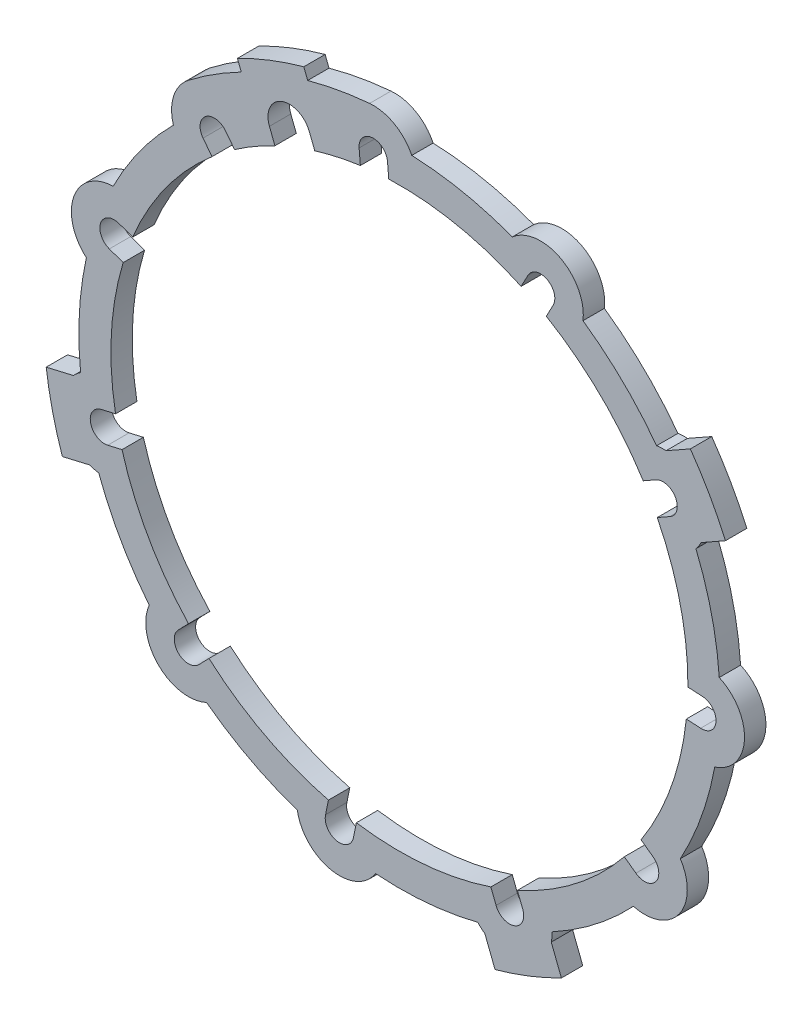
ISO-10303-21;
HEADER;
FILE_DESCRIPTION(('STEP AP214'),'2;1');
FILE_NAME('part.step','',(''),(''),'','','');
FILE_SCHEMA(('AUTOMOTIVE_DESIGN { 1 0 10303 214 1 1 1 1 }'));
ENDSEC;
DATA;
#1=APPLICATION_CONTEXT('core data for automotive mechanical design processes');
#2=APPLICATION_PROTOCOL_DEFINITION('international standard','automotive_design',2000,#1);
#3=PRODUCT_CONTEXT('',#1,'mechanical');
#4=PRODUCT('Part','Part','',(#3));
#5=PRODUCT_RELATED_PRODUCT_CATEGORY('part','',(#4));
#6=PRODUCT_DEFINITION_FORMATION('','',#4);
#7=PRODUCT_DEFINITION_CONTEXT('part definition',#1,'design');
#8=PRODUCT_DEFINITION('design','',#6,#7);
#9=PRODUCT_DEFINITION_SHAPE('','',#8);
#10=(LENGTH_UNIT() NAMED_UNIT(*) SI_UNIT(.MILLI.,.METRE.));
#11=(NAMED_UNIT(*) PLANE_ANGLE_UNIT() SI_UNIT($,.RADIAN.));
#12=(NAMED_UNIT(*) SI_UNIT($,.STERADIAN.) SOLID_ANGLE_UNIT());
#13=UNCERTAINTY_MEASURE_WITH_UNIT(LENGTH_MEASURE(1.E-05),#10,'distance_accuracy_value','');
#14=(GEOMETRIC_REPRESENTATION_CONTEXT(3) GLOBAL_UNCERTAINTY_ASSIGNED_CONTEXT((#13)) GLOBAL_UNIT_ASSIGNED_CONTEXT((#10,
#11,#12)) REPRESENTATION_CONTEXT('',''));
#15=CARTESIAN_POINT('',(0.,0.,0.));
#16=DIRECTION('',(0.,0.,1.));
#17=DIRECTION('',(1.,0.,0.));
#18=AXIS2_PLACEMENT_3D('',#15,#16,#17);
#19=CARTESIAN_POINT('',(15.4497713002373,-39.6043246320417,-3.));
#20=DIRECTION('',(0.,0.,1.));
#21=DIRECTION('',(1.,0.,0.));
#22=AXIS2_PLACEMENT_3D('',#19,#20,#21);
#23=CYLINDRICAL_SURFACE('',#22,6.00000000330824);
#24=DIRECTION('',(0.,0.,-1.));
#25=VECTOR('',#24,1.);
#26=CARTESIAN_POINT('',(11.9970177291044,-44.5113087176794,13.5128805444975));
#27=LINE('',#26,#25);
#28=CARTESIAN_POINT('',(11.9970177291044,-44.5113087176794,0.));
#29=VERTEX_POINT('',#28);
#30=CARTESIAN_POINT('',(11.9970177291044,-44.5113087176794,-3.));
#31=VERTEX_POINT('',#30);
#32=EDGE_CURVE('E908',#29,#31,#27,.T.);
#33=ORIENTED_EDGE('',*,*,#32,.F.);
#34=CARTESIAN_POINT('',(15.4497713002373,-39.6043246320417,0.));
#35=DIRECTION('',(0.,0.,1.));
#36=DIRECTION('',(1.,0.,0.));
#37=AXIS2_PLACEMENT_3D('',#34,#35,#36);
#38=CIRCLE('',#37,6.00000000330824);
#39=CARTESIAN_POINT('',(11.0041717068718,-43.6337965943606,0.));
#40=VERTEX_POINT('',#39);
#41=EDGE_CURVE('E919',#40,#29,#38,.T.);
#42=ORIENTED_EDGE('',*,*,#41,.F.);
#43=DIRECTION('',(0.,0.,1.));
#44=VECTOR('',#43,1.);
#45=CARTESIAN_POINT('',(11.0041717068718,-43.6337965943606,-3.));
#46=LINE('',#45,#44);
#47=CARTESIAN_POINT('',(11.0041717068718,-43.6337965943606,-3.));
#48=VERTEX_POINT('',#47);
#49=EDGE_CURVE('E1054',#48,#40,#46,.T.);
#50=ORIENTED_EDGE('',*,*,#49,.F.);
#51=CARTESIAN_POINT('',(15.4497713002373,-39.6043246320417,-3.));
#52=DIRECTION('',(0.,0.,1.));
#53=DIRECTION('',(1.,0.,0.));
#54=AXIS2_PLACEMENT_3D('',#51,#52,#53);
#55=CIRCLE('',#54,6.00000000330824);
#56=EDGE_CURVE('E922',#48,#31,#55,.T.);
#57=ORIENTED_EDGE('',*,*,#56,.T.);
#58=EDGE_LOOP('',(#33,#42,#50,#57));
#59=FACE_BOUND('',#58,.T.);
#60=ADVANCED_FACE('F369',(#59),#23,.T.);
#61=CARTESIAN_POINT('',(0.,0.,-3.));
#62=DIRECTION('',(0.,0.,1.));
#63=DIRECTION('',(1.,0.,0.));
#64=AXIS2_PLACEMENT_3D('',#61,#62,#63);
#65=CYLINDRICAL_SURFACE('',#64,48.5111510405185);
#66=DIRECTION('',(0.,0.,-1.));
#67=VECTOR('',#66,1.);
#68=CARTESIAN_POINT('',(-22.1945577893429,43.1362188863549,13.5128805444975));
#69=LINE('',#68,#67);
#70=CARTESIAN_POINT('',(-22.1945577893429,43.1362188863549,0.));
#71=VERTEX_POINT('',#70);
#72=CARTESIAN_POINT('',(-22.1945577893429,43.1362188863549,-3.));
#73=VERTEX_POINT('',#72);
#74=EDGE_CURVE('E394',#71,#73,#69,.T.);
#75=ORIENTED_EDGE('',*,*,#74,.T.);
#76=CARTESIAN_POINT('',(0.,0.,-3.));
#77=DIRECTION('',(0.,0.,1.));
#78=DIRECTION('',(1.,0.,0.));
#79=AXIS2_PLACEMENT_3D('',#76,#77,#78);
#80=CIRCLE('',#79,48.5111510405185);
#81=CARTESIAN_POINT('',(-29.648827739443,38.3963382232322,-3.));
#82=VERTEX_POINT('',#81);
#83=EDGE_CURVE('E965',#73,#82,#80,.T.);
#84=ORIENTED_EDGE('',*,*,#83,.T.);
#85=DIRECTION('',(0.,0.,1.));
#86=VECTOR('',#85,1.);
#87=CARTESIAN_POINT('',(-29.648827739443,38.3963382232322,-3.));
#88=LINE('',#87,#86);
#89=CARTESIAN_POINT('',(-29.648827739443,38.3963382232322,0.));
#90=VERTEX_POINT('',#89);
#91=EDGE_CURVE('E373',#82,#90,#88,.T.);
#92=ORIENTED_EDGE('',*,*,#91,.T.);
#93=CARTESIAN_POINT('',(0.,0.,0.));
#94=DIRECTION('',(0.,0.,1.));
#95=DIRECTION('',(1.,0.,0.));
#96=AXIS2_PLACEMENT_3D('',#93,#94,#95);
#97=CIRCLE('',#96,48.5111510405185);
#98=EDGE_CURVE('E1081',#71,#90,#97,.T.);
#99=ORIENTED_EDGE('',*,*,#98,.F.);
#100=EDGE_LOOP('',(#75,#84,#92,#99));
#101=FACE_BOUND('',#100,.T.);
#102=ADVANCED_FACE('F1080',(#101),#65,.T.);
#103=CARTESIAN_POINT('',(-41.3999414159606,-9.6562318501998,-3.));
#104=DIRECTION('',(0.,0.,1.));
#105=DIRECTION('',(1.,0.,0.));
#106=AXIS2_PLACEMENT_3D('',#103,#104,#105);
#107=CYLINDRICAL_SURFACE('',#106,6.00000000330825);
#108=DIRECTION('',(0.,0.,-1.));
#109=VECTOR('',#108,1.);
#110=CARTESIAN_POINT('',(-43.4941428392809,-15.278893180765,13.5128805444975));
#111=LINE('',#110,#109);
#112=CARTESIAN_POINT('',(-43.4941428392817,-15.2788931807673,0.));
#113=VERTEX_POINT('',#112);
#114=CARTESIAN_POINT('',(-43.4941428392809,-15.278893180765,-3.));
#115=VERTEX_POINT('',#114);
#116=EDGE_CURVE('E1186',#113,#115,#111,.T.);
#117=ORIENTED_EDGE('',*,*,#116,.T.);
#118=CARTESIAN_POINT('',(-41.3999414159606,-9.6562318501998,-3.));
#119=DIRECTION('',(0.,0.,1.));
#120=DIRECTION('',(1.,0.,0.));
#121=AXIS2_PLACEMENT_3D('',#118,#119,#120);
#122=CIRCLE('',#121,6.00000000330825);
#123=CARTESIAN_POINT('',(-42.2089449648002,-15.6014411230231,-3.));
#124=VERTEX_POINT('',#123);
#125=EDGE_CURVE('E981',#115,#124,#122,.T.);
#126=ORIENTED_EDGE('',*,*,#125,.T.);
#127=DIRECTION('',(0.,0.,1.));
#128=VECTOR('',#127,1.);
#129=CARTESIAN_POINT('',(-42.2089449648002,-15.6014411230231,-3.));
#130=LINE('',#129,#128);
#131=CARTESIAN_POINT('',(-42.2089449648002,-15.6014411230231,0.));
#132=VERTEX_POINT('',#131);
#133=EDGE_CURVE('E1064',#124,#132,#130,.T.);
#134=ORIENTED_EDGE('',*,*,#133,.T.);
#135=CARTESIAN_POINT('',(-41.3999414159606,-9.6562318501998,0.));
#136=DIRECTION('',(0.,0.,1.));
#137=DIRECTION('',(1.,0.,0.));
#138=AXIS2_PLACEMENT_3D('',#135,#136,#137);
#139=CIRCLE('',#138,6.00000000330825);
#140=EDGE_CURVE('E1101',#113,#132,#139,.T.);
#141=ORIENTED_EDGE('',*,*,#140,.F.);
#142=EDGE_LOOP('',(#117,#126,#134,#141));
#143=FACE_BOUND('',#142,.T.);
#144=ADVANCED_FACE('F1808',(#143),#107,.T.);
#145=CARTESIAN_POINT('',(37.0024780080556,20.9287979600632,-3.));
#146=DIRECTION('',(0.,0.,1.));
#147=DIRECTION('',(1.,0.,0.));
#148=AXIS2_PLACEMENT_3D('',#145,#146,#147);
#149=CYLINDRICAL_SURFACE('',#148,6.00000000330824);
#150=DIRECTION('',(0.,0.,-1.));
#151=VECTOR('',#150,1.);
#152=CARTESIAN_POINT('',(37.4277628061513,26.9137067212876,13.5128805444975));
#153=LINE('',#152,#151);
#154=CARTESIAN_POINT('',(37.4277628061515,26.9137067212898,0.));
#155=VERTEX_POINT('',#154);
#156=CARTESIAN_POINT('',(37.4277628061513,26.9137067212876,-3.));
#157=VERTEX_POINT('',#156);
#158=EDGE_CURVE('E1212',#155,#157,#153,.T.);
#159=ORIENTED_EDGE('',*,*,#158,.T.);
#160=CARTESIAN_POINT('',(37.0024780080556,20.9287979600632,-3.));
#161=DIRECTION('',(0.,0.,1.));
#162=DIRECTION('',(1.,0.,0.));
#163=AXIS2_PLACEMENT_3D('',#160,#161,#162);
#164=CIRCLE('',#163,6.00000000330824);
#165=CARTESIAN_POINT('',(36.1037522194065,26.8611071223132,-3.));
#166=VERTEX_POINT('',#165);
#167=EDGE_CURVE('E1017',#157,#166,#164,.T.);
#168=ORIENTED_EDGE('',*,*,#167,.T.);
#169=DIRECTION('',(0.,0.,1.));
#170=VECTOR('',#169,1.);
#171=CARTESIAN_POINT('',(36.1037522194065,26.8611071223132,-3.));
#172=LINE('',#171,#170);
#173=CARTESIAN_POINT('',(36.1037522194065,26.8611071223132,0.));
#174=VERTEX_POINT('',#173);
#175=EDGE_CURVE('E1038',#166,#174,#172,.T.);
#176=ORIENTED_EDGE('',*,*,#175,.T.);
#177=CARTESIAN_POINT('',(37.0024780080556,20.9287979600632,0.));
#178=DIRECTION('',(0.,0.,1.));
#179=DIRECTION('',(1.,0.,0.));
#180=AXIS2_PLACEMENT_3D('',#177,#178,#179);
#181=CIRCLE('',#180,6.00000000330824);
#182=EDGE_CURVE('E949',#155,#174,#181,.T.);
#183=ORIENTED_EDGE('',*,*,#182,.F.);
#184=EDGE_LOOP('',(#159,#168,#176,#183));
#185=FACE_BOUND('',#184,.T.);
#186=ADVANCED_FACE('F1985',(#185),#149,.T.);
#187=DIRECTION('',(0.,0.,-1.));
#188=VECTOR('',#187,1.);
#189=CARTESIAN_POINT('',(-12.8783375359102,46.7705056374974,13.5128805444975));
#190=LINE('',#189,#188);
#191=CARTESIAN_POINT('',(-12.8783375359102,46.7705056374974,0.));
#192=VERTEX_POINT('',#191);
#193=CARTESIAN_POINT('',(-12.8783375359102,46.7705056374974,-3.));
#194=VERTEX_POINT('',#193);
#195=EDGE_CURVE('E1156',#192,#194,#190,.T.);
#196=ORIENTED_EDGE('',*,*,#195,.F.);
#197=CARTESIAN_POINT('',(-4.18355277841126,48.3304216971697,0.));
#198=VERTEX_POINT('',#197);
#199=EDGE_CURVE('E1089',#198,#192,#97,.T.);
#200=ORIENTED_EDGE('',*,*,#199,.F.);
#201=DIRECTION('',(0.,0.,1.));
#202=VECTOR('',#201,1.);
#203=CARTESIAN_POINT('',(-4.18355277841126,48.3304216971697,-3.));
#204=LINE('',#203,#202);
#205=CARTESIAN_POINT('',(-4.18355277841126,48.3304216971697,-3.));
#206=VERTEX_POINT('',#205);
#207=EDGE_CURVE('E11',#206,#198,#204,.T.);
#208=ORIENTED_EDGE('',*,*,#207,.F.);
#209=EDGE_CURVE('E966',#206,#194,#80,.T.);
#210=ORIENTED_EDGE('',*,*,#209,.T.);
#211=EDGE_LOOP('',(#196,#200,#208,#210));
#212=FACE_BOUND('',#211,.T.);
#213=ADVANCED_FACE('F371',(#212),#65,.T.);
#214=CARTESIAN_POINT('',(-3.66611936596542,42.3527747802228,-3.));
#215=DIRECTION('',(0.,0.,1.));
#216=DIRECTION('',(1.,0.,0.));
#217=AXIS2_PLACEMENT_3D('',#214,#215,#216);
#218=CYLINDRICAL_SURFACE('',#217,6.);
#219=CARTESIAN_POINT('',(-3.66611936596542,42.3527747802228,0.));
#220=DIRECTION('',(0.,0.,1.));
#221=DIRECTION('',(1.,0.,0.));
#222=AXIS2_PLACEMENT_3D('',#219,#220,#221);
#223=CIRCLE('',#222,6.);
#224=CARTESIAN_POINT('',(1.73463564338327,44.9665546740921,0.));
#225=VERTEX_POINT('',#224);
#226=EDGE_CURVE('E962',#225,#198,#223,.T.);
#227=ORIENTED_EDGE('',*,*,#226,.F.);
#228=DIRECTION('',(0.,0.,1.));
#229=VECTOR('',#228,1.);
#230=CARTESIAN_POINT('',(1.73463564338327,44.9665546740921,-3.));
#231=LINE('',#230,#229);
#232=CARTESIAN_POINT('',(1.73463564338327,44.9665546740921,-3.));
#233=VERTEX_POINT('',#232);
#234=EDGE_CURVE('E378',#233,#225,#231,.T.);
#235=ORIENTED_EDGE('',*,*,#234,.F.);
#236=CARTESIAN_POINT('',(-3.66611936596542,42.3527747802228,-3.));
#237=DIRECTION('',(0.,0.,1.));
#238=DIRECTION('',(1.,0.,0.));
#239=AXIS2_PLACEMENT_3D('',#236,#237,#238);
#240=CIRCLE('',#239,6.);
#241=EDGE_CURVE('E1030',#233,#206,#240,.T.);
#242=ORIENTED_EDGE('',*,*,#241,.T.);
#243=ORIENTED_EDGE('',*,*,#207,.T.);
#244=EDGE_LOOP('',(#227,#235,#242,#243));
#245=FACE_BOUND('',#244,.T.);
#246=ADVANCED_FACE('F2365',(#245),#218,.T.);
#247=CARTESIAN_POINT('',(0.,0.,-3.));
#248=DIRECTION('',(0.,0.,1.));
#249=DIRECTION('',(1.,0.,0.));
#250=AXIS2_PLACEMENT_3D('',#247,#248,#249);
#251=CYLINDRICAL_SURFACE('',#250,45.0000000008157);
#252=CARTESIAN_POINT('',(0.,0.,0.));
#253=DIRECTION('',(0.,0.,1.));
#254=DIRECTION('',(1.,0.,0.));
#255=AXIS2_PLACEMENT_3D('',#252,#253,#254);
#256=CIRCLE('',#255,45.0000000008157);
#257=CARTESIAN_POINT('',(15.8501981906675,42.1161633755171,0.));
#258=VERTEX_POINT('',#257);
#259=EDGE_CURVE('E959',#258,#225,#256,.T.);
#260=ORIENTED_EDGE('',*,*,#259,.F.);
#261=DIRECTION('',(0.,0.,1.));
#262=VECTOR('',#261,1.);
#263=CARTESIAN_POINT('',(15.8501981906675,42.1161633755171,-3.));
#264=LINE('',#263,#262);
#265=CARTESIAN_POINT('',(15.8501981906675,42.1161633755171,-3.));
#266=VERTEX_POINT('',#265);
#267=EDGE_CURVE('E1034',#266,#258,#264,.T.);
#268=ORIENTED_EDGE('',*,*,#267,.F.);
#269=CARTESIAN_POINT('',(0.,0.,-3.));
#270=DIRECTION('',(0.,0.,1.));
#271=DIRECTION('',(1.,0.,0.));
#272=AXIS2_PLACEMENT_3D('',#269,#270,#271);
#273=CIRCLE('',#272,45.0000000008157);
#274=EDGE_CURVE('E1027',#266,#233,#273,.T.);
#275=ORIENTED_EDGE('',*,*,#274,.T.);
#276=ORIENTED_EDGE('',*,*,#234,.T.);
#277=EDGE_LOOP('',(#260,#268,#275,#276));
#278=FACE_BOUND('',#277,.T.);
#279=ADVANCED_FACE('F2357',(#278),#251,.T.);
#280=CARTESIAN_POINT('',(19.8135029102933,37.6114751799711,-3.));
#281=DIRECTION('',(0.,0.,1.));
#282=DIRECTION('',(1.,0.,0.));
#283=AXIS2_PLACEMENT_3D('',#280,#281,#282);
#284=CYLINDRICAL_SURFACE('',#283,6.00000000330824);
#285=CARTESIAN_POINT('',(19.8135029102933,37.6114751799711,0.));
#286=DIRECTION('',(0.,0.,1.));
#287=DIRECTION('',(1.,0.,0.));
#288=AXIS2_PLACEMENT_3D('',#285,#286,#287);
#289=CIRCLE('',#288,6.00000000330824);
#290=CARTESIAN_POINT('',(25.7700232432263,36.8904581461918,0.));
#291=VERTEX_POINT('',#290);
#292=EDGE_CURVE('E956',#291,#258,#289,.T.);
#293=ORIENTED_EDGE('',*,*,#292,.F.);
#294=DIRECTION('',(0.,0.,1.));
#295=VECTOR('',#294,1.);
#296=CARTESIAN_POINT('',(25.7700232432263,36.8904581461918,-3.));
#297=LINE('',#296,#295);
#298=CARTESIAN_POINT('',(25.7700232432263,36.8904581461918,-3.));
#299=VERTEX_POINT('',#298);
#300=EDGE_CURVE('E1036',#299,#291,#297,.T.);
#301=ORIENTED_EDGE('',*,*,#300,.F.);
#302=CARTESIAN_POINT('',(19.8135029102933,37.6114751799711,-3.));
#303=DIRECTION('',(0.,0.,1.));
#304=DIRECTION('',(1.,0.,0.));
#305=AXIS2_PLACEMENT_3D('',#302,#303,#304);
#306=CIRCLE('',#305,6.00000000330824);
#307=EDGE_CURVE('E1024',#299,#266,#306,.T.);
#308=ORIENTED_EDGE('',*,*,#307,.T.);
#309=ORIENTED_EDGE('',*,*,#267,.T.);
#310=EDGE_LOOP('',(#293,#301,#308,#309));
#311=FACE_BOUND('',#310,.T.);
#312=ADVANCED_FACE('F2349',(#311),#284,.T.);
#313=CARTESIAN_POINT('',(0.,0.,-3.));
#314=DIRECTION('',(0.,0.,1.));
#315=DIRECTION('',(1.,0.,0.));
#316=AXIS2_PLACEMENT_3D('',#313,#314,#315);
#317=CYLINDRICAL_SURFACE('',#316,45.0000000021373);
#318=CARTESIAN_POINT('',(0.,0.,0.));
#319=DIRECTION('',(0.,0.,1.));
#320=DIRECTION('',(1.,0.,0.));
#321=AXIS2_PLACEMENT_3D('',#318,#319,#320);
#322=CIRCLE('',#321,45.0000000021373);
#323=EDGE_CURVE('E953',#174,#291,#322,.T.);
#324=ORIENTED_EDGE('',*,*,#323,.F.);
#325=ORIENTED_EDGE('',*,*,#175,.F.);
#326=CARTESIAN_POINT('',(0.,0.,-3.));
#327=DIRECTION('',(0.,0.,1.));
#328=DIRECTION('',(1.,0.,0.));
#329=AXIS2_PLACEMENT_3D('',#326,#327,#328);
#330=CIRCLE('',#329,45.0000000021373);
#331=EDGE_CURVE('E1021',#166,#299,#330,.T.);
#332=ORIENTED_EDGE('',*,*,#331,.T.);
#333=ORIENTED_EDGE('',*,*,#300,.T.);
#334=EDGE_LOOP('',(#324,#325,#332,#333));
#335=FACE_BOUND('',#334,.T.);
#336=ADVANCED_FACE('F2345',(#335),#317,.T.);
#337=DIRECTION('',(0.,0.,-1.));
#338=VECTOR('',#337,1.);
#339=CARTESIAN_POINT('',(42.3508941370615,18.209525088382,13.5128805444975));
#340=LINE('',#339,#338);
#341=CARTESIAN_POINT('',(42.3508941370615,18.209525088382,0.));
#342=VERTEX_POINT('',#341);
#343=CARTESIAN_POINT('',(42.3508941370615,18.209525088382,-3.));
#344=VERTEX_POINT('',#343);
#345=EDGE_CURVE('E1206',#342,#344,#340,.T.);
#346=ORIENTED_EDGE('',*,*,#345,.F.);
#347=CARTESIAN_POINT('',(41.6236105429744,17.1019018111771,0.));
#348=VERTEX_POINT('',#347);
#349=EDGE_CURVE('E950',#348,#342,#181,.T.);
#350=ORIENTED_EDGE('',*,*,#349,.F.);
#351=DIRECTION('',(0.,0.,1.));
#352=VECTOR('',#351,1.);
#353=CARTESIAN_POINT('',(41.6236105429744,17.1019018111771,-3.));
#354=LINE('',#353,#352);
#355=CARTESIAN_POINT('',(41.6236105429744,17.1019018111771,-3.));
#356=VERTEX_POINT('',#355);
#357=EDGE_CURVE('E1041',#356,#348,#354,.T.);
#358=ORIENTED_EDGE('',*,*,#357,.F.);
#359=EDGE_CURVE('E1018',#356,#344,#164,.T.);
#360=ORIENTED_EDGE('',*,*,#359,.T.);
#361=EDGE_LOOP('',(#346,#350,#358,#360));
#362=FACE_BOUND('',#361,.T.);
#363=ADVANCED_FACE('F1992',(#362),#149,.T.);
#364=CARTESIAN_POINT('',(0.,0.,-3.));
#365=DIRECTION('',(0.,0.,1.));
#366=DIRECTION('',(1.,0.,0.));
#367=AXIS2_PLACEMENT_3D('',#364,#365,#366);
#368=CYLINDRICAL_SURFACE('',#367,45.0000000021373);
#369=CARTESIAN_POINT('',(0.,0.,0.));
#370=DIRECTION('',(0.,0.,1.));
#371=DIRECTION('',(1.,0.,0.));
#372=AXIS2_PLACEMENT_3D('',#369,#370,#371);
#373=CIRCLE('',#372,45.0000000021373);
#374=CARTESIAN_POINT('',(44.8946200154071,3.07783914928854,0.));
#375=VERTEX_POINT('',#374);
#376=EDGE_CURVE('E946',#375,#348,#373,.T.);
#377=ORIENTED_EDGE('',*,*,#376,.F.);
#378=DIRECTION('',(0.,0.,1.));
#379=VECTOR('',#378,1.);
#380=CARTESIAN_POINT('',(44.8946200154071,3.07783914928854,-3.));
#381=LINE('',#380,#379);
#382=CARTESIAN_POINT('',(44.8946200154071,3.07783914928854,-3.));
#383=VERTEX_POINT('',#382);
#384=EDGE_CURVE('E1043',#383,#375,#381,.T.);
#385=ORIENTED_EDGE('',*,*,#384,.F.);
#386=CARTESIAN_POINT('',(0.,0.,-3.));
#387=DIRECTION('',(0.,0.,1.));
#388=DIRECTION('',(1.,0.,0.));
#389=AXIS2_PLACEMENT_3D('',#386,#387,#388);
#390=CIRCLE('',#389,45.0000000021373);
#391=EDGE_CURVE('E1014',#383,#356,#390,.T.);
#392=ORIENTED_EDGE('',*,*,#391,.T.);
#393=ORIENTED_EDGE('',*,*,#357,.T.);
#394=EDGE_LOOP('',(#377,#385,#392,#393));
#395=FACE_BOUND('',#394,.T.);
#396=ADVANCED_FACE('F2332',(#395),#368,.T.);
#397=CARTESIAN_POINT('',(42.4434277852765,-2.39862473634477,-3.));
#398=DIRECTION('',(0.,0.,1.));
#399=DIRECTION('',(1.,0.,0.));
#400=AXIS2_PLACEMENT_3D('',#397,#398,#399);
#401=CYLINDRICAL_SURFACE('',#400,6.00000000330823);
#402=CARTESIAN_POINT('',(42.4434277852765,-2.39862473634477,0.));
#403=DIRECTION('',(0.,0.,1.));
#404=DIRECTION('',(1.,0.,0.));
#405=AXIS2_PLACEMENT_3D('',#402,#403,#404);
#406=CIRCLE('',#405,6.00000000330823);
#407=CARTESIAN_POINT('',(44.2619955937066,-8.11638751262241,0.));
#408=VERTEX_POINT('',#407);
#409=EDGE_CURVE('E943',#408,#375,#406,.T.);
#410=ORIENTED_EDGE('',*,*,#409,.F.);
#411=DIRECTION('',(0.,0.,1.));
#412=VECTOR('',#411,1.);
#413=CARTESIAN_POINT('',(44.2619955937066,-8.11638751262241,-3.));
#414=LINE('',#413,#412);
#415=CARTESIAN_POINT('',(44.2619955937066,-8.11638751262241,-3.));
#416=VERTEX_POINT('',#415);
#417=EDGE_CURVE('E1045',#416,#408,#414,.T.);
#418=ORIENTED_EDGE('',*,*,#417,.F.);
#419=CARTESIAN_POINT('',(42.4434277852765,-2.39862473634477,-3.));
#420=DIRECTION('',(0.,0.,1.));
#421=DIRECTION('',(1.,0.,0.));
#422=AXIS2_PLACEMENT_3D('',#419,#420,#421);
#423=CIRCLE('',#422,6.00000000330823);
#424=EDGE_CURVE('E1011',#416,#383,#423,.T.);
#425=ORIENTED_EDGE('',*,*,#424,.T.);
#426=ORIENTED_EDGE('',*,*,#384,.T.);
#427=EDGE_LOOP('',(#410,#418,#425,#426));
#428=FACE_BOUND('',#427,.T.);
#429=ADVANCED_FACE('F2324',(#428),#401,.T.);
#430=CARTESIAN_POINT('',(0.,0.,-3.));
#431=DIRECTION('',(0.,0.,1.));
#432=DIRECTION('',(1.,0.,0.));
#433=AXIS2_PLACEMENT_3D('',#430,#431,#432);
#434=CYLINDRICAL_SURFACE('',#433,45.0000000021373);
#435=CARTESIAN_POINT('',(0.,0.,0.));
#436=DIRECTION('',(0.,0.,1.));
#437=DIRECTION('',(1.,0.,0.));
#438=AXIS2_PLACEMENT_3D('',#435,#436,#437);
#439=CIRCLE('',#438,45.0000000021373);
#440=CARTESIAN_POINT('',(39.4317631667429,-21.682621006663,0.));
#441=VERTEX_POINT('',#440);
#442=EDGE_CURVE('E940',#441,#408,#439,.T.);
#443=ORIENTED_EDGE('',*,*,#442,.F.);
#444=DIRECTION('',(0.,0.,1.));
#445=VECTOR('',#444,1.);
#446=CARTESIAN_POINT('',(39.4317631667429,-21.682621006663,-3.));
#447=LINE('',#446,#445);
#448=CARTESIAN_POINT('',(39.4317631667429,-21.682621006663,-3.));
#449=VERTEX_POINT('',#448);
#450=EDGE_CURVE('E1047',#449,#441,#447,.T.);
#451=ORIENTED_EDGE('',*,*,#450,.F.);
#452=CARTESIAN_POINT('',(0.,0.,-3.));
#453=DIRECTION('',(0.,0.,1.));
#454=DIRECTION('',(1.,0.,0.));
#455=AXIS2_PLACEMENT_3D('',#452,#453,#454);
#456=CIRCLE('',#455,45.0000000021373);
#457=EDGE_CURVE('E1008',#449,#416,#456,.T.);
#458=ORIENTED_EDGE('',*,*,#457,.T.);
#459=ORIENTED_EDGE('',*,*,#417,.T.);
#460=EDGE_LOOP('',(#443,#451,#458,#459));
#461=FACE_BOUND('',#460,.T.);
#462=ADVANCED_FACE('F2316',(#461),#434,.T.);
#463=CARTESIAN_POINT('',(34.4088891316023,-24.9645010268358,-3.));
#464=DIRECTION('',(0.,0.,1.));
#465=DIRECTION('',(1.,0.,0.));
#466=AXIS2_PLACEMENT_3D('',#463,#464,#465);
#467=CYLINDRICAL_SURFACE('',#466,6.00000000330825);
#468=CARTESIAN_POINT('',(34.4088891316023,-24.9645010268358,0.));
#469=DIRECTION('',(0.,0.,1.));
#470=DIRECTION('',(1.,0.,0.));
#471=AXIS2_PLACEMENT_3D('',#468,#469,#470);
#472=CIRCLE('',#471,6.00000000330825);
#473=CARTESIAN_POINT('',(32.8475097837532,-30.7577811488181,0.));
#474=VERTEX_POINT('',#473);
#475=EDGE_CURVE('E933',#474,#441,#472,.T.);
#476=ORIENTED_EDGE('',*,*,#475,.F.);
#477=DIRECTION('',(0.,0.,1.));
#478=VECTOR('',#477,1.);
#479=CARTESIAN_POINT('',(32.8475097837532,-30.7577811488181,-3.));
#480=LINE('',#479,#478);
#481=CARTESIAN_POINT('',(32.8475097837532,-30.7577811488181,-3.));
#482=VERTEX_POINT('',#481);
#483=EDGE_CURVE('E1049',#482,#474,#480,.T.);
#484=ORIENTED_EDGE('',*,*,#483,.F.);
#485=CARTESIAN_POINT('',(34.4088891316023,-24.9645010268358,-3.));
#486=DIRECTION('',(0.,0.,1.));
#487=DIRECTION('',(1.,0.,0.));
#488=AXIS2_PLACEMENT_3D('',#485,#486,#487);
#489=CIRCLE('',#488,6.00000000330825);
#490=EDGE_CURVE('E1005',#482,#449,#489,.T.);
#491=ORIENTED_EDGE('',*,*,#490,.T.);
#492=ORIENTED_EDGE('',*,*,#450,.T.);
#493=EDGE_LOOP('',(#476,#484,#491,#492));
#494=FACE_BOUND('',#493,.T.);
#495=ADVANCED_FACE('F1820',(#494),#467,.T.);
#496=CARTESIAN_POINT('',(0.,0.,-3.));
#497=DIRECTION('',(0.,0.,1.));
#498=DIRECTION('',(1.,0.,0.));
#499=AXIS2_PLACEMENT_3D('',#496,#497,#498);
#500=CYLINDRICAL_SURFACE('',#499,45.0000000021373);
#501=CARTESIAN_POINT('',(0.,0.,0.));
#502=DIRECTION('',(0.,0.,1.));
#503=DIRECTION('',(1.,0.,0.));
#504=AXIS2_PLACEMENT_3D('',#501,#502,#503);
#505=CIRCLE('',#504,45.0000000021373);
#506=CARTESIAN_POINT('',(21.4496001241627,-39.5590021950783,0.));
#507=VERTEX_POINT('',#506);
#508=EDGE_CURVE('E929',#507,#474,#505,.T.);
#509=ORIENTED_EDGE('',*,*,#508,.F.);
#510=DIRECTION('',(0.,0.,1.));
#511=VECTOR('',#510,1.);
#512=CARTESIAN_POINT('',(21.4496001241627,-39.5590021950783,-3.));
#513=LINE('',#512,#511);
#514=CARTESIAN_POINT('',(21.4496001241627,-39.5590021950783,-3.));
#515=VERTEX_POINT('',#514);
#516=EDGE_CURVE('E1051',#515,#507,#513,.T.);
#517=ORIENTED_EDGE('',*,*,#516,.F.);
#518=CARTESIAN_POINT('',(0.,0.,-3.));
#519=DIRECTION('',(0.,0.,1.));
#520=DIRECTION('',(1.,0.,0.));
#521=AXIS2_PLACEMENT_3D('',#518,#519,#520);
#522=CIRCLE('',#521,45.0000000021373);
#523=EDGE_CURVE('E1002',#515,#482,#522,.T.);
#524=ORIENTED_EDGE('',*,*,#523,.T.);
#525=ORIENTED_EDGE('',*,*,#483,.T.);
#526=EDGE_LOOP('',(#509,#517,#524,#525));
#527=FACE_BOUND('',#526,.T.);
#528=ADVANCED_FACE('F1812',(#527),#500,.T.);
#529=DIRECTION('',(0.,0.,-1.));
#530=VECTOR('',#529,1.);
#531=CARTESIAN_POINT('',(21.3132379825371,-40.8770219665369,13.5128805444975));
#532=LINE('',#531,#530);
#533=CARTESIAN_POINT('',(21.3132379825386,-40.8770219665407,0.));
#534=VERTEX_POINT('',#533);
#535=CARTESIAN_POINT('',(21.3132379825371,-40.8770219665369,-3.));
#536=VERTEX_POINT('',#535);
#537=EDGE_CURVE('E386',#534,#536,#532,.T.);
#538=ORIENTED_EDGE('',*,*,#537,.T.);
#539=EDGE_CURVE('E1000',#536,#515,#55,.T.);
#540=ORIENTED_EDGE('',*,*,#539,.T.);
#541=ORIENTED_EDGE('',*,*,#516,.T.);
#542=EDGE_CURVE('E930',#534,#507,#38,.T.);
#543=ORIENTED_EDGE('',*,*,#542,.F.);
#544=EDGE_LOOP('',(#538,#540,#541,#543));
#545=FACE_BOUND('',#544,.T.);
#546=ADVANCED_FACE('F1803',(#545),#23,.T.);
#547=CARTESIAN_POINT('',(0.,0.,-3.));
#548=DIRECTION('',(0.,0.,1.));
#549=DIRECTION('',(1.,0.,0.));
#550=AXIS2_PLACEMENT_3D('',#547,#548,#549);
#551=CYLINDRICAL_SURFACE('',#550,45.0000000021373);
#552=CARTESIAN_POINT('',(0.,0.,0.));
#553=DIRECTION('',(0.,0.,1.));
#554=DIRECTION('',(1.,0.,0.));
#555=AXIS2_PLACEMENT_3D('',#552,#553,#554);
#556=CIRCLE('',#555,45.0000000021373);
#557=CARTESIAN_POINT('',(-3.34265940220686,-44.8756796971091,0.));
#558=VERTEX_POINT('',#557);
#559=EDGE_CURVE('E928',#558,#40,#556,.T.);
#560=ORIENTED_EDGE('',*,*,#559,.F.);
#561=DIRECTION('',(0.,0.,1.));
#562=VECTOR('',#561,1.);
#563=CARTESIAN_POINT('',(-3.34265940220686,-44.8756796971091,-3.));
#564=LINE('',#563,#562);
#565=CARTESIAN_POINT('',(-3.34265940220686,-44.8756796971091,-3.));
#566=VERTEX_POINT('',#565);
#567=EDGE_CURVE('E1056',#566,#558,#564,.T.);
#568=ORIENTED_EDGE('',*,*,#567,.F.);
#569=CARTESIAN_POINT('',(0.,0.,-3.));
#570=DIRECTION('',(0.,0.,1.));
#571=DIRECTION('',(1.,0.,0.));
#572=AXIS2_PLACEMENT_3D('',#569,#570,#571);
#573=CIRCLE('',#572,45.0000000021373);
#574=EDGE_CURVE('E997',#566,#48,#573,.T.);
#575=ORIENTED_EDGE('',*,*,#574,.T.);
#576=ORIENTED_EDGE('',*,*,#49,.T.);
#577=EDGE_LOOP('',(#560,#568,#575,#576));
#578=FACE_BOUND('',#577,.T.);
#579=ADVANCED_FACE('F1121',(#578),#551,.T.);
#580=CARTESIAN_POINT('',(-8.41453975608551,-41.6700549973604,-3.));
#581=DIRECTION('',(0.,0.,1.));
#582=DIRECTION('',(1.,0.,0.));
#583=AXIS2_PLACEMENT_3D('',#580,#581,#582);
#584=CYLINDRICAL_SURFACE('',#583,6.00000000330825);
#585=CARTESIAN_POINT('',(-8.41453975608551,-41.6700549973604,0.));
#586=DIRECTION('',(0.,0.,1.));
#587=DIRECTION('',(1.,0.,0.));
#588=AXIS2_PLACEMENT_3D('',#585,#586,#587);
#589=CIRCLE('',#588,6.00000000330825);
#590=CARTESIAN_POINT('',(-14.3329131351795,-42.656389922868,0.));
#591=VERTEX_POINT('',#590);
#592=EDGE_CURVE('E1113',#591,#558,#589,.T.);
#593=ORIENTED_EDGE('',*,*,#592,.F.);
#594=DIRECTION('',(0.,0.,1.));
#595=VECTOR('',#594,1.);
#596=CARTESIAN_POINT('',(-14.3329131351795,-42.656389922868,-3.));
#597=LINE('',#596,#595);
#598=CARTESIAN_POINT('',(-14.3329131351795,-42.656389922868,-3.));
#599=VERTEX_POINT('',#598);
#600=EDGE_CURVE('E1058',#599,#591,#597,.T.);
#601=ORIENTED_EDGE('',*,*,#600,.F.);
#602=CARTESIAN_POINT('',(-8.41453975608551,-41.6700549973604,-3.));
#603=DIRECTION('',(0.,0.,1.));
#604=DIRECTION('',(1.,0.,0.));
#605=AXIS2_PLACEMENT_3D('',#602,#603,#604);
#606=CIRCLE('',#605,6.00000000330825);
#607=EDGE_CURVE('E994',#599,#566,#606,.T.);
#608=ORIENTED_EDGE('',*,*,#607,.T.);
#609=ORIENTED_EDGE('',*,*,#567,.T.);
#610=EDGE_LOOP('',(#593,#601,#608,#609));
#611=FACE_BOUND('',#610,.T.);
#612=ADVANCED_FACE('F1117',(#611),#584,.T.);
#613=CARTESIAN_POINT('',(0.,0.,-3.));
#614=DIRECTION('',(0.,0.,1.));
#615=DIRECTION('',(1.,0.,0.));
#616=AXIS2_PLACEMENT_3D('',#613,#614,#615);
#617=CYLINDRICAL_SURFACE('',#616,45.0000000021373);
#618=CARTESIAN_POINT('',(0.,0.,0.));
#619=DIRECTION('',(0.,0.,1.));
#620=DIRECTION('',(1.,0.,0.));
#621=AXIS2_PLACEMENT_3D('',#618,#619,#620);
#622=CIRCLE('',#621,45.0000000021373);
#623=CARTESIAN_POINT('',(-27.0736481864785,-35.9446459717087,0.));
#624=VERTEX_POINT('',#623);
#625=EDGE_CURVE('E1111',#624,#591,#622,.T.);
#626=ORIENTED_EDGE('',*,*,#625,.F.);
#627=DIRECTION('',(0.,0.,1.));
#628=VECTOR('',#627,1.);
#629=CARTESIAN_POINT('',(-27.0736481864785,-35.9446459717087,-3.));
#630=LINE('',#629,#628);
#631=CARTESIAN_POINT('',(-27.0736481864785,-35.9446459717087,-3.));
#632=VERTEX_POINT('',#631);
#633=EDGE_CURVE('E1060',#632,#624,#630,.T.);
#634=ORIENTED_EDGE('',*,*,#633,.F.);
#635=CARTESIAN_POINT('',(0.,0.,-3.));
#636=DIRECTION('',(0.,0.,1.));
#637=DIRECTION('',(1.,0.,0.));
#638=AXIS2_PLACEMENT_3D('',#635,#636,#637);
#639=CIRCLE('',#638,45.0000000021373);
#640=EDGE_CURVE('E991',#632,#599,#639,.T.);
#641=ORIENTED_EDGE('',*,*,#640,.T.);
#642=ORIENTED_EDGE('',*,*,#600,.T.);
#643=EDGE_LOOP('',(#626,#634,#641,#642));
#644=FACE_BOUND('',#643,.T.);
#645=ADVANCED_FACE('F2287',(#644),#617,.T.);
#646=CARTESIAN_POINT('',(-29.607293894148,-30.5058373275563,-3.));
#647=DIRECTION('',(0.,0.,1.));
#648=DIRECTION('',(1.,0.,0.));
#649=AXIS2_PLACEMENT_3D('',#646,#647,#648);
#650=CYLINDRICAL_SURFACE('',#649,6.00000000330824);
#651=CARTESIAN_POINT('',(-29.607293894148,-30.5058373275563,0.));
#652=DIRECTION('',(0.,0.,1.));
#653=DIRECTION('',(1.,0.,0.));
#654=AXIS2_PLACEMENT_3D('',#651,#652,#653);
#655=CIRCLE('',#654,6.00000000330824);
#656=CARTESIAN_POINT('',(-35.1193993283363,-28.1358808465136,0.));
#657=VERTEX_POINT('',#656);
#658=EDGE_CURVE('E1108',#657,#624,#655,.T.);
#659=ORIENTED_EDGE('',*,*,#658,.F.);
#660=DIRECTION('',(0.,0.,1.));
#661=VECTOR('',#660,1.);
#662=CARTESIAN_POINT('',(-35.1193993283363,-28.1358808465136,-3.));
#663=LINE('',#662,#661);
#664=CARTESIAN_POINT('',(-35.1193993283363,-28.1358808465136,-3.));
#665=VERTEX_POINT('',#664);
#666=EDGE_CURVE('E1062',#665,#657,#663,.T.);
#667=ORIENTED_EDGE('',*,*,#666,.F.);
#668=CARTESIAN_POINT('',(-29.607293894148,-30.5058373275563,-3.));
#669=DIRECTION('',(0.,0.,1.));
#670=DIRECTION('',(1.,0.,0.));
#671=AXIS2_PLACEMENT_3D('',#668,#669,#670);
#672=CIRCLE('',#671,6.00000000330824);
#673=EDGE_CURVE('E988',#665,#632,#672,.T.);
#674=ORIENTED_EDGE('',*,*,#673,.T.);
#675=ORIENTED_EDGE('',*,*,#633,.T.);
#676=EDGE_LOOP('',(#659,#667,#674,#675));
#677=FACE_BOUND('',#676,.T.);
#678=ADVANCED_FACE('F2279',(#677),#650,.T.);
#679=CARTESIAN_POINT('',(0.,0.,-3.));
#680=DIRECTION('',(0.,0.,1.));
#681=DIRECTION('',(1.,0.,0.));
#682=AXIS2_PLACEMENT_3D('',#679,#680,#681);
#683=CYLINDRICAL_SURFACE('',#682,45.0000000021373);
#684=CARTESIAN_POINT('',(0.,0.,0.));
#685=DIRECTION('',(0.,0.,1.));
#686=DIRECTION('',(1.,0.,0.));
#687=AXIS2_PLACEMENT_3D('',#684,#685,#686);
#688=CIRCLE('',#687,45.0000000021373);
#689=EDGE_CURVE('E1105',#132,#657,#688,.T.);
#690=ORIENTED_EDGE('',*,*,#689,.F.);
#691=ORIENTED_EDGE('',*,*,#133,.F.);
#692=CARTESIAN_POINT('',(0.,0.,-3.));
#693=DIRECTION('',(0.,0.,1.));
#694=DIRECTION('',(1.,0.,0.));
#695=AXIS2_PLACEMENT_3D('',#692,#693,#694);
#696=CIRCLE('',#695,45.0000000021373);
#697=EDGE_CURVE('E985',#124,#665,#696,.T.);
#698=ORIENTED_EDGE('',*,*,#697,.T.);
#699=ORIENTED_EDGE('',*,*,#666,.T.);
#700=EDGE_LOOP('',(#690,#691,#698,#699));
#701=FACE_BOUND('',#700,.T.);
#702=ADVANCED_FACE('F2275',(#701),#683,.T.);
#703=DIRECTION('',(0.,0.,-1.));
#704=VECTOR('',#703,1.);
#705=CARTESIAN_POINT('',(-45.7656014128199,-5.54028568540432,13.5128805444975));
#706=LINE('',#705,#704);
#707=CARTESIAN_POINT('',(-45.7656014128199,-5.54028568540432,0.));
#708=VERTEX_POINT('',#707);
#709=CARTESIAN_POINT('',(-45.7656014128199,-5.54028568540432,-3.));
#710=VERTEX_POINT('',#709);
#711=EDGE_CURVE('E1180',#708,#710,#706,.T.);
#712=ORIENTED_EDGE('',*,*,#711,.F.);
#713=CARTESIAN_POINT('',(-44.7557243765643,-4.6824284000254,0.));
#714=VERTEX_POINT('',#713);
#715=EDGE_CURVE('E1102',#714,#708,#139,.T.);
#716=ORIENTED_EDGE('',*,*,#715,.F.);
#717=DIRECTION('',(0.,0.,1.));
#718=VECTOR('',#717,1.);
#719=CARTESIAN_POINT('',(-44.7557243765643,-4.6824284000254,-3.));
#720=LINE('',#719,#718);
#721=CARTESIAN_POINT('',(-44.7557243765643,-4.6824284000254,-3.));
#722=VERTEX_POINT('',#721);
#723=EDGE_CURVE('E1067',#722,#714,#720,.T.);
#724=ORIENTED_EDGE('',*,*,#723,.F.);
#725=EDGE_CURVE('E982',#722,#710,#122,.T.);
#726=ORIENTED_EDGE('',*,*,#725,.T.);
#727=EDGE_LOOP('',(#712,#716,#724,#726));
#728=FACE_BOUND('',#727,.T.);
#729=ADVANCED_FACE('F2001',(#728),#107,.T.);
#730=CARTESIAN_POINT('',(0.,0.,-3.));
#731=DIRECTION('',(0.,0.,1.));
#732=DIRECTION('',(1.,0.,0.));
#733=AXIS2_PLACEMENT_3D('',#730,#731,#732);
#734=CYLINDRICAL_SURFACE('',#733,45.0000000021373);
#735=CARTESIAN_POINT('',(0.,0.,0.));
#736=DIRECTION('',(0.,0.,1.));
#737=DIRECTION('',(1.,0.,0.));
#738=AXIS2_PLACEMENT_3D('',#735,#736,#737);
#739=CIRCLE('',#738,45.0000000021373);
#740=CARTESIAN_POINT('',(-43.9431999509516,9.69511104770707,0.));
#741=VERTEX_POINT('',#740);
#742=EDGE_CURVE('E1098',#741,#714,#739,.T.);
#743=ORIENTED_EDGE('',*,*,#742,.F.);
#744=DIRECTION('',(0.,0.,1.));
#745=VECTOR('',#744,1.);
#746=CARTESIAN_POINT('',(-43.9431999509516,9.69511104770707,-3.));
#747=LINE('',#746,#745);
#748=CARTESIAN_POINT('',(-43.9431999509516,9.69511104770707,-3.));
#749=VERTEX_POINT('',#748);
#750=EDGE_CURVE('E1069',#749,#741,#747,.T.);
#751=ORIENTED_EDGE('',*,*,#750,.F.);
#752=CARTESIAN_POINT('',(0.,0.,-3.));
#753=DIRECTION('',(0.,0.,1.));
#754=DIRECTION('',(1.,0.,0.));
#755=AXIS2_PLACEMENT_3D('',#752,#753,#754);
#756=CIRCLE('',#755,45.0000000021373);
#757=EDGE_CURVE('E978',#749,#722,#756,.T.);
#758=ORIENTED_EDGE('',*,*,#757,.T.);
#759=ORIENTED_EDGE('',*,*,#723,.T.);
#760=EDGE_LOOP('',(#743,#751,#758,#759));
#761=FACE_BOUND('',#760,.T.);
#762=ADVANCED_FACE('F2262',(#761),#734,.T.);
#763=CARTESIAN_POINT('',(-40.0484000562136,14.2591590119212,-3.));
#764=DIRECTION('',(0.,0.,1.));
#765=DIRECTION('',(1.,0.,0.));
#766=AXIS2_PLACEMENT_3D('',#763,#764,#765);
#767=CYLINDRICAL_SURFACE('',#766,6.00000000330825);
#768=CARTESIAN_POINT('',(-40.0484000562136,14.2591590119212,0.));
#769=DIRECTION('',(0.,0.,1.));
#770=DIRECTION('',(1.,0.,0.));
#771=AXIS2_PLACEMENT_3D('',#768,#769,#770);
#772=CIRCLE('',#771,6.00000000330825);
#773=CARTESIAN_POINT('',(-40.182423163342,20.2576619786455,0.));
#774=VERTEX_POINT('',#773);
#775=EDGE_CURVE('E1091',#774,#741,#772,.T.);
#776=ORIENTED_EDGE('',*,*,#775,.F.);
#777=DIRECTION('',(0.,0.,1.));
#778=VECTOR('',#777,1.);
#779=CARTESIAN_POINT('',(-40.182423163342,20.2576619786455,-3.));
#780=LINE('',#779,#778);
#781=CARTESIAN_POINT('',(-40.182423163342,20.2576619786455,-3.));
#782=VERTEX_POINT('',#781);
#783=EDGE_CURVE('E1071',#782,#774,#780,.T.);
#784=ORIENTED_EDGE('',*,*,#783,.F.);
#785=CARTESIAN_POINT('',(-40.0484000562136,14.2591590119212,-3.));
#786=DIRECTION('',(0.,0.,1.));
#787=DIRECTION('',(1.,0.,0.));
#788=AXIS2_PLACEMENT_3D('',#785,#786,#787);
#789=CIRCLE('',#788,6.00000000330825);
#790=EDGE_CURVE('E975',#782,#749,#789,.T.);
#791=ORIENTED_EDGE('',*,*,#790,.T.);
#792=ORIENTED_EDGE('',*,*,#750,.T.);
#793=EDGE_LOOP('',(#776,#784,#791,#792));
#794=FACE_BOUND('',#793,.T.);
#795=ADVANCED_FACE('F2254',(#794),#767,.T.);
#796=CARTESIAN_POINT('',(0.,0.,-3.));
#797=DIRECTION('',(0.,0.,1.));
#798=DIRECTION('',(1.,0.,0.));
#799=AXIS2_PLACEMENT_3D('',#796,#797,#798);
#800=CYLINDRICAL_SURFACE('',#799,45.0000000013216);
#801=CARTESIAN_POINT('',(0.,0.,0.));
#802=DIRECTION('',(0.,0.,1.));
#803=DIRECTION('',(1.,0.,0.));
#804=AXIS2_PLACEMENT_3D('',#801,#802,#803);
#805=CIRCLE('',#804,45.0000000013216);
#806=CARTESIAN_POINT('',(-31.7257994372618,31.9135339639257,0.));
#807=VERTEX_POINT('',#806);
#808=EDGE_CURVE('E1088',#807,#774,#805,.T.);
#809=ORIENTED_EDGE('',*,*,#808,.F.);
#810=DIRECTION('',(0.,0.,1.));
#811=VECTOR('',#810,1.);
#812=CARTESIAN_POINT('',(-31.7257994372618,31.9135339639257,-3.));
#813=LINE('',#812,#811);
#814=CARTESIAN_POINT('',(-31.7257994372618,31.9135339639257,-3.));
#815=VERTEX_POINT('',#814);
#816=EDGE_CURVE('E1072',#815,#807,#813,.T.);
#817=ORIENTED_EDGE('',*,*,#816,.F.);
#818=CARTESIAN_POINT('',(0.,0.,-3.));
#819=DIRECTION('',(0.,0.,1.));
#820=DIRECTION('',(1.,0.,0.));
#821=AXIS2_PLACEMENT_3D('',#818,#819,#820);
#822=CIRCLE('',#821,45.0000000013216);
#823=EDGE_CURVE('E972',#815,#782,#822,.T.);
#824=ORIENTED_EDGE('',*,*,#823,.T.);
#825=ORIENTED_EDGE('',*,*,#783,.T.);
#826=EDGE_LOOP('',(#809,#817,#824,#825));
#827=FACE_BOUND('',#826,.T.);
#828=ADVANCED_FACE('F2248',(#827),#800,.T.);
#829=CARTESIAN_POINT('',(-25.9817746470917,33.6473676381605,-3.));
#830=DIRECTION('',(0.,0.,1.));
#831=DIRECTION('',(1.,0.,0.));
#832=AXIS2_PLACEMENT_3D('',#829,#830,#831);
#833=CYLINDRICAL_SURFACE('',#832,5.99999999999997);
#834=CARTESIAN_POINT('',(-25.9817746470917,33.6473676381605,0.));
#835=DIRECTION('',(0.,0.,1.));
#836=DIRECTION('',(1.,0.,0.));
#837=AXIS2_PLACEMENT_3D('',#834,#835,#836);
#838=CIRCLE('',#837,5.99999999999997);
#839=EDGE_CURVE('E1085',#90,#807,#838,.T.);
#840=ORIENTED_EDGE('',*,*,#839,.F.);
#841=ORIENTED_EDGE('',*,*,#91,.F.);
#842=CARTESIAN_POINT('',(-25.9817746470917,33.6473676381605,-3.));
#843=DIRECTION('',(0.,0.,1.));
#844=DIRECTION('',(1.,0.,0.));
#845=AXIS2_PLACEMENT_3D('',#842,#843,#844);
#846=CIRCLE('',#845,5.99999999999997);
#847=EDGE_CURVE('E969',#82,#815,#846,.T.);
#848=ORIENTED_EDGE('',*,*,#847,.T.);
#849=ORIENTED_EDGE('',*,*,#816,.T.);
#850=EDGE_LOOP('',(#840,#841,#848,#849));
#851=FACE_BOUND('',#850,.T.);
#852=ADVANCED_FACE('F1086',(#851),#833,.T.);
#853=CARTESIAN_POINT('',(-12.9908873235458,16.8236838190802,-3.));
#854=DIRECTION('',(0.,0.,1.));
#855=DIRECTION('',(1.,0.,0.));
#856=AXIS2_PLACEMENT_3D('',#853,#854,#855);
#857=PLANE('',#856);
#858=DIRECTION('',(-0.363428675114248,0.931622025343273,0.));
#859=VECTOR('',#858,1.);
#860=CARTESIAN_POINT('',(-12.6549052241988,40.6946106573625,-3.));
#861=LINE('',#860,#859);
#862=CARTESIAN_POINT('',(-11.8835587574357,38.7173221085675,-3.));
#863=VERTEX_POINT('',#862);
#864=CARTESIAN_POINT('',(-12.6549052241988,40.6946106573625,-3.));
#865=VERTEX_POINT('',#864);
#866=EDGE_CURVE('E1501',#863,#865,#861,.T.);
#867=ORIENTED_EDGE('',*,*,#866,.T.);
#868=CARTESIAN_POINT('',(-15.4497713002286,39.6043246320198,-3.));
#869=DIRECTION('',(0.,0.,1.));
#870=DIRECTION('',(1.,0.,0.));
#871=AXIS2_PLACEMENT_3D('',#868,#869,#870);
#872=CIRCLE('',#871,3.);
#873=CARTESIAN_POINT('',(-18.2446373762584,38.514038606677,-3.));
#874=VERTEX_POINT('',#873);
#875=EDGE_CURVE('E1360',#865,#874,#872,.T.);
#876=ORIENTED_EDGE('',*,*,#875,.T.);
#877=DIRECTION('',(0.363428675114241,-0.931622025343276,0.));
#878=VECTOR('',#877,1.);
#879=CARTESIAN_POINT('',(-18.2446373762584,38.514038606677,-3.));
#880=LINE('',#879,#878);
#881=CARTESIAN_POINT('',(-17.4732909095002,36.5367500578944,-3.));
#882=VERTEX_POINT('',#881);
#883=EDGE_CURVE('E1363',#874,#882,#880,.T.);
#884=ORIENTED_EDGE('',*,*,#883,.T.);
#885=CARTESIAN_POINT('',(0.,0.,-3.));
#886=DIRECTION('',(0.,0.,1.));
#887=DIRECTION('',(1.,0.,0.));
#888=AXIS2_PLACEMENT_3D('',#885,#886,#887);
#889=CIRCLE('',#888,40.5000000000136);
#890=CARTESIAN_POINT('',(-23.1398730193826,33.2384758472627,-3.));
#891=VERTEX_POINT('',#890);
#892=EDGE_CURVE('E1366',#882,#891,#889,.T.);
#893=ORIENTED_EDGE('',*,*,#892,.T.);
#894=DIRECTION('',(-0.611175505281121,0.791495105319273,0.));
#895=VECTOR('',#894,1.);
#896=CARTESIAN_POINT('',(-24.370468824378,34.8321433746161,-3.));
#897=LINE('',#896,#895);
#898=CARTESIAN_POINT('',(-24.3704688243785,34.8321433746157,-3.));
#899=VERTEX_POINT('',#898);
#900=EDGE_CURVE('E1369',#891,#899,#897,.T.);
#901=ORIENTED_EDGE('',*,*,#900,.T.);
#902=CARTESIAN_POINT('',(-25.9817746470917,33.6473676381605,-3.));
#903=DIRECTION('',(0.,0.,1.));
#904=DIRECTION('',(1.,0.,0.));
#905=AXIS2_PLACEMENT_3D('',#902,#903,#904);
#906=CIRCLE('',#905,2.00000000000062);
#907=CARTESIAN_POINT('',(-27.5647648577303,32.4250166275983,-3.));
#908=VERTEX_POINT('',#907);
#909=EDGE_CURVE('E1372',#899,#908,#906,.T.);
#910=ORIENTED_EDGE('',*,*,#909,.T.);
#911=DIRECTION('',(0.611175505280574,-0.791495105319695,0.));
#912=VECTOR('',#911,1.);
#913=CARTESIAN_POINT('',(-27.5647648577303,32.4250166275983,-3.));
#914=LINE('',#913,#912);
#915=CARTESIAN_POINT('',(-26.3053986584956,30.7940903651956,-3.));
#916=VERTEX_POINT('',#915);
#917=EDGE_CURVE('E1375',#908,#916,#914,.T.);
#918=ORIENTED_EDGE('',*,*,#917,.T.);
#919=CARTESIAN_POINT('',(0.,0.,-3.));
#920=DIRECTION('',(0.,0.,1.));
#921=DIRECTION('',(1.,0.,0.));
#922=AXIS2_PLACEMENT_3D('',#919,#920,#921);
#923=CIRCLE('',#922,40.5000000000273);
#924=CARTESIAN_POINT('',(-37.4365766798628,15.4516253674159,-3.));
#925=VERTEX_POINT('',#924);
#926=EDGE_CURVE('E1378',#916,#925,#923,.T.);
#927=ORIENTED_EDGE('',*,*,#926,.T.);
#928=DIRECTION('',(-0.942068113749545,0.335421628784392,0.));
#929=VECTOR('',#928,1.);
#930=CARTESIAN_POINT('',(-39.3334214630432,16.1269934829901,-3.));
#931=LINE('',#930,#929);
#932=CARTESIAN_POINT('',(-39.3334214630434,16.1269934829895,-3.));
#933=VERTEX_POINT('',#932);
#934=EDGE_CURVE('E1381',#925,#933,#931,.T.);
#935=ORIENTED_EDGE('',*,*,#934,.T.);
#936=CARTESIAN_POINT('',(-40.0484000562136,14.2591590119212,-3.));
#937=DIRECTION('',(0.,0.,1.));
#938=DIRECTION('',(1.,0.,0.));
#939=AXIS2_PLACEMENT_3D('',#936,#937,#938);
#940=CIRCLE('',#939,2.00000000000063);
#941=CARTESIAN_POINT('',(-40.7192433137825,12.3750227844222,-3.));
#942=VERTEX_POINT('',#941);
#943=EDGE_CURVE('E1384',#933,#942,#940,.T.);
#944=ORIENTED_EDGE('',*,*,#943,.T.);
#945=DIRECTION('',(0.942068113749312,-0.335421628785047,0.));
#946=VECTOR('',#945,1.);
#947=CARTESIAN_POINT('',(-40.7192433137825,12.3750227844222,-3.));
#948=LINE('',#947,#946);
#949=CARTESIAN_POINT('',(-38.7780517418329,11.683865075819,-3.));
#950=VERTEX_POINT('',#949);
#951=EDGE_CURVE('E1387',#942,#950,#948,.T.);
#952=ORIENTED_EDGE('',*,*,#951,.T.);
#953=CARTESIAN_POINT('',(0.,0.,-3.));
#954=DIRECTION('',(0.,0.,1.));
#955=DIRECTION('',(1.,0.,0.));
#956=AXIS2_PLACEMENT_3D('',#953,#954,#955);
#957=CIRCLE('',#956,40.5000000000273);
#958=CARTESIAN_POINT('',(-39.8474317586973,-7.24100699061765,-3.));
#959=VERTEX_POINT('',#958);
#960=EDGE_CURVE('E1390',#950,#959,#957,.T.);
#961=ORIENTED_EDGE('',*,*,#960,.T.);
#962=DIRECTION('',(-0.973860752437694,-0.227145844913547,0.));
#963=VECTOR('',#962,1.);
#964=CARTESIAN_POINT('',(-41.8082907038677,-7.69836289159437,-3.));
#965=LINE('',#964,#963);
#966=CARTESIAN_POINT('',(-41.8082907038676,-7.69836289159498,-3.));
#967=VERTEX_POINT('',#966);
#968=EDGE_CURVE('E1393',#959,#967,#965,.T.);
#969=ORIENTED_EDGE('',*,*,#968,.T.);
#970=CARTESIAN_POINT('',(-41.3999414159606,-9.6562318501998,-3.));
#971=DIRECTION('',(0.,0.,1.));
#972=DIRECTION('',(1.,0.,0.));
#973=AXIS2_PLACEMENT_3D('',#970,#971,#972);
#974=CIRCLE('',#973,2.00000000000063);
#975=CARTESIAN_POINT('',(-40.9456497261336,-11.6039533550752,-3.));
#976=VERTEX_POINT('',#975);
#977=EDGE_CURVE('E1396',#967,#976,#974,.T.);
#978=ORIENTED_EDGE('',*,*,#977,.T.);
#979=DIRECTION('',(0.973860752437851,0.227145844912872,0.));
#980=VECTOR('',#979,1.);
#981=CARTESIAN_POINT('',(-40.9456497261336,-11.6039533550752,-3.));
#982=LINE('',#981,#980);
#983=CARTESIAN_POINT('',(-38.938947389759,-11.1359048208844,-3.));
#984=VERTEX_POINT('',#983);
#985=EDGE_CURVE('E1399',#976,#984,#982,.T.);
#986=ORIENTED_EDGE('',*,*,#985,.T.);
#987=CARTESIAN_POINT('',(0.,0.,-3.));
#988=DIRECTION('',(0.,0.,1.));
#989=DIRECTION('',(1.,0.,0.));
#990=AXIS2_PLACEMENT_3D('',#987,#988,#989);
#991=CIRCLE('',#990,40.5000000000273);
#992=CARTESIAN_POINT('',(-29.6070088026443,-27.6346707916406,-3.));
#993=VERTEX_POINT('',#992);
#994=EDGE_CURVE('E1402',#984,#993,#991,.T.);
#995=ORIENTED_EDGE('',*,*,#994,.T.);
#996=DIRECTION('',(-0.696459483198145,-0.717596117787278,0.));
#997=VECTOR('',#996,1.);
#998=CARTESIAN_POINT('',(-31.0093230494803,-29.0795434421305,-3.));
#999=LINE('',#998,#997);
#1000=CARTESIAN_POINT('',(-31.0093230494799,-29.079543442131,-3.));
#1001=VERTEX_POINT('',#1000);
#1002=EDGE_CURVE('E1405',#993,#1001,#999,.T.);
#1003=ORIENTED_EDGE('',*,*,#1002,.T.);
#1004=CARTESIAN_POINT('',(-29.607293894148,-30.5058373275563,-3.));
#1005=DIRECTION('',(0.,0.,1.));
#1006=DIRECTION('',(1.,0.,0.));
#1007=AXIS2_PLACEMENT_3D('',#1004,#1005,#1006);
#1008=CIRCLE('',#1007,2.00000000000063);
#1009=CARTESIAN_POINT('',(-28.1721016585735,-31.8987562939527,-3.));
#1010=VERTEX_POINT('',#1009);
#1011=EDGE_CURVE('E1408',#1001,#1010,#1008,.T.);
#1012=ORIENTED_EDGE('',*,*,#1011,.T.);
#1013=DIRECTION('',(0.696459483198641,0.717596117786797,0.));
#1014=VECTOR('',#1013,1.);
#1015=CARTESIAN_POINT('',(-28.1721016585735,-31.8987562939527,-3.));
#1016=LINE('',#1015,#1014);
#1017=CARTESIAN_POINT('',(-26.7370023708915,-30.4201036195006,-3.));
#1018=VERTEX_POINT('',#1017);
#1019=EDGE_CURVE('E1411',#1010,#1018,#1016,.T.);
#1020=ORIENTED_EDGE('',*,*,#1019,.T.);
#1021=CARTESIAN_POINT('',(0.,0.,-3.));
#1022=DIRECTION('',(0.,0.,1.));
#1023=DIRECTION('',(1.,0.,0.));
#1024=AXIS2_PLACEMENT_3D('',#1021,#1022,#1023);
#1025=CIRCLE('',#1024,40.5000000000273);
#1026=CARTESIAN_POINT('',(-9.9665697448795,-39.254521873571,-3.));
#1027=VERTEX_POINT('',#1026);
#1028=EDGE_CURVE('E1414',#1018,#1027,#1025,.T.);
#1029=ORIENTED_EDGE('',*,*,#1028,.T.);
#1030=DIRECTION('',(-0.197937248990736,-0.980214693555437,0.));
#1031=VECTOR('',#1030,1.);
#1032=CARTESIAN_POINT('',(-10.3651144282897,-41.2281744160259,-3.));
#1033=LINE('',#1032,#1031);
#1034=CARTESIAN_POINT('',(-10.3651144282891,-41.228174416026,-3.));
#1035=VERTEX_POINT('',#1034);
#1036=EDGE_CURVE('E1417',#1027,#1035,#1033,.T.);
#1037=ORIENTED_EDGE('',*,*,#1036,.T.);
#1038=CARTESIAN_POINT('',(-8.41453975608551,-41.6700549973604,-3.));
#1039=DIRECTION('',(0.,0.,1.));
#1040=DIRECTION('',(1.,0.,0.));
#1041=AXIS2_PLACEMENT_3D('',#1038,#1039,#1040);
#1042=CIRCLE('',#1041,2.00000000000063);
#1043=CARTESIAN_POINT('',(-6.45411036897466,-42.065929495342,-3.));
#1044=VERTEX_POINT('',#1043);
#1045=EDGE_CURVE('E1420',#1035,#1044,#1042,.T.);
#1046=ORIENTED_EDGE('',*,*,#1045,.T.);
#1047=DIRECTION('',(0.197937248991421,0.980214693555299,0.));
#1048=VECTOR('',#1047,1.);
#1049=CARTESIAN_POINT('',(-6.45411036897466,-42.065929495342,-3.));
#1050=LINE('',#1049,#1048);
#1051=CARTESIAN_POINT('',(-6.04624801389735,-40.0461344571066,-3.));
#1052=VERTEX_POINT('',#1051);
#1053=EDGE_CURVE('E1423',#1044,#1052,#1050,.T.);
#1054=ORIENTED_EDGE('',*,*,#1053,.T.);
#1055=CARTESIAN_POINT('',(0.,0.,-3.));
#1056=DIRECTION('',(0.,0.,1.));
#1057=DIRECTION('',(1.,0.,0.));
#1058=AXIS2_PLACEMENT_3D('',#1055,#1056,#1057);
#1059=CIRCLE('',#1058,40.5000000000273);
#1060=CARTESIAN_POINT('',(12.8381847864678,-38.4113396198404,-3.));
#1061=VERTEX_POINT('',#1060);
#1062=EDGE_CURVE('E1426',#1052,#1061,#1059,.T.);
#1063=ORIENTED_EDGE('',*,*,#1062,.T.);
#1064=DIRECTION('',(0.363428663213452,-0.931622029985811,0.));
#1065=VECTOR('',#1064,1.);
#1066=CARTESIAN_POINT('',(13.569944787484,-40.2871513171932,-3.));
#1067=LINE('',#1066,#1065);
#1068=CARTESIAN_POINT('',(13.5699447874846,-40.287151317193,-3.));
#1069=VERTEX_POINT('',#1068);
#1070=EDGE_CURVE('E1429',#1061,#1069,#1067,.T.);
#1071=ORIENTED_EDGE('',*,*,#1070,.T.);
#1072=CARTESIAN_POINT('',(15.4497713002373,-39.6043246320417,-3.));
#1073=DIRECTION('',(0.,0.,1.));
#1074=DIRECTION('',(1.,0.,0.));
#1075=AXIS2_PLACEMENT_3D('',#1072,#1073,#1074);
#1076=CIRCLE('',#1075,2.00000000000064);
#1077=CARTESIAN_POINT('',(17.3130153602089,-38.8774673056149,-3.));
#1078=VERTEX_POINT('',#1077);
#1079=EDGE_CURVE('E1432',#1069,#1078,#1076,.T.);
#1080=ORIENTED_EDGE('',*,*,#1079,.T.);
#1081=DIRECTION('',(-0.363428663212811,0.931622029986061,0.));
#1082=VECTOR('',#1081,1.);
#1083=CARTESIAN_POINT('',(17.3130153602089,-38.8774673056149,-3.));
#1084=LINE('',#1083,#1082);
#1085=CARTESIAN_POINT('',(16.5641473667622,-36.9578005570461,-3.));
#1086=VERTEX_POINT('',#1085);
#1087=EDGE_CURVE('E1435',#1078,#1086,#1084,.T.);
#1088=ORIENTED_EDGE('',*,*,#1087,.T.);
#1089=CARTESIAN_POINT('',(0.,0.,-3.));
#1090=DIRECTION('',(0.,0.,1.));
#1091=DIRECTION('',(1.,0.,0.));
#1092=AXIS2_PLACEMENT_3D('',#1089,#1090,#1091);
#1093=CIRCLE('',#1092,40.5000000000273);
#1094=CARTESIAN_POINT('',(31.5669063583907,-25.3728284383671,-3.));
#1095=VERTEX_POINT('',#1094);
#1096=EDGE_CURVE('E1438',#1086,#1095,#1093,.T.);
#1097=ORIENTED_EDGE('',*,*,#1096,.T.);
#1098=DIRECTION('',(0.809408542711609,-0.587245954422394,0.));
#1099=VECTOR('',#1098,1.);
#1100=CARTESIAN_POINT('',(33.1966424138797,-26.5552423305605,-3.));
#1101=LINE('',#1100,#1099);
#1102=CARTESIAN_POINT('',(33.1966424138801,-26.55524233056,-3.));
#1103=VERTEX_POINT('',#1102);
#1104=EDGE_CURVE('E1441',#1095,#1103,#1101,.T.);
#1105=ORIENTED_EDGE('',*,*,#1104,.T.);
#1106=CARTESIAN_POINT('',(34.4088891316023,-24.9645010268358,-3.));
#1107=DIRECTION('',(0.,0.,1.));
#1108=DIRECTION('',(1.,0.,0.));
#1109=AXIS2_PLACEMENT_3D('',#1106,#1107,#1108);
#1110=CIRCLE('',#1109,2.00000000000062);
#1111=CARTESIAN_POINT('',(35.5833810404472,-23.3456839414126,-3.));
#1112=VERTEX_POINT('',#1111);
#1113=EDGE_CURVE('E1444',#1103,#1112,#1110,.T.);
#1114=ORIENTED_EDGE('',*,*,#1113,.T.);
#1115=DIRECTION('',(-0.809408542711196,0.587245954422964,0.));
#1116=VECTOR('',#1115,1.);
#1117=CARTESIAN_POINT('',(35.5833810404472,-23.3456839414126,-3.));
#1118=LINE('',#1117,#1116);
#1119=CARTESIAN_POINT('',(33.9155429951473,-22.135626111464,-3.));
#1120=VERTEX_POINT('',#1119);
#1121=EDGE_CURVE('E1447',#1112,#1120,#1118,.T.);
#1122=ORIENTED_EDGE('',*,*,#1121,.T.);
#1123=CARTESIAN_POINT('',(0.,0.,-3.));
#1124=DIRECTION('',(0.,0.,1.));
#1125=DIRECTION('',(1.,0.,0.));
#1126=AXIS2_PLACEMENT_3D('',#1123,#1124,#1125);
#1127=CIRCLE('',#1126,40.5000000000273);
#1128=CARTESIAN_POINT('',(40.2733582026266,-4.27862350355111,-3.));
#1129=VERTEX_POINT('',#1128);
#1130=EDGE_CURVE('E1450',#1120,#1129,#1127,.T.);
#1131=ORIENTED_EDGE('',*,*,#1130,.T.);
#1132=DIRECTION('',(0.998406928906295,-0.0564234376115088,0.));
#1133=VECTOR('',#1132,1.);
#1134=CARTESIAN_POINT('',(42.2836406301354,-4.39223153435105,-3.));
#1135=LINE('',#1134,#1133);
#1136=CARTESIAN_POINT('',(42.2836406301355,-4.39223153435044,-3.));
#1137=VERTEX_POINT('',#1136);
#1138=EDGE_CURVE('E1453',#1129,#1137,#1135,.T.);
#1139=ORIENTED_EDGE('',*,*,#1138,.T.);
#1140=CARTESIAN_POINT('',(42.4434277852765,-2.39862473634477,-3.));
#1141=DIRECTION('',(0.,0.,1.));
#1142=DIRECTION('',(1.,0.,0.));
#1143=AXIS2_PLACEMENT_3D('',#1140,#1141,#1142);
#1144=CIRCLE('',#1143,2.00000000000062);
#1145=CARTESIAN_POINT('',(42.5562746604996,-0.401810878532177,-3.));
#1146=VERTEX_POINT('',#1145);
#1147=EDGE_CURVE('E1456',#1137,#1146,#1144,.T.);
#1148=ORIENTED_EDGE('',*,*,#1147,.T.);
#1149=DIRECTION('',(-0.998406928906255,0.0564234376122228,0.));
#1150=VECTOR('',#1149,1.);
#1151=CARTESIAN_POINT('',(42.5562746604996,-0.401810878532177,-3.));
#1152=LINE('',#1151,#1150);
#1153=CARTESIAN_POINT('',(40.4989933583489,-0.285546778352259,-3.));
#1154=VERTEX_POINT('',#1153);
#1155=EDGE_CURVE('E1459',#1146,#1154,#1152,.T.);
#1156=ORIENTED_EDGE('',*,*,#1155,.T.);
#1157=CARTESIAN_POINT('',(0.,0.,-3.));
#1158=DIRECTION('',(0.,0.,1.));
#1159=DIRECTION('',(1.,0.,0.));
#1160=AXIS2_PLACEMENT_3D('',#1157,#1158,#1159);
#1161=CIRCLE('',#1160,40.5000000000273);
#1162=CARTESIAN_POINT('',(36.1933033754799,18.1740141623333,-3.));
#1163=VERTEX_POINT('',#1162);
#1164=EDGE_CURVE('E1462',#1154,#1163,#1161,.T.);
#1165=ORIENTED_EDGE('',*,*,#1164,.T.);
#1166=DIRECTION('',(0.870418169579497,0.492313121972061,0.));
#1167=VECTOR('',#1166,1.);
#1168=CARTESIAN_POINT('',(37.9458817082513,19.1652817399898,-3.));
#1169=LINE('',#1168,#1167);
#1170=CARTESIAN_POINT('',(37.945881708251,19.1652817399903,-3.));
#1171=VERTEX_POINT('',#1170);
#1172=EDGE_CURVE('E1465',#1163,#1171,#1169,.T.);
#1173=ORIENTED_EDGE('',*,*,#1172,.T.);
#1174=CARTESIAN_POINT('',(37.0024780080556,20.9287979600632,-3.));
#1175=DIRECTION('',(0.,0.,1.));
#1176=DIRECTION('',(1.,0.,0.));
#1177=AXIS2_PLACEMENT_3D('',#1174,#1175,#1176);
#1178=CIRCLE('',#1177,2.00000000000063);
#1179=CARTESIAN_POINT('',(36.0178517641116,22.6696342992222,-3.));
#1180=VERTEX_POINT('',#1179);
#1181=EDGE_CURVE('E1468',#1171,#1180,#1178,.T.);
#1182=ORIENTED_EDGE('',*,*,#1181,.T.);
#1183=DIRECTION('',(-0.870418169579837,-0.49231312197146,0.));
#1184=VECTOR('',#1183,1.);
#1185=CARTESIAN_POINT('',(36.0178517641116,22.6696342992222,-3.));
#1186=LINE('',#1185,#1184);
#1187=CARTESIAN_POINT('',(34.2242994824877,21.6551916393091,-3.));
#1188=VERTEX_POINT('',#1187);
#1189=EDGE_CURVE('E1471',#1180,#1188,#1186,.T.);
#1190=ORIENTED_EDGE('',*,*,#1189,.T.);
#1191=CARTESIAN_POINT('',(0.,0.,-3.));
#1192=DIRECTION('',(0.,0.,1.));
#1193=DIRECTION('',(1.,0.,0.));
#1194=AXIS2_PLACEMENT_3D('',#1191,#1192,#1193);
#1195=CIRCLE('',#1194,40.5000000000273);
#1196=CARTESIAN_POINT('',(20.6221304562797,34.8565307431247,-3.));
#1197=VERTEX_POINT('',#1196);
#1198=EDGE_CURVE('E1474',#1188,#1197,#1195,.T.);
#1199=ORIENTED_EDGE('',*,*,#1198,.T.);
#1200=DIRECTION('',(0.466077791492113,0.884743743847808,0.));
#1201=VECTOR('',#1200,1.);
#1202=CARTESIAN_POINT('',(21.5605734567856,36.6379534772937,-3.));
#1203=LINE('',#1202,#1201);
#1204=CARTESIAN_POINT('',(21.5605734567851,36.637953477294,-3.));
#1205=VERTEX_POINT('',#1204);
#1206=EDGE_CURVE('E1477',#1197,#1205,#1203,.T.);
#1207=ORIENTED_EDGE('',*,*,#1206,.T.);
#1208=CARTESIAN_POINT('',(19.8135029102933,37.6114751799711,-3.));
#1209=DIRECTION('',(0.,0.,1.));
#1210=DIRECTION('',(1.,0.,0.));
#1211=AXIS2_PLACEMENT_3D('',#1208,#1209,#1210);
#1212=CIRCLE('',#1211,2.00000000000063);
#1213=CARTESIAN_POINT('',(18.0440154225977,38.5436307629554,-3.));
#1214=VERTEX_POINT('',#1213);
#1215=EDGE_CURVE('E1480',#1205,#1214,#1212,.T.);
#1216=ORIENTED_EDGE('',*,*,#1215,.T.);
#1217=DIRECTION('',(-0.466077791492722,-0.884743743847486,0.));
#1218=VECTOR('',#1217,1.);
#1219=CARTESIAN_POINT('',(18.0440154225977,38.5436307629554,-3.));
#1220=LINE('',#1219,#1218);
#1221=CARTESIAN_POINT('',(17.0836323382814,36.7205597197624,-3.));
#1222=VERTEX_POINT('',#1221);
#1223=EDGE_CURVE('E1483',#1214,#1222,#1220,.T.);
#1224=ORIENTED_EDGE('',*,*,#1223,.T.);
#1225=CARTESIAN_POINT('',(0.,0.,-3.));
#1226=DIRECTION('',(0.,0.,1.));
#1227=DIRECTION('',(1.,0.,0.));
#1228=AXIS2_PLACEMENT_3D('',#1225,#1226,#1227);
#1229=CIRCLE('',#1228,40.5000000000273);
#1230=CARTESIAN_POINT('',(-1.49642317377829,40.4723450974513,-3.));
#1231=VERTEX_POINT('',#1230);
#1232=EDGE_CURVE('E1486',#1222,#1231,#1229,.T.);
#1233=ORIENTED_EDGE('',*,*,#1232,.T.);
#1234=DIRECTION('',(-0.0862389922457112,0.996274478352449,0.));
#1235=VECTOR('',#1234,1.);
#1236=CARTESIAN_POINT('',(-1.67006452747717,42.4783338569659,-3.));
#1237=LINE('',#1236,#1235);
#1238=CARTESIAN_POINT('',(-1.67006452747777,42.4783338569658,-3.));
#1239=VERTEX_POINT('',#1238);
#1240=EDGE_CURVE('E1489',#1231,#1239,#1237,.T.);
#1241=ORIENTED_EDGE('',*,*,#1240,.T.);
#1242=CARTESIAN_POINT('',(-3.66611936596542,42.3527747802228,-3.));
#1243=DIRECTION('',(0.,0.,1.));
#1244=DIRECTION('',(1.,0.,0.));
#1245=AXIS2_PLACEMENT_3D('',#1242,#1243,#1244);
#1246=CIRCLE('',#1245,2.00000000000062);
#1247=CARTESIAN_POINT('',(-5.65866832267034,42.1802967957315,-3.));
#1248=VERTEX_POINT('',#1247);
#1249=EDGE_CURVE('E1492',#1239,#1248,#1246,.T.);
#1250=ORIENTED_EDGE('',*,*,#1249,.T.);
#1251=DIRECTION('',(0.0862389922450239,-0.996274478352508,0.));
#1252=VECTOR('',#1251,1.);
#1253=CARTESIAN_POINT('',(-5.65866832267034,42.1802967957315,-3.));
#1254=LINE('',#1253,#1252);
#1255=CARTESIAN_POINT('',(-5.48096736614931,40.1274095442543,-3.));
#1256=VERTEX_POINT('',#1255);
#1257=EDGE_CURVE('E1495',#1248,#1256,#1254,.T.);
#1258=ORIENTED_EDGE('',*,*,#1257,.T.);
#1259=CARTESIAN_POINT('',(0.,0.,-3.));
#1260=DIRECTION('',(0.,0.,1.));
#1261=DIRECTION('',(1.,0.,0.));
#1262=AXIS2_PLACEMENT_3D('',#1259,#1260,#1261);
#1263=CIRCLE('',#1262,40.5000000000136);
#1264=EDGE_CURVE('E1498',#1256,#863,#1263,.T.);
#1265=ORIENTED_EDGE('',*,*,#1264,.T.);
#1266=EDGE_LOOP('',(#867,#876,#884,#893,#901,#910,#918,#927,#935,#944,#952,#961,#969,#978,#986,
#995,#1003,#1012,#1020,#1029,#1037,#1046,#1054,#1063,#1071,#1080,#1088,#1097,#1105,#1114,#1122,
#1131,#1139,#1148,#1156,#1165,#1173,#1182,#1190,#1199,#1207,#1216,#1224,#1233,#1241,#1250,#1258,#1265));
#1267=FACE_BOUND('',#1266,.T.);
#1268=ORIENTED_EDGE('',*,*,#209,.F.);
#1269=ORIENTED_EDGE('',*,*,#241,.F.);
#1270=ORIENTED_EDGE('',*,*,#274,.F.);
#1271=ORIENTED_EDGE('',*,*,#307,.F.);
#1272=ORIENTED_EDGE('',*,*,#331,.F.);
#1273=ORIENTED_EDGE('',*,*,#167,.F.);
#1274=DIRECTION('',(0.870418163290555,0.49231313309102,0.));
#1275=VECTOR('',#1274,1.);
#1276=CARTESIAN_POINT('',(37.4277628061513,26.9137067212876,-3.));
#1277=LINE('',#1276,#1275);
#1278=CARTESIAN_POINT('',(40.841191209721,28.8443599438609,-3.));
#1279=VERTEX_POINT('',#1278);
#1280=EDGE_CURVE('E1191',#157,#1279,#1277,.T.);
#1281=ORIENTED_EDGE('',*,*,#1280,.T.);
#1282=CARTESIAN_POINT('',(0.,0.,-3.));
#1283=DIRECTION('',(0.,0.,-1.));
#1284=DIRECTION('',(-1.,0.,0.));
#1285=AXIS2_PLACEMENT_3D('',#1282,#1283,#1284);
#1286=CIRCLE('',#1285,50.);
#1287=CARTESIAN_POINT('',(45.7643225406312,20.1401783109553,-3.));
#1288=VERTEX_POINT('',#1287);
#1289=EDGE_CURVE('E1196',#1279,#1288,#1286,.T.);
#1290=ORIENTED_EDGE('',*,*,#1289,.T.);
#1291=DIRECTION('',(-0.870418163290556,-0.492313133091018,0.));
#1292=VECTOR('',#1291,1.);
#1293=CARTESIAN_POINT('',(42.3508941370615,18.209525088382,-3.));
#1294=LINE('',#1293,#1292);
#1295=EDGE_CURVE('E1192',#1288,#344,#1294,.T.);
#1296=ORIENTED_EDGE('',*,*,#1295,.T.);
#1297=ORIENTED_EDGE('',*,*,#359,.F.);
#1298=ORIENTED_EDGE('',*,*,#391,.F.);
#1299=ORIENTED_EDGE('',*,*,#424,.F.);
#1300=ORIENTED_EDGE('',*,*,#457,.F.);
#1301=ORIENTED_EDGE('',*,*,#490,.F.);
#1302=ORIENTED_EDGE('',*,*,#523,.F.);
#1303=ORIENTED_EDGE('',*,*,#539,.F.);
#1304=DIRECTION('',(0.363428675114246,-0.931622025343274,0.));
#1305=VECTOR('',#1304,1.);
#1306=CARTESIAN_POINT('',(21.3132379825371,-40.8770219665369,-3.));
#1307=LINE('',#1306,#1305);
#1308=CARTESIAN_POINT('',(22.7384584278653,-44.5304671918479,-3.));
#1309=VERTEX_POINT('',#1308);
#1310=EDGE_CURVE('E914',#536,#1309,#1307,.T.);
#1311=ORIENTED_EDGE('',*,*,#1310,.T.);
#1312=CARTESIAN_POINT('',(0.,0.,-3.));
#1313=DIRECTION('',(0.,0.,-1.));
#1314=DIRECTION('',(-1.,0.,0.));
#1315=AXIS2_PLACEMENT_3D('',#1312,#1313,#1314);
#1316=CIRCLE('',#1315,50.);
#1317=CARTESIAN_POINT('',(13.4222381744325,-48.1647539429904,-3.));
#1318=VERTEX_POINT('',#1317);
#1319=EDGE_CURVE('E1129',#1309,#1318,#1316,.T.);
#1320=ORIENTED_EDGE('',*,*,#1319,.T.);
#1321=DIRECTION('',(-0.363428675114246,0.931622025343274,0.));
#1322=VECTOR('',#1321,1.);
#1323=CARTESIAN_POINT('',(11.9970177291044,-44.5113087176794,-3.));
#1324=LINE('',#1323,#1322);
#1325=EDGE_CURVE('E1126',#1318,#31,#1324,.T.);
#1326=ORIENTED_EDGE('',*,*,#1325,.T.);
#1327=ORIENTED_EDGE('',*,*,#56,.F.);
#1328=ORIENTED_EDGE('',*,*,#574,.F.);
#1329=ORIENTED_EDGE('',*,*,#607,.F.);
#1330=ORIENTED_EDGE('',*,*,#640,.F.);
#1331=ORIENTED_EDGE('',*,*,#673,.F.);
#1332=ORIENTED_EDGE('',*,*,#697,.F.);
#1333=ORIENTED_EDGE('',*,*,#125,.F.);
#1334=DIRECTION('',(-0.973860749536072,-0.227145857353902,0.));
#1335=VECTOR('',#1334,1.);
#1336=CARTESIAN_POINT('',(-43.4941428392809,-15.278893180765,-3.));
#1337=LINE('',#1336,#1335);
#1338=CARTESIAN_POINT('',(-47.3132312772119,-16.1696674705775,-3.));
#1339=VERTEX_POINT('',#1338);
#1340=EDGE_CURVE('E1165',#115,#1339,#1337,.T.);
#1341=ORIENTED_EDGE('',*,*,#1340,.T.);
#1342=CARTESIAN_POINT('',(0.,0.,-3.));
#1343=DIRECTION('',(0.,0.,-1.));
#1344=DIRECTION('',(-1.,0.,0.));
#1345=AXIS2_PLACEMENT_3D('',#1342,#1343,#1344);
#1346=CIRCLE('',#1345,50.);
#1347=CARTESIAN_POINT('',(-49.5846898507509,-6.43105997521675,-3.));
#1348=VERTEX_POINT('',#1347);
#1349=EDGE_CURVE('E1170',#1339,#1348,#1346,.T.);
#1350=ORIENTED_EDGE('',*,*,#1349,.T.);
#1351=DIRECTION('',(0.973860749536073,0.227145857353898,0.));
#1352=VECTOR('',#1351,1.);
#1353=CARTESIAN_POINT('',(-45.7656014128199,-5.54028568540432,-3.));
#1354=LINE('',#1353,#1352);
#1355=EDGE_CURVE('E1166',#1348,#710,#1354,.T.);
#1356=ORIENTED_EDGE('',*,*,#1355,.T.);
#1357=ORIENTED_EDGE('',*,*,#725,.F.);
#1358=ORIENTED_EDGE('',*,*,#757,.F.);
#1359=ORIENTED_EDGE('',*,*,#790,.F.);
#1360=ORIENTED_EDGE('',*,*,#823,.F.);
#1361=ORIENTED_EDGE('',*,*,#847,.F.);
#1362=ORIENTED_EDGE('',*,*,#83,.F.);
#1363=DIRECTION('',(-0.363428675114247,0.931622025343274,0.));
#1364=VECTOR('',#1363,1.);
#1365=CARTESIAN_POINT('',(-22.7384584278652,44.5304671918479,-3.));
#1366=LINE('',#1365,#1364);
#1367=CARTESIAN_POINT('',(-22.7384584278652,44.530467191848,-3.));
#1368=VERTEX_POINT('',#1367);
#1369=EDGE_CURVE('E1142',#73,#1368,#1366,.T.);
#1370=ORIENTED_EDGE('',*,*,#1369,.T.);
#1371=CARTESIAN_POINT('',(0.,0.,-3.));
#1372=DIRECTION('',(0.,0.,-1.));
#1373=DIRECTION('',(-1.,0.,0.));
#1374=AXIS2_PLACEMENT_3D('',#1371,#1372,#1373);
#1375=CIRCLE('',#1374,50.);
#1376=CARTESIAN_POINT('',(-13.4222381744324,48.1647539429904,-3.));
#1377=VERTEX_POINT('',#1376);
#1378=EDGE_CURVE('E1147',#1368,#1377,#1375,.T.);
#1379=ORIENTED_EDGE('',*,*,#1378,.T.);
#1380=DIRECTION('',(0.363428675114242,-0.931622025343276,0.));
#1381=VECTOR('',#1380,1.);
#1382=CARTESIAN_POINT('',(-13.4222381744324,48.1647539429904,-3.));
#1383=LINE('',#1382,#1381);
#1384=EDGE_CURVE('E1143',#1377,#194,#1383,.T.);
#1385=ORIENTED_EDGE('',*,*,#1384,.T.);
#1386=EDGE_LOOP('',(#1268,#1269,#1270,#1271,#1272,#1273,#1281,#1290,#1296,#1297,#1298,#1299,
#1300,#1301,#1302,#1303,#1311,#1320,#1326,#1327,#1328,#1329,#1330,#1331,#1332,#1333,#1341,#1350,
#1356,#1357,#1358,#1359,#1360,#1361,#1362,#1370,#1379,#1385));
#1387=FACE_BOUND('',#1386,.T.);
#1388=ADVANCED_FACE('F1124',(#1267,#1387),#857,.F.);
#1389=CARTESIAN_POINT('',(-12.9908873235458,16.8236838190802,0.));
#1390=DIRECTION('',(0.,0.,1.));
#1391=DIRECTION('',(1.,0.,0.));
#1392=AXIS2_PLACEMENT_3D('',#1389,#1390,#1391);
#1393=PLANE('',#1392);
#1394=CARTESIAN_POINT('',(-15.4497713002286,39.6043246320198,0.));
#1395=DIRECTION('',(0.,0.,1.));
#1396=DIRECTION('',(1.,0.,0.));
#1397=AXIS2_PLACEMENT_3D('',#1394,#1395,#1396);
#1398=CIRCLE('',#1397,3.);
#1399=CARTESIAN_POINT('',(-12.6549052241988,40.6946106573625,0.));
#1400=VERTEX_POINT('',#1399);
#1401=CARTESIAN_POINT('',(-18.2446373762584,38.514038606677,0.));
#1402=VERTEX_POINT('',#1401);
#1403=EDGE_CURVE('E1217',#1400,#1402,#1398,.T.);
#1404=ORIENTED_EDGE('',*,*,#1403,.F.);
#1405=DIRECTION('',(-0.363428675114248,0.931622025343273,0.));
#1406=VECTOR('',#1405,1.);
#1407=CARTESIAN_POINT('',(-12.6549052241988,40.6946106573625,0.));
#1408=LINE('',#1407,#1406);
#1409=CARTESIAN_POINT('',(-11.8835587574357,38.7173221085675,0.));
#1410=VERTEX_POINT('',#1409);
#1411=EDGE_CURVE('E1357',#1410,#1400,#1408,.T.);
#1412=ORIENTED_EDGE('',*,*,#1411,.F.);
#1413=CARTESIAN_POINT('',(0.,0.,0.));
#1414=DIRECTION('',(0.,0.,1.));
#1415=DIRECTION('',(1.,0.,0.));
#1416=AXIS2_PLACEMENT_3D('',#1413,#1414,#1415);
#1417=CIRCLE('',#1416,40.5000000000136);
#1418=CARTESIAN_POINT('',(-5.48096736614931,40.1274095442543,0.));
#1419=VERTEX_POINT('',#1418);
#1420=EDGE_CURVE('E1354',#1419,#1410,#1417,.T.);
#1421=ORIENTED_EDGE('',*,*,#1420,.F.);
#1422=DIRECTION('',(0.0862389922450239,-0.996274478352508,0.));
#1423=VECTOR('',#1422,1.);
#1424=CARTESIAN_POINT('',(-5.65866832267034,42.1802967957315,0.));
#1425=LINE('',#1424,#1423);
#1426=CARTESIAN_POINT('',(-5.65866832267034,42.1802967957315,0.));
#1427=VERTEX_POINT('',#1426);
#1428=EDGE_CURVE('E1351',#1427,#1419,#1425,.T.);
#1429=ORIENTED_EDGE('',*,*,#1428,.F.);
#1430=CARTESIAN_POINT('',(-3.66611936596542,42.3527747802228,0.));
#1431=DIRECTION('',(0.,0.,1.));
#1432=DIRECTION('',(1.,0.,0.));
#1433=AXIS2_PLACEMENT_3D('',#1430,#1431,#1432);
#1434=CIRCLE('',#1433,2.00000000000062);
#1435=CARTESIAN_POINT('',(-1.67006452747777,42.4783338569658,0.));
#1436=VERTEX_POINT('',#1435);
#1437=EDGE_CURVE('E1348',#1436,#1427,#1434,.T.);
#1438=ORIENTED_EDGE('',*,*,#1437,.F.);
#1439=DIRECTION('',(-0.0862389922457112,0.996274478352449,0.));
#1440=VECTOR('',#1439,1.);
#1441=CARTESIAN_POINT('',(-1.67006452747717,42.4783338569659,0.));
#1442=LINE('',#1441,#1440);
#1443=CARTESIAN_POINT('',(-1.49642317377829,40.4723450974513,0.));
#1444=VERTEX_POINT('',#1443);
#1445=EDGE_CURVE('E1345',#1444,#1436,#1442,.T.);
#1446=ORIENTED_EDGE('',*,*,#1445,.F.);
#1447=CARTESIAN_POINT('',(0.,0.,0.));
#1448=DIRECTION('',(0.,0.,1.));
#1449=DIRECTION('',(1.,0.,0.));
#1450=AXIS2_PLACEMENT_3D('',#1447,#1448,#1449);
#1451=CIRCLE('',#1450,40.5000000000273);
#1452=CARTESIAN_POINT('',(17.0836323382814,36.7205597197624,0.));
#1453=VERTEX_POINT('',#1452);
#1454=EDGE_CURVE('E1342',#1453,#1444,#1451,.T.);
#1455=ORIENTED_EDGE('',*,*,#1454,.F.);
#1456=DIRECTION('',(-0.466077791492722,-0.884743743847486,0.));
#1457=VECTOR('',#1456,1.);
#1458=CARTESIAN_POINT('',(18.0440154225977,38.5436307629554,0.));
#1459=LINE('',#1458,#1457);
#1460=CARTESIAN_POINT('',(18.0440154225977,38.5436307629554,0.));
#1461=VERTEX_POINT('',#1460);
#1462=EDGE_CURVE('E1339',#1461,#1453,#1459,.T.);
#1463=ORIENTED_EDGE('',*,*,#1462,.F.);
#1464=CARTESIAN_POINT('',(19.8135029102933,37.6114751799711,0.));
#1465=DIRECTION('',(0.,0.,1.));
#1466=DIRECTION('',(1.,0.,0.));
#1467=AXIS2_PLACEMENT_3D('',#1464,#1465,#1466);
#1468=CIRCLE('',#1467,2.00000000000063);
#1469=CARTESIAN_POINT('',(21.5605734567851,36.637953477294,0.));
#1470=VERTEX_POINT('',#1469);
#1471=EDGE_CURVE('E1336',#1470,#1461,#1468,.T.);
#1472=ORIENTED_EDGE('',*,*,#1471,.F.);
#1473=DIRECTION('',(0.466077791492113,0.884743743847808,0.));
#1474=VECTOR('',#1473,1.);
#1475=CARTESIAN_POINT('',(21.5605734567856,36.6379534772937,0.));
#1476=LINE('',#1475,#1474);
#1477=CARTESIAN_POINT('',(20.6221304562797,34.8565307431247,0.));
#1478=VERTEX_POINT('',#1477);
#1479=EDGE_CURVE('E1333',#1478,#1470,#1476,.T.);
#1480=ORIENTED_EDGE('',*,*,#1479,.F.);
#1481=CARTESIAN_POINT('',(0.,0.,0.));
#1482=DIRECTION('',(0.,0.,1.));
#1483=DIRECTION('',(1.,0.,0.));
#1484=AXIS2_PLACEMENT_3D('',#1481,#1482,#1483);
#1485=CIRCLE('',#1484,40.5000000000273);
#1486=CARTESIAN_POINT('',(34.2242994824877,21.6551916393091,0.));
#1487=VERTEX_POINT('',#1486);
#1488=EDGE_CURVE('E1330',#1487,#1478,#1485,.T.);
#1489=ORIENTED_EDGE('',*,*,#1488,.F.);
#1490=DIRECTION('',(-0.870418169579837,-0.49231312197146,0.));
#1491=VECTOR('',#1490,1.);
#1492=CARTESIAN_POINT('',(36.0178517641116,22.6696342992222,0.));
#1493=LINE('',#1492,#1491);
#1494=CARTESIAN_POINT('',(36.0178517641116,22.6696342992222,0.));
#1495=VERTEX_POINT('',#1494);
#1496=EDGE_CURVE('E1327',#1495,#1487,#1493,.T.);
#1497=ORIENTED_EDGE('',*,*,#1496,.F.);
#1498=CARTESIAN_POINT('',(37.0024780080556,20.9287979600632,0.));
#1499=DIRECTION('',(0.,0.,1.));
#1500=DIRECTION('',(1.,0.,0.));
#1501=AXIS2_PLACEMENT_3D('',#1498,#1499,#1500);
#1502=CIRCLE('',#1501,2.00000000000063);
#1503=CARTESIAN_POINT('',(37.945881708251,19.1652817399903,0.));
#1504=VERTEX_POINT('',#1503);
#1505=EDGE_CURVE('E1324',#1504,#1495,#1502,.T.);
#1506=ORIENTED_EDGE('',*,*,#1505,.F.);
#1507=DIRECTION('',(0.870418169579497,0.492313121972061,0.));
#1508=VECTOR('',#1507,1.);
#1509=CARTESIAN_POINT('',(37.9458817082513,19.1652817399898,0.));
#1510=LINE('',#1509,#1508);
#1511=CARTESIAN_POINT('',(36.1933033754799,18.1740141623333,0.));
#1512=VERTEX_POINT('',#1511);
#1513=EDGE_CURVE('E1321',#1512,#1504,#1510,.T.);
#1514=ORIENTED_EDGE('',*,*,#1513,.F.);
#1515=CARTESIAN_POINT('',(0.,0.,0.));
#1516=DIRECTION('',(0.,0.,1.));
#1517=DIRECTION('',(1.,0.,0.));
#1518=AXIS2_PLACEMENT_3D('',#1515,#1516,#1517);
#1519=CIRCLE('',#1518,40.5000000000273);
#1520=CARTESIAN_POINT('',(40.4989933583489,-0.285546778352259,0.));
#1521=VERTEX_POINT('',#1520);
#1522=EDGE_CURVE('E1318',#1521,#1512,#1519,.T.);
#1523=ORIENTED_EDGE('',*,*,#1522,.F.);
#1524=DIRECTION('',(-0.998406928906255,0.0564234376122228,0.));
#1525=VECTOR('',#1524,1.);
#1526=CARTESIAN_POINT('',(42.5562746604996,-0.401810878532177,0.));
#1527=LINE('',#1526,#1525);
#1528=CARTESIAN_POINT('',(42.5562746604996,-0.401810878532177,0.));
#1529=VERTEX_POINT('',#1528);
#1530=EDGE_CURVE('E1315',#1529,#1521,#1527,.T.);
#1531=ORIENTED_EDGE('',*,*,#1530,.F.);
#1532=CARTESIAN_POINT('',(42.4434277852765,-2.39862473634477,0.));
#1533=DIRECTION('',(0.,0.,1.));
#1534=DIRECTION('',(1.,0.,0.));
#1535=AXIS2_PLACEMENT_3D('',#1532,#1533,#1534);
#1536=CIRCLE('',#1535,2.00000000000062);
#1537=CARTESIAN_POINT('',(42.2836406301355,-4.39223153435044,0.));
#1538=VERTEX_POINT('',#1537);
#1539=EDGE_CURVE('E1312',#1538,#1529,#1536,.T.);
#1540=ORIENTED_EDGE('',*,*,#1539,.F.);
#1541=DIRECTION('',(0.998406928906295,-0.0564234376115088,0.));
#1542=VECTOR('',#1541,1.);
#1543=CARTESIAN_POINT('',(42.2836406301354,-4.39223153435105,0.));
#1544=LINE('',#1543,#1542);
#1545=CARTESIAN_POINT('',(40.2733582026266,-4.27862350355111,0.));
#1546=VERTEX_POINT('',#1545);
#1547=EDGE_CURVE('E1309',#1546,#1538,#1544,.T.);
#1548=ORIENTED_EDGE('',*,*,#1547,.F.);
#1549=CARTESIAN_POINT('',(0.,0.,0.));
#1550=DIRECTION('',(0.,0.,1.));
#1551=DIRECTION('',(1.,0.,0.));
#1552=AXIS2_PLACEMENT_3D('',#1549,#1550,#1551);
#1553=CIRCLE('',#1552,40.5000000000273);
#1554=CARTESIAN_POINT('',(33.9155429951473,-22.135626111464,0.));
#1555=VERTEX_POINT('',#1554);
#1556=EDGE_CURVE('E1306',#1555,#1546,#1553,.T.);
#1557=ORIENTED_EDGE('',*,*,#1556,.F.);
#1558=DIRECTION('',(-0.809408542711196,0.587245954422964,0.));
#1559=VECTOR('',#1558,1.);
#1560=CARTESIAN_POINT('',(35.5833810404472,-23.3456839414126,0.));
#1561=LINE('',#1560,#1559);
#1562=CARTESIAN_POINT('',(35.5833810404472,-23.3456839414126,0.));
#1563=VERTEX_POINT('',#1562);
#1564=EDGE_CURVE('E1303',#1563,#1555,#1561,.T.);
#1565=ORIENTED_EDGE('',*,*,#1564,.F.);
#1566=CARTESIAN_POINT('',(34.4088891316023,-24.9645010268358,0.));
#1567=DIRECTION('',(0.,0.,1.));
#1568=DIRECTION('',(1.,0.,0.));
#1569=AXIS2_PLACEMENT_3D('',#1566,#1567,#1568);
#1570=CIRCLE('',#1569,2.00000000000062);
#1571=CARTESIAN_POINT('',(33.1966424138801,-26.55524233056,0.));
#1572=VERTEX_POINT('',#1571);
#1573=EDGE_CURVE('E1300',#1572,#1563,#1570,.T.);
#1574=ORIENTED_EDGE('',*,*,#1573,.F.);
#1575=DIRECTION('',(0.809408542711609,-0.587245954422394,0.));
#1576=VECTOR('',#1575,1.);
#1577=CARTESIAN_POINT('',(33.1966424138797,-26.5552423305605,0.));
#1578=LINE('',#1577,#1576);
#1579=CARTESIAN_POINT('',(31.5669063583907,-25.3728284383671,0.));
#1580=VERTEX_POINT('',#1579);
#1581=EDGE_CURVE('E1297',#1580,#1572,#1578,.T.);
#1582=ORIENTED_EDGE('',*,*,#1581,.F.);
#1583=CARTESIAN_POINT('',(0.,0.,0.));
#1584=DIRECTION('',(0.,0.,1.));
#1585=DIRECTION('',(1.,0.,0.));
#1586=AXIS2_PLACEMENT_3D('',#1583,#1584,#1585);
#1587=CIRCLE('',#1586,40.5000000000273);
#1588=CARTESIAN_POINT('',(16.5641473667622,-36.9578005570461,0.));
#1589=VERTEX_POINT('',#1588);
#1590=EDGE_CURVE('E1294',#1589,#1580,#1587,.T.);
#1591=ORIENTED_EDGE('',*,*,#1590,.F.);
#1592=DIRECTION('',(-0.363428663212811,0.931622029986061,0.));
#1593=VECTOR('',#1592,1.);
#1594=CARTESIAN_POINT('',(17.3130153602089,-38.8774673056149,0.));
#1595=LINE('',#1594,#1593);
#1596=CARTESIAN_POINT('',(17.3130153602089,-38.8774673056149,0.));
#1597=VERTEX_POINT('',#1596);
#1598=EDGE_CURVE('E1291',#1597,#1589,#1595,.T.);
#1599=ORIENTED_EDGE('',*,*,#1598,.F.);
#1600=CARTESIAN_POINT('',(15.4497713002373,-39.6043246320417,0.));
#1601=DIRECTION('',(0.,0.,1.));
#1602=DIRECTION('',(1.,0.,0.));
#1603=AXIS2_PLACEMENT_3D('',#1600,#1601,#1602);
#1604=CIRCLE('',#1603,2.00000000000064);
#1605=CARTESIAN_POINT('',(13.5699447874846,-40.287151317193,0.));
#1606=VERTEX_POINT('',#1605);
#1607=EDGE_CURVE('E1288',#1606,#1597,#1604,.T.);
#1608=ORIENTED_EDGE('',*,*,#1607,.F.);
#1609=DIRECTION('',(0.363428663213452,-0.931622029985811,0.));
#1610=VECTOR('',#1609,1.);
#1611=CARTESIAN_POINT('',(13.569944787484,-40.2871513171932,0.));
#1612=LINE('',#1611,#1610);
#1613=CARTESIAN_POINT('',(12.8381847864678,-38.4113396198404,0.));
#1614=VERTEX_POINT('',#1613);
#1615=EDGE_CURVE('E1285',#1614,#1606,#1612,.T.);
#1616=ORIENTED_EDGE('',*,*,#1615,.F.);
#1617=CARTESIAN_POINT('',(0.,0.,0.));
#1618=DIRECTION('',(0.,0.,1.));
#1619=DIRECTION('',(1.,0.,0.));
#1620=AXIS2_PLACEMENT_3D('',#1617,#1618,#1619);
#1621=CIRCLE('',#1620,40.5000000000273);
#1622=CARTESIAN_POINT('',(-6.04624801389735,-40.0461344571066,0.));
#1623=VERTEX_POINT('',#1622);
#1624=EDGE_CURVE('E1282',#1623,#1614,#1621,.T.);
#1625=ORIENTED_EDGE('',*,*,#1624,.F.);
#1626=DIRECTION('',(0.197937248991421,0.980214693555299,0.));
#1627=VECTOR('',#1626,1.);
#1628=CARTESIAN_POINT('',(-6.45411036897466,-42.065929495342,0.));
#1629=LINE('',#1628,#1627);
#1630=CARTESIAN_POINT('',(-6.45411036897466,-42.065929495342,0.));
#1631=VERTEX_POINT('',#1630);
#1632=EDGE_CURVE('E1279',#1631,#1623,#1629,.T.);
#1633=ORIENTED_EDGE('',*,*,#1632,.F.);
#1634=CARTESIAN_POINT('',(-8.41453975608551,-41.6700549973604,0.));
#1635=DIRECTION('',(0.,0.,1.));
#1636=DIRECTION('',(1.,0.,0.));
#1637=AXIS2_PLACEMENT_3D('',#1634,#1635,#1636);
#1638=CIRCLE('',#1637,2.00000000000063);
#1639=CARTESIAN_POINT('',(-10.3651144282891,-41.228174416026,0.));
#1640=VERTEX_POINT('',#1639);
#1641=EDGE_CURVE('E1276',#1640,#1631,#1638,.T.);
#1642=ORIENTED_EDGE('',*,*,#1641,.F.);
#1643=DIRECTION('',(-0.197937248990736,-0.980214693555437,0.));
#1644=VECTOR('',#1643,1.);
#1645=CARTESIAN_POINT('',(-10.3651144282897,-41.2281744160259,0.));
#1646=LINE('',#1645,#1644);
#1647=CARTESIAN_POINT('',(-9.9665697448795,-39.254521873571,0.));
#1648=VERTEX_POINT('',#1647);
#1649=EDGE_CURVE('E1273',#1648,#1640,#1646,.T.);
#1650=ORIENTED_EDGE('',*,*,#1649,.F.);
#1651=CARTESIAN_POINT('',(0.,0.,0.));
#1652=DIRECTION('',(0.,0.,1.));
#1653=DIRECTION('',(1.,0.,0.));
#1654=AXIS2_PLACEMENT_3D('',#1651,#1652,#1653);
#1655=CIRCLE('',#1654,40.5000000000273);
#1656=CARTESIAN_POINT('',(-26.7370023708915,-30.4201036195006,0.));
#1657=VERTEX_POINT('',#1656);
#1658=EDGE_CURVE('E1270',#1657,#1648,#1655,.T.);
#1659=ORIENTED_EDGE('',*,*,#1658,.F.);
#1660=DIRECTION('',(0.696459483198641,0.717596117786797,0.));
#1661=VECTOR('',#1660,1.);
#1662=CARTESIAN_POINT('',(-28.1721016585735,-31.8987562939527,0.));
#1663=LINE('',#1662,#1661);
#1664=CARTESIAN_POINT('',(-28.1721016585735,-31.8987562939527,0.));
#1665=VERTEX_POINT('',#1664);
#1666=EDGE_CURVE('E1267',#1665,#1657,#1663,.T.);
#1667=ORIENTED_EDGE('',*,*,#1666,.F.);
#1668=CARTESIAN_POINT('',(-29.607293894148,-30.5058373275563,0.));
#1669=DIRECTION('',(0.,0.,1.));
#1670=DIRECTION('',(1.,0.,0.));
#1671=AXIS2_PLACEMENT_3D('',#1668,#1669,#1670);
#1672=CIRCLE('',#1671,2.00000000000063);
#1673=CARTESIAN_POINT('',(-31.0093230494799,-29.079543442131,0.));
#1674=VERTEX_POINT('',#1673);
#1675=EDGE_CURVE('E1264',#1674,#1665,#1672,.T.);
#1676=ORIENTED_EDGE('',*,*,#1675,.F.);
#1677=DIRECTION('',(-0.696459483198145,-0.717596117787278,0.));
#1678=VECTOR('',#1677,1.);
#1679=CARTESIAN_POINT('',(-31.0093230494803,-29.0795434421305,0.));
#1680=LINE('',#1679,#1678);
#1681=CARTESIAN_POINT('',(-29.6070088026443,-27.6346707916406,0.));
#1682=VERTEX_POINT('',#1681);
#1683=EDGE_CURVE('E1261',#1682,#1674,#1680,.T.);
#1684=ORIENTED_EDGE('',*,*,#1683,.F.);
#1685=CARTESIAN_POINT('',(0.,0.,0.));
#1686=DIRECTION('',(0.,0.,1.));
#1687=DIRECTION('',(1.,0.,0.));
#1688=AXIS2_PLACEMENT_3D('',#1685,#1686,#1687);
#1689=CIRCLE('',#1688,40.5000000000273);
#1690=CARTESIAN_POINT('',(-38.938947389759,-11.1359048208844,0.));
#1691=VERTEX_POINT('',#1690);
#1692=EDGE_CURVE('E1258',#1691,#1682,#1689,.T.);
#1693=ORIENTED_EDGE('',*,*,#1692,.F.);
#1694=DIRECTION('',(0.973860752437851,0.227145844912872,0.));
#1695=VECTOR('',#1694,1.);
#1696=CARTESIAN_POINT('',(-40.9456497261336,-11.6039533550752,0.));
#1697=LINE('',#1696,#1695);
#1698=CARTESIAN_POINT('',(-40.9456497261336,-11.6039533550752,0.));
#1699=VERTEX_POINT('',#1698);
#1700=EDGE_CURVE('E1255',#1699,#1691,#1697,.T.);
#1701=ORIENTED_EDGE('',*,*,#1700,.F.);
#1702=CARTESIAN_POINT('',(-41.3999414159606,-9.6562318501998,0.));
#1703=DIRECTION('',(0.,0.,1.));
#1704=DIRECTION('',(1.,0.,0.));
#1705=AXIS2_PLACEMENT_3D('',#1702,#1703,#1704);
#1706=CIRCLE('',#1705,2.00000000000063);
#1707=CARTESIAN_POINT('',(-41.8082907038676,-7.69836289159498,0.));
#1708=VERTEX_POINT('',#1707);
#1709=EDGE_CURVE('E1252',#1708,#1699,#1706,.T.);
#1710=ORIENTED_EDGE('',*,*,#1709,.F.);
#1711=DIRECTION('',(-0.973860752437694,-0.227145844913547,0.));
#1712=VECTOR('',#1711,1.);
#1713=CARTESIAN_POINT('',(-41.8082907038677,-7.69836289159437,0.));
#1714=LINE('',#1713,#1712);
#1715=CARTESIAN_POINT('',(-39.8474317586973,-7.24100699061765,0.));
#1716=VERTEX_POINT('',#1715);
#1717=EDGE_CURVE('E1249',#1716,#1708,#1714,.T.);
#1718=ORIENTED_EDGE('',*,*,#1717,.F.);
#1719=CARTESIAN_POINT('',(0.,0.,0.));
#1720=DIRECTION('',(0.,0.,1.));
#1721=DIRECTION('',(1.,0.,0.));
#1722=AXIS2_PLACEMENT_3D('',#1719,#1720,#1721);
#1723=CIRCLE('',#1722,40.5000000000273);
#1724=CARTESIAN_POINT('',(-38.7780517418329,11.683865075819,0.));
#1725=VERTEX_POINT('',#1724);
#1726=EDGE_CURVE('E1246',#1725,#1716,#1723,.T.);
#1727=ORIENTED_EDGE('',*,*,#1726,.F.);
#1728=DIRECTION('',(0.942068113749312,-0.335421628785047,0.));
#1729=VECTOR('',#1728,1.);
#1730=CARTESIAN_POINT('',(-40.7192433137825,12.3750227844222,0.));
#1731=LINE('',#1730,#1729);
#1732=CARTESIAN_POINT('',(-40.7192433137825,12.3750227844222,0.));
#1733=VERTEX_POINT('',#1732);
#1734=EDGE_CURVE('E1243',#1733,#1725,#1731,.T.);
#1735=ORIENTED_EDGE('',*,*,#1734,.F.);
#1736=CARTESIAN_POINT('',(-40.0484000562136,14.2591590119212,0.));
#1737=DIRECTION('',(0.,0.,1.));
#1738=DIRECTION('',(1.,0.,0.));
#1739=AXIS2_PLACEMENT_3D('',#1736,#1737,#1738);
#1740=CIRCLE('',#1739,2.00000000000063);
#1741=CARTESIAN_POINT('',(-39.3334214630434,16.1269934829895,0.));
#1742=VERTEX_POINT('',#1741);
#1743=EDGE_CURVE('E1240',#1742,#1733,#1740,.T.);
#1744=ORIENTED_EDGE('',*,*,#1743,.F.);
#1745=DIRECTION('',(-0.942068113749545,0.335421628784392,0.));
#1746=VECTOR('',#1745,1.);
#1747=CARTESIAN_POINT('',(-39.3334214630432,16.1269934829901,0.));
#1748=LINE('',#1747,#1746);
#1749=CARTESIAN_POINT('',(-37.4365766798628,15.4516253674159,0.));
#1750=VERTEX_POINT('',#1749);
#1751=EDGE_CURVE('E1237',#1750,#1742,#1748,.T.);
#1752=ORIENTED_EDGE('',*,*,#1751,.F.);
#1753=CARTESIAN_POINT('',(0.,0.,0.));
#1754=DIRECTION('',(0.,0.,1.));
#1755=DIRECTION('',(1.,0.,0.));
#1756=AXIS2_PLACEMENT_3D('',#1753,#1754,#1755);
#1757=CIRCLE('',#1756,40.5000000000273);
#1758=CARTESIAN_POINT('',(-26.3053986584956,30.7940903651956,0.));
#1759=VERTEX_POINT('',#1758);
#1760=EDGE_CURVE('E1234',#1759,#1750,#1757,.T.);
#1761=ORIENTED_EDGE('',*,*,#1760,.F.);
#1762=DIRECTION('',(0.611175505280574,-0.791495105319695,0.));
#1763=VECTOR('',#1762,1.);
#1764=CARTESIAN_POINT('',(-27.5647648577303,32.4250166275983,0.));
#1765=LINE('',#1764,#1763);
#1766=CARTESIAN_POINT('',(-27.5647648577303,32.4250166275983,0.));
#1767=VERTEX_POINT('',#1766);
#1768=EDGE_CURVE('E1231',#1767,#1759,#1765,.T.);
#1769=ORIENTED_EDGE('',*,*,#1768,.F.);
#1770=CARTESIAN_POINT('',(-25.9817746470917,33.6473676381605,0.));
#1771=DIRECTION('',(0.,0.,1.));
#1772=DIRECTION('',(1.,0.,0.));
#1773=AXIS2_PLACEMENT_3D('',#1770,#1771,#1772);
#1774=CIRCLE('',#1773,2.00000000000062);
#1775=CARTESIAN_POINT('',(-24.3704688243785,34.8321433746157,0.));
#1776=VERTEX_POINT('',#1775);
#1777=EDGE_CURVE('E1228',#1776,#1767,#1774,.T.);
#1778=ORIENTED_EDGE('',*,*,#1777,.F.);
#1779=DIRECTION('',(-0.611175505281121,0.791495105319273,0.));
#1780=VECTOR('',#1779,1.);
#1781=CARTESIAN_POINT('',(-24.370468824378,34.8321433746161,0.));
#1782=LINE('',#1781,#1780);
#1783=CARTESIAN_POINT('',(-23.1398730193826,33.2384758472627,0.));
#1784=VERTEX_POINT('',#1783);
#1785=EDGE_CURVE('E1225',#1784,#1776,#1782,.T.);
#1786=ORIENTED_EDGE('',*,*,#1785,.F.);
#1787=CARTESIAN_POINT('',(0.,0.,0.));
#1788=DIRECTION('',(0.,0.,1.));
#1789=DIRECTION('',(1.,0.,0.));
#1790=AXIS2_PLACEMENT_3D('',#1787,#1788,#1789);
#1791=CIRCLE('',#1790,40.5000000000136);
#1792=CARTESIAN_POINT('',(-17.4732909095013,36.5367500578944,0.));
#1793=VERTEX_POINT('',#1792);
#1794=EDGE_CURVE('E1222',#1793,#1784,#1791,.T.);
#1795=ORIENTED_EDGE('',*,*,#1794,.F.);
#1796=DIRECTION('',(0.363428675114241,-0.931622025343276,0.));
#1797=VECTOR('',#1796,1.);
#1798=CARTESIAN_POINT('',(-18.2446373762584,38.514038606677,0.));
#1799=LINE('',#1798,#1797);
#1800=EDGE_CURVE('E1219',#1402,#1793,#1799,.T.);
#1801=ORIENTED_EDGE('',*,*,#1800,.F.);
#1802=EDGE_LOOP('',(#1404,#1412,#1421,#1429,#1438,#1446,#1455,#1463,#1472,#1480,#1489,#1497,
#1506,#1514,#1523,#1531,#1540,#1548,#1557,#1565,#1574,#1582,#1591,#1599,#1608,#1616,#1625,#1633,
#1642,#1650,#1659,#1667,#1676,#1684,#1693,#1701,#1710,#1718,#1727,#1735,#1744,#1752,#1761,#1769,
#1778,#1786,#1795,#1801));
#1803=FACE_BOUND('',#1802,.T.);
#1804=ORIENTED_EDGE('',*,*,#199,.T.);
#1805=DIRECTION('',(0.363428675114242,-0.931622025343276,0.));
#1806=VECTOR('',#1805,1.);
#1807=CARTESIAN_POINT('',(-13.4222381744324,48.1647539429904,0.));
#1808=LINE('',#1807,#1806);
#1809=CARTESIAN_POINT('',(-13.4222381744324,48.1647539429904,0.));
#1810=VERTEX_POINT('',#1809);
#1811=EDGE_CURVE('E1154',#1810,#192,#1808,.T.);
#1812=ORIENTED_EDGE('',*,*,#1811,.F.);
#1813=CARTESIAN_POINT('',(0.,0.,0.));
#1814=DIRECTION('',(0.,0.,1.));
#1815=DIRECTION('',(1.,0.,0.));
#1816=AXIS2_PLACEMENT_3D('',#1813,#1814,#1815);
#1817=CIRCLE('',#1816,50.);
#1818=CARTESIAN_POINT('',(-22.7384584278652,44.530467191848,0.));
#1819=VERTEX_POINT('',#1818);
#1820=EDGE_CURVE('E1158',#1819,#1810,#1817,.F.);
#1821=ORIENTED_EDGE('',*,*,#1820,.F.);
#1822=DIRECTION('',(-0.363428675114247,0.931622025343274,0.));
#1823=VECTOR('',#1822,1.);
#1824=CARTESIAN_POINT('',(-22.7384584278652,44.5304671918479,0.));
#1825=LINE('',#1824,#1823);
#1826=EDGE_CURVE('E1146',#71,#1819,#1825,.T.);
#1827=ORIENTED_EDGE('',*,*,#1826,.F.);
#1828=ORIENTED_EDGE('',*,*,#98,.T.);
#1829=ORIENTED_EDGE('',*,*,#839,.T.);
#1830=ORIENTED_EDGE('',*,*,#808,.T.);
#1831=ORIENTED_EDGE('',*,*,#775,.T.);
#1832=ORIENTED_EDGE('',*,*,#742,.T.);
#1833=ORIENTED_EDGE('',*,*,#715,.T.);
#1834=DIRECTION('',(0.973860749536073,0.227145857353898,0.));
#1835=VECTOR('',#1834,1.);
#1836=CARTESIAN_POINT('',(-45.7656014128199,-5.54028568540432,0.));
#1837=LINE('',#1836,#1835);
#1838=CARTESIAN_POINT('',(-49.5846898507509,-6.43105997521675,0.));
#1839=VERTEX_POINT('',#1838);
#1840=EDGE_CURVE('E1178',#1839,#708,#1837,.T.);
#1841=ORIENTED_EDGE('',*,*,#1840,.F.);
#1842=CARTESIAN_POINT('',(0.,0.,0.));
#1843=DIRECTION('',(0.,0.,1.));
#1844=DIRECTION('',(1.,0.,0.));
#1845=AXIS2_PLACEMENT_3D('',#1842,#1843,#1844);
#1846=CIRCLE('',#1845,50.);
#1847=CARTESIAN_POINT('',(-47.3132312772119,-16.1696674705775,0.));
#1848=VERTEX_POINT('',#1847);
#1849=EDGE_CURVE('E1182',#1848,#1839,#1846,.F.);
#1850=ORIENTED_EDGE('',*,*,#1849,.F.);
#1851=DIRECTION('',(-0.973860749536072,-0.227145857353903,0.));
#1852=VECTOR('',#1851,1.);
#1853=CARTESIAN_POINT('',(-43.4941428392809,-15.278893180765,0.));
#1854=LINE('',#1853,#1852);
#1855=EDGE_CURVE('E1169',#113,#1848,#1854,.T.);
#1856=ORIENTED_EDGE('',*,*,#1855,.F.);
#1857=ORIENTED_EDGE('',*,*,#140,.T.);
#1858=ORIENTED_EDGE('',*,*,#689,.T.);
#1859=ORIENTED_EDGE('',*,*,#658,.T.);
#1860=ORIENTED_EDGE('',*,*,#625,.T.);
#1861=ORIENTED_EDGE('',*,*,#592,.T.);
#1862=ORIENTED_EDGE('',*,*,#559,.T.);
#1863=ORIENTED_EDGE('',*,*,#41,.T.);
#1864=DIRECTION('',(-0.363428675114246,0.931622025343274,0.));
#1865=VECTOR('',#1864,1.);
#1866=CARTESIAN_POINT('',(11.9970177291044,-44.5113087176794,0.));
#1867=LINE('',#1866,#1865);
#1868=CARTESIAN_POINT('',(13.4222381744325,-48.1647539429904,0.));
#1869=VERTEX_POINT('',#1868);
#1870=EDGE_CURVE('E904',#1869,#29,#1867,.T.);
#1871=ORIENTED_EDGE('',*,*,#1870,.F.);
#1872=CARTESIAN_POINT('',(0.,0.,0.));
#1873=DIRECTION('',(0.,0.,1.));
#1874=DIRECTION('',(1.,0.,0.));
#1875=AXIS2_PLACEMENT_3D('',#1872,#1873,#1874);
#1876=CIRCLE('',#1875,50.);
#1877=CARTESIAN_POINT('',(22.7384584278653,-44.5304671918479,0.));
#1878=VERTEX_POINT('',#1877);
#1879=EDGE_CURVE('E1134',#1878,#1869,#1876,.F.);
#1880=ORIENTED_EDGE('',*,*,#1879,.F.);
#1881=DIRECTION('',(0.363428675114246,-0.931622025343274,0.));
#1882=VECTOR('',#1881,1.);
#1883=CARTESIAN_POINT('',(21.3132379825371,-40.8770219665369,0.));
#1884=LINE('',#1883,#1882);
#1885=EDGE_CURVE('E1137',#534,#1878,#1884,.T.);
#1886=ORIENTED_EDGE('',*,*,#1885,.F.);
#1887=ORIENTED_EDGE('',*,*,#542,.T.);
#1888=ORIENTED_EDGE('',*,*,#508,.T.);
#1889=ORIENTED_EDGE('',*,*,#475,.T.);
#1890=ORIENTED_EDGE('',*,*,#442,.T.);
#1891=ORIENTED_EDGE('',*,*,#409,.T.);
#1892=ORIENTED_EDGE('',*,*,#376,.T.);
#1893=ORIENTED_EDGE('',*,*,#349,.T.);
#1894=DIRECTION('',(-0.870418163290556,-0.492313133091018,0.));
#1895=VECTOR('',#1894,1.);
#1896=CARTESIAN_POINT('',(42.3508941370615,18.209525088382,0.));
#1897=LINE('',#1896,#1895);
#1898=CARTESIAN_POINT('',(45.7643225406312,20.1401783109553,0.));
#1899=VERTEX_POINT('',#1898);
#1900=EDGE_CURVE('E1204',#1899,#342,#1897,.T.);
#1901=ORIENTED_EDGE('',*,*,#1900,.F.);
#1902=CARTESIAN_POINT('',(0.,0.,0.));
#1903=DIRECTION('',(0.,0.,1.));
#1904=DIRECTION('',(1.,0.,0.));
#1905=AXIS2_PLACEMENT_3D('',#1902,#1903,#1904);
#1906=CIRCLE('',#1905,50.);
#1907=CARTESIAN_POINT('',(40.841191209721,28.8443599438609,0.));
#1908=VERTEX_POINT('',#1907);
#1909=EDGE_CURVE('E1208',#1908,#1899,#1906,.F.);
#1910=ORIENTED_EDGE('',*,*,#1909,.F.);
#1911=DIRECTION('',(0.870418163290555,0.49231313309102,0.));
#1912=VECTOR('',#1911,1.);
#1913=CARTESIAN_POINT('',(37.4277628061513,26.9137067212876,0.));
#1914=LINE('',#1913,#1912);
#1915=EDGE_CURVE('E1195',#155,#1908,#1914,.T.);
#1916=ORIENTED_EDGE('',*,*,#1915,.F.);
#1917=ORIENTED_EDGE('',*,*,#182,.T.);
#1918=ORIENTED_EDGE('',*,*,#323,.T.);
#1919=ORIENTED_EDGE('',*,*,#292,.T.);
#1920=ORIENTED_EDGE('',*,*,#259,.T.);
#1921=ORIENTED_EDGE('',*,*,#226,.T.);
#1922=EDGE_LOOP('',(#1804,#1812,#1821,#1827,#1828,#1829,#1830,#1831,#1832,#1833,#1841,#1850,
#1856,#1857,#1858,#1859,#1860,#1861,#1862,#1863,#1871,#1880,#1886,#1887,#1888,#1889,#1890,#1891,
#1892,#1893,#1901,#1910,#1916,#1917,#1918,#1919,#1920,#1921));
#1923=FACE_BOUND('',#1922,.T.);
#1924=ADVANCED_FACE('F925',(#1803,#1923),#1393,.T.);
#1925=CARTESIAN_POINT('',(-15.4497713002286,39.6043246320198,-3.));
#1926=DIRECTION('',(0.,0.,1.));
#1927=DIRECTION('',(1.,0.,0.));
#1928=AXIS2_PLACEMENT_3D('',#1925,#1926,#1927);
#1929=CYLINDRICAL_SURFACE('',#1928,3.);
#1930=ORIENTED_EDGE('',*,*,#1403,.T.);
#1931=DIRECTION('',(0.,0.,1.));
#1932=VECTOR('',#1931,1.);
#1933=CARTESIAN_POINT('',(-18.2446373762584,38.514038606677,-3.));
#1934=LINE('',#1933,#1932);
#1935=EDGE_CURVE('E1504',#874,#1402,#1934,.T.);
#1936=ORIENTED_EDGE('',*,*,#1935,.F.);
#1937=ORIENTED_EDGE('',*,*,#875,.F.);
#1938=DIRECTION('',(0.,0.,1.));
#1939=VECTOR('',#1938,1.);
#1940=CARTESIAN_POINT('',(-12.6549052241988,40.6946106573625,-3.));
#1941=LINE('',#1940,#1939);
#1942=EDGE_CURVE('E1505',#865,#1400,#1941,.T.);
#1943=ORIENTED_EDGE('',*,*,#1942,.T.);
#1944=EDGE_LOOP('',(#1930,#1936,#1937,#1943));
#1945=FACE_BOUND('',#1944,.T.);
#1946=ADVANCED_FACE('F1617',(#1945),#1929,.F.);
#1947=CARTESIAN_POINT('',(-12.6549052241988,40.6946106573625,-3.));
#1948=DIRECTION('',(0.931622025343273,0.363428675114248,0.));
#1949=DIRECTION('',(-0.363428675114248,0.931622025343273,0.));
#1950=AXIS2_PLACEMENT_3D('',#1947,#1948,#1949);
#1951=PLANE('',#1950);
#1952=ORIENTED_EDGE('',*,*,#1411,.T.);
#1953=ORIENTED_EDGE('',*,*,#1942,.F.);
#1954=ORIENTED_EDGE('',*,*,#866,.F.);
#1955=DIRECTION('',(0.,0.,1.));
#1956=VECTOR('',#1955,1.);
#1957=CARTESIAN_POINT('',(-11.8835587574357,38.7173221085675,-3.));
#1958=LINE('',#1957,#1956);
#1959=EDGE_CURVE('E1507',#863,#1410,#1958,.T.);
#1960=ORIENTED_EDGE('',*,*,#1959,.T.);
#1961=EDGE_LOOP('',(#1952,#1953,#1954,#1960));
#1962=FACE_BOUND('',#1961,.T.);
#1963=ADVANCED_FACE('F1619',(#1962),#1951,.F.);
#1964=CARTESIAN_POINT('',(0.,0.,-3.));
#1965=DIRECTION('',(0.,0.,1.));
#1966=DIRECTION('',(1.,0.,0.));
#1967=AXIS2_PLACEMENT_3D('',#1964,#1965,#1966);
#1968=CYLINDRICAL_SURFACE('',#1967,40.5000000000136);
#1969=ORIENTED_EDGE('',*,*,#1420,.T.);
#1970=ORIENTED_EDGE('',*,*,#1959,.F.);
#1971=ORIENTED_EDGE('',*,*,#1264,.F.);
#1972=DIRECTION('',(0.,0.,1.));
#1973=VECTOR('',#1972,1.);
#1974=CARTESIAN_POINT('',(-5.48096736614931,40.1274095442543,-3.));
#1975=LINE('',#1974,#1973);
#1976=EDGE_CURVE('E1509',#1256,#1419,#1975,.T.);
#1977=ORIENTED_EDGE('',*,*,#1976,.T.);
#1978=EDGE_LOOP('',(#1969,#1970,#1971,#1977));
#1979=FACE_BOUND('',#1978,.T.);
#1980=ADVANCED_FACE('F1624',(#1979),#1968,.F.);
#1981=CARTESIAN_POINT('',(-5.65866832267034,42.1802967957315,-3.));
#1982=DIRECTION('',(-0.996274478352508,-0.0862389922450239,0.));
#1983=DIRECTION('',(0.0862389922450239,-0.996274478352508,0.));
#1984=AXIS2_PLACEMENT_3D('',#1981,#1982,#1983);
#1985=PLANE('',#1984);
#1986=ORIENTED_EDGE('',*,*,#1428,.T.);
#1987=ORIENTED_EDGE('',*,*,#1976,.F.);
#1988=ORIENTED_EDGE('',*,*,#1257,.F.);
#1989=DIRECTION('',(0.,0.,1.));
#1990=VECTOR('',#1989,1.);
#1991=CARTESIAN_POINT('',(-5.65866832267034,42.1802967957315,-3.));
#1992=LINE('',#1991,#1990);
#1993=EDGE_CURVE('E1511',#1248,#1427,#1992,.T.);
#1994=ORIENTED_EDGE('',*,*,#1993,.T.);
#1995=EDGE_LOOP('',(#1986,#1987,#1988,#1994));
#1996=FACE_BOUND('',#1995,.T.);
#1997=ADVANCED_FACE('F1628',(#1996),#1985,.F.);
#1998=CARTESIAN_POINT('',(-3.66611936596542,42.3527747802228,-3.));
#1999=DIRECTION('',(0.,0.,1.));
#2000=DIRECTION('',(1.,0.,0.));
#2001=AXIS2_PLACEMENT_3D('',#1998,#1999,#2000);
#2002=CYLINDRICAL_SURFACE('',#2001,2.00000000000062);
#2003=ORIENTED_EDGE('',*,*,#1437,.T.);
#2004=ORIENTED_EDGE('',*,*,#1993,.F.);
#2005=ORIENTED_EDGE('',*,*,#1249,.F.);
#2006=DIRECTION('',(0.,0.,1.));
#2007=VECTOR('',#2006,1.);
#2008=CARTESIAN_POINT('',(-1.67006452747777,42.4783338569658,-3.));
#2009=LINE('',#2008,#2007);
#2010=EDGE_CURVE('E1513',#1239,#1436,#2009,.T.);
#2011=ORIENTED_EDGE('',*,*,#2010,.T.);
#2012=EDGE_LOOP('',(#2003,#2004,#2005,#2011));
#2013=FACE_BOUND('',#2012,.T.);
#2014=ADVANCED_FACE('F1631',(#2013),#2002,.F.);
#2015=CARTESIAN_POINT('',(-1.67006452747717,42.4783338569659,-3.));
#2016=DIRECTION('',(0.996274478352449,0.0862389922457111,0.));
#2017=DIRECTION('',(-0.0862389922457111,0.996274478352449,0.));
#2018=AXIS2_PLACEMENT_3D('',#2015,#2016,#2017);
#2019=PLANE('',#2018);
#2020=ORIENTED_EDGE('',*,*,#1445,.T.);
#2021=ORIENTED_EDGE('',*,*,#2010,.F.);
#2022=ORIENTED_EDGE('',*,*,#1240,.F.);
#2023=DIRECTION('',(0.,0.,1.));
#2024=VECTOR('',#2023,1.);
#2025=CARTESIAN_POINT('',(-1.49642317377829,40.4723450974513,-3.));
#2026=LINE('',#2025,#2024);
#2027=EDGE_CURVE('E1515',#1231,#1444,#2026,.T.);
#2028=ORIENTED_EDGE('',*,*,#2027,.T.);
#2029=EDGE_LOOP('',(#2020,#2021,#2022,#2028));
#2030=FACE_BOUND('',#2029,.T.);
#2031=ADVANCED_FACE('F1636',(#2030),#2019,.F.);
#2032=CARTESIAN_POINT('',(0.,0.,-3.));
#2033=DIRECTION('',(0.,0.,1.));
#2034=DIRECTION('',(1.,0.,0.));
#2035=AXIS2_PLACEMENT_3D('',#2032,#2033,#2034);
#2036=CYLINDRICAL_SURFACE('',#2035,40.5000000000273);
#2037=ORIENTED_EDGE('',*,*,#1454,.T.);
#2038=ORIENTED_EDGE('',*,*,#2027,.F.);
#2039=ORIENTED_EDGE('',*,*,#1232,.F.);
#2040=DIRECTION('',(0.,0.,1.));
#2041=VECTOR('',#2040,1.);
#2042=CARTESIAN_POINT('',(17.0836323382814,36.7205597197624,-3.));
#2043=LINE('',#2042,#2041);
#2044=EDGE_CURVE('E1517',#1222,#1453,#2043,.T.);
#2045=ORIENTED_EDGE('',*,*,#2044,.T.);
#2046=EDGE_LOOP('',(#2037,#2038,#2039,#2045));
#2047=FACE_BOUND('',#2046,.T.);
#2048=ADVANCED_FACE('F1640',(#2047),#2036,.F.);
#2049=CARTESIAN_POINT('',(18.0440154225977,38.5436307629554,-3.));
#2050=DIRECTION('',(-0.884743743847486,0.466077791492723,0.));
#2051=DIRECTION('',(-0.466077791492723,-0.884743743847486,0.));
#2052=AXIS2_PLACEMENT_3D('',#2049,#2050,#2051);
#2053=PLANE('',#2052);
#2054=ORIENTED_EDGE('',*,*,#1462,.T.);
#2055=ORIENTED_EDGE('',*,*,#2044,.F.);
#2056=ORIENTED_EDGE('',*,*,#1223,.F.);
#2057=DIRECTION('',(0.,0.,1.));
#2058=VECTOR('',#2057,1.);
#2059=CARTESIAN_POINT('',(18.0440154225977,38.5436307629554,-3.));
#2060=LINE('',#2059,#2058);
#2061=EDGE_CURVE('E1519',#1214,#1461,#2060,.T.);
#2062=ORIENTED_EDGE('',*,*,#2061,.T.);
#2063=EDGE_LOOP('',(#2054,#2055,#2056,#2062));
#2064=FACE_BOUND('',#2063,.T.);
#2065=ADVANCED_FACE('F1643',(#2064),#2053,.F.);
#2066=CARTESIAN_POINT('',(19.8135029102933,37.6114751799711,-3.));
#2067=DIRECTION('',(0.,0.,1.));
#2068=DIRECTION('',(1.,0.,0.));
#2069=AXIS2_PLACEMENT_3D('',#2066,#2067,#2068);
#2070=CYLINDRICAL_SURFACE('',#2069,2.00000000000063);
#2071=ORIENTED_EDGE('',*,*,#1471,.T.);
#2072=ORIENTED_EDGE('',*,*,#2061,.F.);
#2073=ORIENTED_EDGE('',*,*,#1215,.F.);
#2074=DIRECTION('',(0.,0.,1.));
#2075=VECTOR('',#2074,1.);
#2076=CARTESIAN_POINT('',(21.5605734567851,36.637953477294,-3.));
#2077=LINE('',#2076,#2075);
#2078=EDGE_CURVE('E1521',#1205,#1470,#2077,.T.);
#2079=ORIENTED_EDGE('',*,*,#2078,.T.);
#2080=EDGE_LOOP('',(#2071,#2072,#2073,#2079));
#2081=FACE_BOUND('',#2080,.T.);
#2082=ADVANCED_FACE('F1648',(#2081),#2070,.F.);
#2083=CARTESIAN_POINT('',(21.5605734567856,36.6379534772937,-3.));
#2084=DIRECTION('',(0.884743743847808,-0.466077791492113,0.));
#2085=DIRECTION('',(0.466077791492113,0.884743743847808,0.));
#2086=AXIS2_PLACEMENT_3D('',#2083,#2084,#2085);
#2087=PLANE('',#2086);
#2088=ORIENTED_EDGE('',*,*,#1479,.T.);
#2089=ORIENTED_EDGE('',*,*,#2078,.F.);
#2090=ORIENTED_EDGE('',*,*,#1206,.F.);
#2091=DIRECTION('',(0.,0.,1.));
#2092=VECTOR('',#2091,1.);
#2093=CARTESIAN_POINT('',(20.6221304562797,34.8565307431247,-3.));
#2094=LINE('',#2093,#2092);
#2095=EDGE_CURVE('E1523',#1197,#1478,#2094,.T.);
#2096=ORIENTED_EDGE('',*,*,#2095,.T.);
#2097=EDGE_LOOP('',(#2088,#2089,#2090,#2096));
#2098=FACE_BOUND('',#2097,.T.);
#2099=ADVANCED_FACE('F1652',(#2098),#2087,.F.);
#2100=CARTESIAN_POINT('',(0.,0.,-3.));
#2101=DIRECTION('',(0.,0.,1.));
#2102=DIRECTION('',(1.,0.,0.));
#2103=AXIS2_PLACEMENT_3D('',#2100,#2101,#2102);
#2104=CYLINDRICAL_SURFACE('',#2103,40.5000000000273);
#2105=ORIENTED_EDGE('',*,*,#1488,.T.);
#2106=ORIENTED_EDGE('',*,*,#2095,.F.);
#2107=ORIENTED_EDGE('',*,*,#1198,.F.);
#2108=DIRECTION('',(0.,0.,1.));
#2109=VECTOR('',#2108,1.);
#2110=CARTESIAN_POINT('',(34.2242994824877,21.6551916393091,-3.));
#2111=LINE('',#2110,#2109);
#2112=EDGE_CURVE('E1525',#1188,#1487,#2111,.T.);
#2113=ORIENTED_EDGE('',*,*,#2112,.T.);
#2114=EDGE_LOOP('',(#2105,#2106,#2107,#2113));
#2115=FACE_BOUND('',#2114,.T.);
#2116=ADVANCED_FACE('F1655',(#2115),#2104,.F.);
#2117=CARTESIAN_POINT('',(36.0178517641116,22.6696342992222,-3.));
#2118=DIRECTION('',(-0.49231312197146,0.870418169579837,0.));
#2119=DIRECTION('',(-0.870418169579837,-0.49231312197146,0.));
#2120=AXIS2_PLACEMENT_3D('',#2117,#2118,#2119);
#2121=PLANE('',#2120);
#2122=ORIENTED_EDGE('',*,*,#1496,.T.);
#2123=ORIENTED_EDGE('',*,*,#2112,.F.);
#2124=ORIENTED_EDGE('',*,*,#1189,.F.);
#2125=DIRECTION('',(0.,0.,1.));
#2126=VECTOR('',#2125,1.);
#2127=CARTESIAN_POINT('',(36.0178517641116,22.6696342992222,-3.));
#2128=LINE('',#2127,#2126);
#2129=EDGE_CURVE('E1527',#1180,#1495,#2128,.T.);
#2130=ORIENTED_EDGE('',*,*,#2129,.T.);
#2131=EDGE_LOOP('',(#2122,#2123,#2124,#2130));
#2132=FACE_BOUND('',#2131,.T.);
#2133=ADVANCED_FACE('F1660',(#2132),#2121,.F.);
#2134=CARTESIAN_POINT('',(37.0024780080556,20.9287979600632,-3.));
#2135=DIRECTION('',(0.,0.,1.));
#2136=DIRECTION('',(1.,0.,0.));
#2137=AXIS2_PLACEMENT_3D('',#2134,#2135,#2136);
#2138=CYLINDRICAL_SURFACE('',#2137,2.00000000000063);
#2139=ORIENTED_EDGE('',*,*,#1505,.T.);
#2140=ORIENTED_EDGE('',*,*,#2129,.F.);
#2141=ORIENTED_EDGE('',*,*,#1181,.F.);
#2142=DIRECTION('',(0.,0.,1.));
#2143=VECTOR('',#2142,1.);
#2144=CARTESIAN_POINT('',(37.945881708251,19.1652817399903,-3.));
#2145=LINE('',#2144,#2143);
#2146=EDGE_CURVE('E1529',#1171,#1504,#2145,.T.);
#2147=ORIENTED_EDGE('',*,*,#2146,.T.);
#2148=EDGE_LOOP('',(#2139,#2140,#2141,#2147));
#2149=FACE_BOUND('',#2148,.T.);
#2150=ADVANCED_FACE('F1664',(#2149),#2138,.F.);
#2151=CARTESIAN_POINT('',(37.9458817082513,19.1652817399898,-3.));
#2152=DIRECTION('',(0.492313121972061,-0.870418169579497,0.));
#2153=DIRECTION('',(0.870418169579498,0.492313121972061,0.));
#2154=AXIS2_PLACEMENT_3D('',#2151,#2152,#2153);
#2155=PLANE('',#2154);
#2156=ORIENTED_EDGE('',*,*,#1513,.T.);
#2157=ORIENTED_EDGE('',*,*,#2146,.F.);
#2158=ORIENTED_EDGE('',*,*,#1172,.F.);
#2159=DIRECTION('',(0.,0.,1.));
#2160=VECTOR('',#2159,1.);
#2161=CARTESIAN_POINT('',(36.1933033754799,18.1740141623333,-3.));
#2162=LINE('',#2161,#2160);
#2163=EDGE_CURVE('E1531',#1163,#1512,#2162,.T.);
#2164=ORIENTED_EDGE('',*,*,#2163,.T.);
#2165=EDGE_LOOP('',(#2156,#2157,#2158,#2164));
#2166=FACE_BOUND('',#2165,.T.);
#2167=ADVANCED_FACE('F1667',(#2166),#2155,.F.);
#2168=CARTESIAN_POINT('',(0.,0.,-3.));
#2169=DIRECTION('',(0.,0.,1.));
#2170=DIRECTION('',(1.,0.,0.));
#2171=AXIS2_PLACEMENT_3D('',#2168,#2169,#2170);
#2172=CYLINDRICAL_SURFACE('',#2171,40.5000000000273);
#2173=ORIENTED_EDGE('',*,*,#1522,.T.);
#2174=ORIENTED_EDGE('',*,*,#2163,.F.);
#2175=ORIENTED_EDGE('',*,*,#1164,.F.);
#2176=DIRECTION('',(0.,0.,1.));
#2177=VECTOR('',#2176,1.);
#2178=CARTESIAN_POINT('',(40.4989933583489,-0.285546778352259,-3.));
#2179=LINE('',#2178,#2177);
#2180=EDGE_CURVE('E1533',#1154,#1521,#2179,.T.);
#2181=ORIENTED_EDGE('',*,*,#2180,.T.);
#2182=EDGE_LOOP('',(#2173,#2174,#2175,#2181));
#2183=FACE_BOUND('',#2182,.T.);
#2184=ADVANCED_FACE('F1672',(#2183),#2172,.F.);
#2185=CARTESIAN_POINT('',(42.5562746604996,-0.401810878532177,-3.));
#2186=DIRECTION('',(0.0564234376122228,0.998406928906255,0.));
#2187=DIRECTION('',(-0.998406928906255,0.0564234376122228,0.));
#2188=AXIS2_PLACEMENT_3D('',#2185,#2186,#2187);
#2189=PLANE('',#2188);
#2190=ORIENTED_EDGE('',*,*,#1530,.T.);
#2191=ORIENTED_EDGE('',*,*,#2180,.F.);
#2192=ORIENTED_EDGE('',*,*,#1155,.F.);
#2193=DIRECTION('',(0.,0.,1.));
#2194=VECTOR('',#2193,1.);
#2195=CARTESIAN_POINT('',(42.5562746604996,-0.401810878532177,-3.));
#2196=LINE('',#2195,#2194);
#2197=EDGE_CURVE('E1535',#1146,#1529,#2196,.T.);
#2198=ORIENTED_EDGE('',*,*,#2197,.T.);
#2199=EDGE_LOOP('',(#2190,#2191,#2192,#2198));
#2200=FACE_BOUND('',#2199,.T.);
#2201=ADVANCED_FACE('F1676',(#2200),#2189,.F.);
#2202=CARTESIAN_POINT('',(42.4434277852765,-2.39862473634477,-3.));
#2203=DIRECTION('',(0.,0.,1.));
#2204=DIRECTION('',(1.,0.,0.));
#2205=AXIS2_PLACEMENT_3D('',#2202,#2203,#2204);
#2206=CYLINDRICAL_SURFACE('',#2205,2.00000000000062);
#2207=ORIENTED_EDGE('',*,*,#1539,.T.);
#2208=ORIENTED_EDGE('',*,*,#2197,.F.);
#2209=ORIENTED_EDGE('',*,*,#1147,.F.);
#2210=DIRECTION('',(0.,0.,1.));
#2211=VECTOR('',#2210,1.);
#2212=CARTESIAN_POINT('',(42.2836406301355,-4.39223153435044,-3.));
#2213=LINE('',#2212,#2211);
#2214=EDGE_CURVE('E1537',#1137,#1538,#2213,.T.);
#2215=ORIENTED_EDGE('',*,*,#2214,.T.);
#2216=EDGE_LOOP('',(#2207,#2208,#2209,#2215));
#2217=FACE_BOUND('',#2216,.T.);
#2218=ADVANCED_FACE('F1679',(#2217),#2206,.F.);
#2219=CARTESIAN_POINT('',(42.2836406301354,-4.39223153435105,-3.));
#2220=DIRECTION('',(-0.0564234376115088,-0.998406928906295,0.));
#2221=DIRECTION('',(0.998406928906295,-0.0564234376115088,0.));
#2222=AXIS2_PLACEMENT_3D('',#2219,#2220,#2221);
#2223=PLANE('',#2222);
#2224=ORIENTED_EDGE('',*,*,#1547,.T.);
#2225=ORIENTED_EDGE('',*,*,#2214,.F.);
#2226=ORIENTED_EDGE('',*,*,#1138,.F.);
#2227=DIRECTION('',(0.,0.,1.));
#2228=VECTOR('',#2227,1.);
#2229=CARTESIAN_POINT('',(40.2733582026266,-4.27862350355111,-3.));
#2230=LINE('',#2229,#2228);
#2231=EDGE_CURVE('E1539',#1129,#1546,#2230,.T.);
#2232=ORIENTED_EDGE('',*,*,#2231,.T.);
#2233=EDGE_LOOP('',(#2224,#2225,#2226,#2232));
#2234=FACE_BOUND('',#2233,.T.);
#2235=ADVANCED_FACE('F1684',(#2234),#2223,.F.);
#2236=CARTESIAN_POINT('',(0.,0.,-3.));
#2237=DIRECTION('',(0.,0.,1.));
#2238=DIRECTION('',(1.,0.,0.));
#2239=AXIS2_PLACEMENT_3D('',#2236,#2237,#2238);
#2240=CYLINDRICAL_SURFACE('',#2239,40.5000000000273);
#2241=ORIENTED_EDGE('',*,*,#1556,.T.);
#2242=ORIENTED_EDGE('',*,*,#2231,.F.);
#2243=ORIENTED_EDGE('',*,*,#1130,.F.);
#2244=DIRECTION('',(0.,0.,1.));
#2245=VECTOR('',#2244,1.);
#2246=CARTESIAN_POINT('',(33.9155429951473,-22.135626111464,-3.));
#2247=LINE('',#2246,#2245);
#2248=EDGE_CURVE('E1541',#1120,#1555,#2247,.T.);
#2249=ORIENTED_EDGE('',*,*,#2248,.T.);
#2250=EDGE_LOOP('',(#2241,#2242,#2243,#2249));
#2251=FACE_BOUND('',#2250,.T.);
#2252=ADVANCED_FACE('F1688',(#2251),#2240,.F.);
#2253=CARTESIAN_POINT('',(35.5833810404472,-23.3456839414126,-3.));
#2254=DIRECTION('',(0.587245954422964,0.809408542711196,0.));
#2255=DIRECTION('',(-0.809408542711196,0.587245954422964,0.));
#2256=AXIS2_PLACEMENT_3D('',#2253,#2254,#2255);
#2257=PLANE('',#2256);
#2258=ORIENTED_EDGE('',*,*,#1564,.T.);
#2259=ORIENTED_EDGE('',*,*,#2248,.F.);
#2260=ORIENTED_EDGE('',*,*,#1121,.F.);
#2261=DIRECTION('',(0.,0.,1.));
#2262=VECTOR('',#2261,1.);
#2263=CARTESIAN_POINT('',(35.5833810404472,-23.3456839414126,-3.));
#2264=LINE('',#2263,#2262);
#2265=EDGE_CURVE('E1543',#1112,#1563,#2264,.T.);
#2266=ORIENTED_EDGE('',*,*,#2265,.T.);
#2267=EDGE_LOOP('',(#2258,#2259,#2260,#2266));
#2268=FACE_BOUND('',#2267,.T.);
#2269=ADVANCED_FACE('F1691',(#2268),#2257,.F.);
#2270=CARTESIAN_POINT('',(34.4088891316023,-24.9645010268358,-3.));
#2271=DIRECTION('',(0.,0.,1.));
#2272=DIRECTION('',(1.,0.,0.));
#2273=AXIS2_PLACEMENT_3D('',#2270,#2271,#2272);
#2274=CYLINDRICAL_SURFACE('',#2273,2.00000000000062);
#2275=ORIENTED_EDGE('',*,*,#1573,.T.);
#2276=ORIENTED_EDGE('',*,*,#2265,.F.);
#2277=ORIENTED_EDGE('',*,*,#1113,.F.);
#2278=DIRECTION('',(0.,0.,1.));
#2279=VECTOR('',#2278,1.);
#2280=CARTESIAN_POINT('',(33.1966424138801,-26.55524233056,-3.));
#2281=LINE('',#2280,#2279);
#2282=EDGE_CURVE('E1545',#1103,#1572,#2281,.T.);
#2283=ORIENTED_EDGE('',*,*,#2282,.T.);
#2284=EDGE_LOOP('',(#2275,#2276,#2277,#2283));
#2285=FACE_BOUND('',#2284,.T.);
#2286=ADVANCED_FACE('F1696',(#2285),#2274,.F.);
#2287=CARTESIAN_POINT('',(33.1966424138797,-26.5552423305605,-3.));
#2288=DIRECTION('',(-0.587245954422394,-0.809408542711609,0.));
#2289=DIRECTION('',(0.809408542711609,-0.587245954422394,0.));
#2290=AXIS2_PLACEMENT_3D('',#2287,#2288,#2289);
#2291=PLANE('',#2290);
#2292=ORIENTED_EDGE('',*,*,#1581,.T.);
#2293=ORIENTED_EDGE('',*,*,#2282,.F.);
#2294=ORIENTED_EDGE('',*,*,#1104,.F.);
#2295=DIRECTION('',(0.,0.,1.));
#2296=VECTOR('',#2295,1.);
#2297=CARTESIAN_POINT('',(31.5669063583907,-25.3728284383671,-3.));
#2298=LINE('',#2297,#2296);
#2299=EDGE_CURVE('E1547',#1095,#1580,#2298,.T.);
#2300=ORIENTED_EDGE('',*,*,#2299,.T.);
#2301=EDGE_LOOP('',(#2292,#2293,#2294,#2300));
#2302=FACE_BOUND('',#2301,.T.);
#2303=ADVANCED_FACE('F1700',(#2302),#2291,.F.);
#2304=CARTESIAN_POINT('',(0.,0.,-3.));
#2305=DIRECTION('',(0.,0.,1.));
#2306=DIRECTION('',(1.,0.,0.));
#2307=AXIS2_PLACEMENT_3D('',#2304,#2305,#2306);
#2308=CYLINDRICAL_SURFACE('',#2307,40.5000000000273);
#2309=ORIENTED_EDGE('',*,*,#1590,.T.);
#2310=ORIENTED_EDGE('',*,*,#2299,.F.);
#2311=ORIENTED_EDGE('',*,*,#1096,.F.);
#2312=DIRECTION('',(0.,0.,1.));
#2313=VECTOR('',#2312,1.);
#2314=CARTESIAN_POINT('',(16.5641473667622,-36.9578005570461,-3.));
#2315=LINE('',#2314,#2313);
#2316=EDGE_CURVE('E1549',#1086,#1589,#2315,.T.);
#2317=ORIENTED_EDGE('',*,*,#2316,.T.);
#2318=EDGE_LOOP('',(#2309,#2310,#2311,#2317));
#2319=FACE_BOUND('',#2318,.T.);
#2320=ADVANCED_FACE('F1703',(#2319),#2308,.F.);
#2321=CARTESIAN_POINT('',(17.3130153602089,-38.8774673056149,-3.));
#2322=DIRECTION('',(0.931622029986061,0.363428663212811,0.));
#2323=DIRECTION('',(-0.363428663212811,0.931622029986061,0.));
#2324=AXIS2_PLACEMENT_3D('',#2321,#2322,#2323);
#2325=PLANE('',#2324);
#2326=ORIENTED_EDGE('',*,*,#1598,.T.);
#2327=ORIENTED_EDGE('',*,*,#2316,.F.);
#2328=ORIENTED_EDGE('',*,*,#1087,.F.);
#2329=DIRECTION('',(0.,0.,1.));
#2330=VECTOR('',#2329,1.);
#2331=CARTESIAN_POINT('',(17.3130153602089,-38.8774673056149,-3.));
#2332=LINE('',#2331,#2330);
#2333=EDGE_CURVE('E1551',#1078,#1597,#2332,.T.);
#2334=ORIENTED_EDGE('',*,*,#2333,.T.);
#2335=EDGE_LOOP('',(#2326,#2327,#2328,#2334));
#2336=FACE_BOUND('',#2335,.T.);
#2337=ADVANCED_FACE('F1708',(#2336),#2325,.F.);
#2338=CARTESIAN_POINT('',(15.4497713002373,-39.6043246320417,-3.));
#2339=DIRECTION('',(0.,0.,1.));
#2340=DIRECTION('',(1.,0.,0.));
#2341=AXIS2_PLACEMENT_3D('',#2338,#2339,#2340);
#2342=CYLINDRICAL_SURFACE('',#2341,2.00000000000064);
#2343=ORIENTED_EDGE('',*,*,#1607,.T.);
#2344=ORIENTED_EDGE('',*,*,#2333,.F.);
#2345=ORIENTED_EDGE('',*,*,#1079,.F.);
#2346=DIRECTION('',(0.,0.,1.));
#2347=VECTOR('',#2346,1.);
#2348=CARTESIAN_POINT('',(13.5699447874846,-40.287151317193,-3.));
#2349=LINE('',#2348,#2347);
#2350=EDGE_CURVE('E1553',#1069,#1606,#2349,.T.);
#2351=ORIENTED_EDGE('',*,*,#2350,.T.);
#2352=EDGE_LOOP('',(#2343,#2344,#2345,#2351));
#2353=FACE_BOUND('',#2352,.T.);
#2354=ADVANCED_FACE('F1712',(#2353),#2342,.F.);
#2355=CARTESIAN_POINT('',(13.569944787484,-40.2871513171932,-3.));
#2356=DIRECTION('',(-0.931622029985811,-0.363428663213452,0.));
#2357=DIRECTION('',(0.363428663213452,-0.931622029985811,0.));
#2358=AXIS2_PLACEMENT_3D('',#2355,#2356,#2357);
#2359=PLANE('',#2358);
#2360=ORIENTED_EDGE('',*,*,#1615,.T.);
#2361=ORIENTED_EDGE('',*,*,#2350,.F.);
#2362=ORIENTED_EDGE('',*,*,#1070,.F.);
#2363=DIRECTION('',(0.,0.,1.));
#2364=VECTOR('',#2363,1.);
#2365=CARTESIAN_POINT('',(12.8381847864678,-38.4113396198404,-3.));
#2366=LINE('',#2365,#2364);
#2367=EDGE_CURVE('E1555',#1061,#1614,#2366,.T.);
#2368=ORIENTED_EDGE('',*,*,#2367,.T.);
#2369=EDGE_LOOP('',(#2360,#2361,#2362,#2368));
#2370=FACE_BOUND('',#2369,.T.);
#2371=ADVANCED_FACE('F1715',(#2370),#2359,.F.);
#2372=CARTESIAN_POINT('',(0.,0.,-3.));
#2373=DIRECTION('',(0.,0.,1.));
#2374=DIRECTION('',(1.,0.,0.));
#2375=AXIS2_PLACEMENT_3D('',#2372,#2373,#2374);
#2376=CYLINDRICAL_SURFACE('',#2375,40.5000000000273);
#2377=ORIENTED_EDGE('',*,*,#1624,.T.);
#2378=ORIENTED_EDGE('',*,*,#2367,.F.);
#2379=ORIENTED_EDGE('',*,*,#1062,.F.);
#2380=DIRECTION('',(0.,0.,1.));
#2381=VECTOR('',#2380,1.);
#2382=CARTESIAN_POINT('',(-6.04624801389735,-40.0461344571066,-3.));
#2383=LINE('',#2382,#2381);
#2384=EDGE_CURVE('E1557',#1052,#1623,#2383,.T.);
#2385=ORIENTED_EDGE('',*,*,#2384,.T.);
#2386=EDGE_LOOP('',(#2377,#2378,#2379,#2385));
#2387=FACE_BOUND('',#2386,.T.);
#2388=ADVANCED_FACE('F1720',(#2387),#2376,.F.);
#2389=CARTESIAN_POINT('',(-6.45411036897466,-42.065929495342,-3.));
#2390=DIRECTION('',(0.980214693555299,-0.197937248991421,0.));
#2391=DIRECTION('',(0.197937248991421,0.980214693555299,0.));
#2392=AXIS2_PLACEMENT_3D('',#2389,#2390,#2391);
#2393=PLANE('',#2392);
#2394=ORIENTED_EDGE('',*,*,#1632,.T.);
#2395=ORIENTED_EDGE('',*,*,#2384,.F.);
#2396=ORIENTED_EDGE('',*,*,#1053,.F.);
#2397=DIRECTION('',(0.,0.,1.));
#2398=VECTOR('',#2397,1.);
#2399=CARTESIAN_POINT('',(-6.45411036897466,-42.065929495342,-3.));
#2400=LINE('',#2399,#2398);
#2401=EDGE_CURVE('E1559',#1044,#1631,#2400,.T.);
#2402=ORIENTED_EDGE('',*,*,#2401,.T.);
#2403=EDGE_LOOP('',(#2394,#2395,#2396,#2402));
#2404=FACE_BOUND('',#2403,.T.);
#2405=ADVANCED_FACE('F1724',(#2404),#2393,.F.);
#2406=CARTESIAN_POINT('',(-8.41453975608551,-41.6700549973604,-3.));
#2407=DIRECTION('',(0.,0.,1.));
#2408=DIRECTION('',(1.,0.,0.));
#2409=AXIS2_PLACEMENT_3D('',#2406,#2407,#2408);
#2410=CYLINDRICAL_SURFACE('',#2409,2.00000000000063);
#2411=ORIENTED_EDGE('',*,*,#1641,.T.);
#2412=ORIENTED_EDGE('',*,*,#2401,.F.);
#2413=ORIENTED_EDGE('',*,*,#1045,.F.);
#2414=DIRECTION('',(0.,0.,1.));
#2415=VECTOR('',#2414,1.);
#2416=CARTESIAN_POINT('',(-10.3651144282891,-41.228174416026,-3.));
#2417=LINE('',#2416,#2415);
#2418=EDGE_CURVE('E1561',#1035,#1640,#2417,.T.);
#2419=ORIENTED_EDGE('',*,*,#2418,.T.);
#2420=EDGE_LOOP('',(#2411,#2412,#2413,#2419));
#2421=FACE_BOUND('',#2420,.T.);
#2422=ADVANCED_FACE('F1727',(#2421),#2410,.F.);
#2423=CARTESIAN_POINT('',(-10.3651144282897,-41.2281744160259,-3.));
#2424=DIRECTION('',(-0.980214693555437,0.197937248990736,0.));
#2425=DIRECTION('',(-0.197937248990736,-0.980214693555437,0.));
#2426=AXIS2_PLACEMENT_3D('',#2423,#2424,#2425);
#2427=PLANE('',#2426);
#2428=ORIENTED_EDGE('',*,*,#1649,.T.);
#2429=ORIENTED_EDGE('',*,*,#2418,.F.);
#2430=ORIENTED_EDGE('',*,*,#1036,.F.);
#2431=DIRECTION('',(0.,0.,1.));
#2432=VECTOR('',#2431,1.);
#2433=CARTESIAN_POINT('',(-9.9665697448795,-39.254521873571,-3.));
#2434=LINE('',#2433,#2432);
#2435=EDGE_CURVE('E1563',#1027,#1648,#2434,.T.);
#2436=ORIENTED_EDGE('',*,*,#2435,.T.);
#2437=EDGE_LOOP('',(#2428,#2429,#2430,#2436));
#2438=FACE_BOUND('',#2437,.T.);
#2439=ADVANCED_FACE('F1732',(#2438),#2427,.F.);
#2440=CARTESIAN_POINT('',(0.,0.,-3.));
#2441=DIRECTION('',(0.,0.,1.));
#2442=DIRECTION('',(1.,0.,0.));
#2443=AXIS2_PLACEMENT_3D('',#2440,#2441,#2442);
#2444=CYLINDRICAL_SURFACE('',#2443,40.5000000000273);
#2445=ORIENTED_EDGE('',*,*,#1658,.T.);
#2446=ORIENTED_EDGE('',*,*,#2435,.F.);
#2447=ORIENTED_EDGE('',*,*,#1028,.F.);
#2448=DIRECTION('',(0.,0.,1.));
#2449=VECTOR('',#2448,1.);
#2450=CARTESIAN_POINT('',(-26.7370023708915,-30.4201036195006,-3.));
#2451=LINE('',#2450,#2449);
#2452=EDGE_CURVE('E1565',#1018,#1657,#2451,.T.);
#2453=ORIENTED_EDGE('',*,*,#2452,.T.);
#2454=EDGE_LOOP('',(#2445,#2446,#2447,#2453));
#2455=FACE_BOUND('',#2454,.T.);
#2456=ADVANCED_FACE('F1736',(#2455),#2444,.F.);
#2457=CARTESIAN_POINT('',(-28.1721016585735,-31.8987562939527,-3.));
#2458=DIRECTION('',(0.717596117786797,-0.696459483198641,0.));
#2459=DIRECTION('',(0.696459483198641,0.717596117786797,0.));
#2460=AXIS2_PLACEMENT_3D('',#2457,#2458,#2459);
#2461=PLANE('',#2460);
#2462=ORIENTED_EDGE('',*,*,#1666,.T.);
#2463=ORIENTED_EDGE('',*,*,#2452,.F.);
#2464=ORIENTED_EDGE('',*,*,#1019,.F.);
#2465=DIRECTION('',(0.,0.,1.));
#2466=VECTOR('',#2465,1.);
#2467=CARTESIAN_POINT('',(-28.1721016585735,-31.8987562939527,-3.));
#2468=LINE('',#2467,#2466);
#2469=EDGE_CURVE('E1567',#1010,#1665,#2468,.T.);
#2470=ORIENTED_EDGE('',*,*,#2469,.T.);
#2471=EDGE_LOOP('',(#2462,#2463,#2464,#2470));
#2472=FACE_BOUND('',#2471,.T.);
#2473=ADVANCED_FACE('F1739',(#2472),#2461,.F.);
#2474=CARTESIAN_POINT('',(-29.607293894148,-30.5058373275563,-3.));
#2475=DIRECTION('',(0.,0.,1.));
#2476=DIRECTION('',(1.,0.,0.));
#2477=AXIS2_PLACEMENT_3D('',#2474,#2475,#2476);
#2478=CYLINDRICAL_SURFACE('',#2477,2.00000000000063);
#2479=ORIENTED_EDGE('',*,*,#1675,.T.);
#2480=ORIENTED_EDGE('',*,*,#2469,.F.);
#2481=ORIENTED_EDGE('',*,*,#1011,.F.);
#2482=DIRECTION('',(0.,0.,1.));
#2483=VECTOR('',#2482,1.);
#2484=CARTESIAN_POINT('',(-31.0093230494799,-29.079543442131,-3.));
#2485=LINE('',#2484,#2483);
#2486=EDGE_CURVE('E1569',#1001,#1674,#2485,.T.);
#2487=ORIENTED_EDGE('',*,*,#2486,.T.);
#2488=EDGE_LOOP('',(#2479,#2480,#2481,#2487));
#2489=FACE_BOUND('',#2488,.T.);
#2490=ADVANCED_FACE('F1744',(#2489),#2478,.F.);
#2491=CARTESIAN_POINT('',(-31.0093230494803,-29.0795434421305,-3.));
#2492=DIRECTION('',(-0.717596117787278,0.696459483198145,0.));
#2493=DIRECTION('',(-0.696459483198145,-0.717596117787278,0.));
#2494=AXIS2_PLACEMENT_3D('',#2491,#2492,#2493);
#2495=PLANE('',#2494);
#2496=ORIENTED_EDGE('',*,*,#1683,.T.);
#2497=ORIENTED_EDGE('',*,*,#2486,.F.);
#2498=ORIENTED_EDGE('',*,*,#1002,.F.);
#2499=DIRECTION('',(0.,0.,1.));
#2500=VECTOR('',#2499,1.);
#2501=CARTESIAN_POINT('',(-29.6070088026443,-27.6346707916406,-3.));
#2502=LINE('',#2501,#2500);
#2503=EDGE_CURVE('E1571',#993,#1682,#2502,.T.);
#2504=ORIENTED_EDGE('',*,*,#2503,.T.);
#2505=EDGE_LOOP('',(#2496,#2497,#2498,#2504));
#2506=FACE_BOUND('',#2505,.T.);
#2507=ADVANCED_FACE('F1748',(#2506),#2495,.F.);
#2508=CARTESIAN_POINT('',(0.,0.,-3.));
#2509=DIRECTION('',(0.,0.,1.));
#2510=DIRECTION('',(1.,0.,0.));
#2511=AXIS2_PLACEMENT_3D('',#2508,#2509,#2510);
#2512=CYLINDRICAL_SURFACE('',#2511,40.5000000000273);
#2513=ORIENTED_EDGE('',*,*,#1692,.T.);
#2514=ORIENTED_EDGE('',*,*,#2503,.F.);
#2515=ORIENTED_EDGE('',*,*,#994,.F.);
#2516=DIRECTION('',(0.,0.,1.));
#2517=VECTOR('',#2516,1.);
#2518=CARTESIAN_POINT('',(-38.938947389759,-11.1359048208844,-3.));
#2519=LINE('',#2518,#2517);
#2520=EDGE_CURVE('E1573',#984,#1691,#2519,.T.);
#2521=ORIENTED_EDGE('',*,*,#2520,.T.);
#2522=EDGE_LOOP('',(#2513,#2514,#2515,#2521));
#2523=FACE_BOUND('',#2522,.T.);
#2524=ADVANCED_FACE('F1751',(#2523),#2512,.F.);
#2525=CARTESIAN_POINT('',(-40.9456497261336,-11.6039533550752,-3.));
#2526=DIRECTION('',(0.227145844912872,-0.973860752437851,0.));
#2527=DIRECTION('',(0.973860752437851,0.227145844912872,0.));
#2528=AXIS2_PLACEMENT_3D('',#2525,#2526,#2527);
#2529=PLANE('',#2528);
#2530=ORIENTED_EDGE('',*,*,#1700,.T.);
#2531=ORIENTED_EDGE('',*,*,#2520,.F.);
#2532=ORIENTED_EDGE('',*,*,#985,.F.);
#2533=DIRECTION('',(0.,0.,1.));
#2534=VECTOR('',#2533,1.);
#2535=CARTESIAN_POINT('',(-40.9456497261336,-11.6039533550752,-3.));
#2536=LINE('',#2535,#2534);
#2537=EDGE_CURVE('E1575',#976,#1699,#2536,.T.);
#2538=ORIENTED_EDGE('',*,*,#2537,.T.);
#2539=EDGE_LOOP('',(#2530,#2531,#2532,#2538));
#2540=FACE_BOUND('',#2539,.T.);
#2541=ADVANCED_FACE('F1756',(#2540),#2529,.F.);
#2542=CARTESIAN_POINT('',(-41.3999414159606,-9.6562318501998,-3.));
#2543=DIRECTION('',(0.,0.,1.));
#2544=DIRECTION('',(1.,0.,0.));
#2545=AXIS2_PLACEMENT_3D('',#2542,#2543,#2544);
#2546=CYLINDRICAL_SURFACE('',#2545,2.00000000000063);
#2547=ORIENTED_EDGE('',*,*,#1709,.T.);
#2548=ORIENTED_EDGE('',*,*,#2537,.F.);
#2549=ORIENTED_EDGE('',*,*,#977,.F.);
#2550=DIRECTION('',(0.,0.,1.));
#2551=VECTOR('',#2550,1.);
#2552=CARTESIAN_POINT('',(-41.8082907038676,-7.69836289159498,-3.));
#2553=LINE('',#2552,#2551);
#2554=EDGE_CURVE('E1577',#967,#1708,#2553,.T.);
#2555=ORIENTED_EDGE('',*,*,#2554,.T.);
#2556=EDGE_LOOP('',(#2547,#2548,#2549,#2555));
#2557=FACE_BOUND('',#2556,.T.);
#2558=ADVANCED_FACE('F1760',(#2557),#2546,.F.);
#2559=CARTESIAN_POINT('',(-41.8082907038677,-7.69836289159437,-3.));
#2560=DIRECTION('',(-0.227145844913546,0.973860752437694,0.));
#2561=DIRECTION('',(-0.973860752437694,-0.227145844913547,0.));
#2562=AXIS2_PLACEMENT_3D('',#2559,#2560,#2561);
#2563=PLANE('',#2562);
#2564=ORIENTED_EDGE('',*,*,#1717,.T.);
#2565=ORIENTED_EDGE('',*,*,#2554,.F.);
#2566=ORIENTED_EDGE('',*,*,#968,.F.);
#2567=DIRECTION('',(0.,0.,1.));
#2568=VECTOR('',#2567,1.);
#2569=CARTESIAN_POINT('',(-39.8474317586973,-7.24100699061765,-3.));
#2570=LINE('',#2569,#2568);
#2571=EDGE_CURVE('E1579',#959,#1716,#2570,.T.);
#2572=ORIENTED_EDGE('',*,*,#2571,.T.);
#2573=EDGE_LOOP('',(#2564,#2565,#2566,#2572));
#2574=FACE_BOUND('',#2573,.T.);
#2575=ADVANCED_FACE('F1763',(#2574),#2563,.F.);
#2576=CARTESIAN_POINT('',(0.,0.,-3.));
#2577=DIRECTION('',(0.,0.,1.));
#2578=DIRECTION('',(1.,0.,0.));
#2579=AXIS2_PLACEMENT_3D('',#2576,#2577,#2578);
#2580=CYLINDRICAL_SURFACE('',#2579,40.5000000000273);
#2581=ORIENTED_EDGE('',*,*,#1726,.T.);
#2582=ORIENTED_EDGE('',*,*,#2571,.F.);
#2583=ORIENTED_EDGE('',*,*,#960,.F.);
#2584=DIRECTION('',(0.,0.,1.));
#2585=VECTOR('',#2584,1.);
#2586=CARTESIAN_POINT('',(-38.7780517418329,11.683865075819,-3.));
#2587=LINE('',#2586,#2585);
#2588=EDGE_CURVE('E1581',#950,#1725,#2587,.T.);
#2589=ORIENTED_EDGE('',*,*,#2588,.T.);
#2590=EDGE_LOOP('',(#2581,#2582,#2583,#2589));
#2591=FACE_BOUND('',#2590,.T.);
#2592=ADVANCED_FACE('F1768',(#2591),#2580,.F.);
#2593=CARTESIAN_POINT('',(-40.7192433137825,12.3750227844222,-3.));
#2594=DIRECTION('',(-0.335421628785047,-0.942068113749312,0.));
#2595=DIRECTION('',(0.942068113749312,-0.335421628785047,0.));
#2596=AXIS2_PLACEMENT_3D('',#2593,#2594,#2595);
#2597=PLANE('',#2596);
#2598=ORIENTED_EDGE('',*,*,#1734,.T.);
#2599=ORIENTED_EDGE('',*,*,#2588,.F.);
#2600=ORIENTED_EDGE('',*,*,#951,.F.);
#2601=DIRECTION('',(0.,0.,1.));
#2602=VECTOR('',#2601,1.);
#2603=CARTESIAN_POINT('',(-40.7192433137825,12.3750227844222,-3.));
#2604=LINE('',#2603,#2602);
#2605=EDGE_CURVE('E1583',#942,#1733,#2604,.T.);
#2606=ORIENTED_EDGE('',*,*,#2605,.T.);
#2607=EDGE_LOOP('',(#2598,#2599,#2600,#2606));
#2608=FACE_BOUND('',#2607,.T.);
#2609=ADVANCED_FACE('F1772',(#2608),#2597,.F.);
#2610=CARTESIAN_POINT('',(-40.0484000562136,14.2591590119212,-3.));
#2611=DIRECTION('',(0.,0.,1.));
#2612=DIRECTION('',(1.,0.,0.));
#2613=AXIS2_PLACEMENT_3D('',#2610,#2611,#2612);
#2614=CYLINDRICAL_SURFACE('',#2613,2.00000000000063);
#2615=ORIENTED_EDGE('',*,*,#1743,.T.);
#2616=ORIENTED_EDGE('',*,*,#2605,.F.);
#2617=ORIENTED_EDGE('',*,*,#943,.F.);
#2618=DIRECTION('',(0.,0.,1.));
#2619=VECTOR('',#2618,1.);
#2620=CARTESIAN_POINT('',(-39.3334214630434,16.1269934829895,-3.));
#2621=LINE('',#2620,#2619);
#2622=EDGE_CURVE('E1585',#933,#1742,#2621,.T.);
#2623=ORIENTED_EDGE('',*,*,#2622,.T.);
#2624=EDGE_LOOP('',(#2615,#2616,#2617,#2623));
#2625=FACE_BOUND('',#2624,.T.);
#2626=ADVANCED_FACE('F1775',(#2625),#2614,.F.);
#2627=CARTESIAN_POINT('',(-39.3334214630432,16.1269934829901,-3.));
#2628=DIRECTION('',(0.335421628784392,0.942068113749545,0.));
#2629=DIRECTION('',(-0.942068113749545,0.335421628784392,0.));
#2630=AXIS2_PLACEMENT_3D('',#2627,#2628,#2629);
#2631=PLANE('',#2630);
#2632=ORIENTED_EDGE('',*,*,#1751,.T.);
#2633=ORIENTED_EDGE('',*,*,#2622,.F.);
#2634=ORIENTED_EDGE('',*,*,#934,.F.);
#2635=DIRECTION('',(0.,0.,1.));
#2636=VECTOR('',#2635,1.);
#2637=CARTESIAN_POINT('',(-37.4365766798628,15.4516253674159,-3.));
#2638=LINE('',#2637,#2636);
#2639=EDGE_CURVE('E1587',#925,#1750,#2638,.T.);
#2640=ORIENTED_EDGE('',*,*,#2639,.T.);
#2641=EDGE_LOOP('',(#2632,#2633,#2634,#2640));
#2642=FACE_BOUND('',#2641,.T.);
#2643=ADVANCED_FACE('F1780',(#2642),#2631,.F.);
#2644=CARTESIAN_POINT('',(0.,0.,-3.));
#2645=DIRECTION('',(0.,0.,1.));
#2646=DIRECTION('',(1.,0.,0.));
#2647=AXIS2_PLACEMENT_3D('',#2644,#2645,#2646);
#2648=CYLINDRICAL_SURFACE('',#2647,40.5000000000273);
#2649=ORIENTED_EDGE('',*,*,#1760,.T.);
#2650=ORIENTED_EDGE('',*,*,#2639,.F.);
#2651=ORIENTED_EDGE('',*,*,#926,.F.);
#2652=DIRECTION('',(0.,0.,1.));
#2653=VECTOR('',#2652,1.);
#2654=CARTESIAN_POINT('',(-26.3053986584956,30.7940903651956,-3.));
#2655=LINE('',#2654,#2653);
#2656=EDGE_CURVE('E1589',#916,#1759,#2655,.T.);
#2657=ORIENTED_EDGE('',*,*,#2656,.T.);
#2658=EDGE_LOOP('',(#2649,#2650,#2651,#2657));
#2659=FACE_BOUND('',#2658,.T.);
#2660=ADVANCED_FACE('F1784',(#2659),#2648,.F.);
#2661=CARTESIAN_POINT('',(-27.5647648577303,32.4250166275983,-3.));
#2662=DIRECTION('',(-0.791495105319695,-0.611175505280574,0.));
#2663=DIRECTION('',(0.611175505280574,-0.791495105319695,0.));
#2664=AXIS2_PLACEMENT_3D('',#2661,#2662,#2663);
#2665=PLANE('',#2664);
#2666=ORIENTED_EDGE('',*,*,#1768,.T.);
#2667=ORIENTED_EDGE('',*,*,#2656,.F.);
#2668=ORIENTED_EDGE('',*,*,#917,.F.);
#2669=DIRECTION('',(0.,0.,1.));
#2670=VECTOR('',#2669,1.);
#2671=CARTESIAN_POINT('',(-27.5647648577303,32.4250166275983,-3.));
#2672=LINE('',#2671,#2670);
#2673=EDGE_CURVE('E1591',#908,#1767,#2672,.T.);
#2674=ORIENTED_EDGE('',*,*,#2673,.T.);
#2675=EDGE_LOOP('',(#2666,#2667,#2668,#2674));
#2676=FACE_BOUND('',#2675,.T.);
#2677=ADVANCED_FACE('F1787',(#2676),#2665,.F.);
#2678=CARTESIAN_POINT('',(-25.9817746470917,33.6473676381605,-3.));
#2679=DIRECTION('',(0.,0.,1.));
#2680=DIRECTION('',(1.,0.,0.));
#2681=AXIS2_PLACEMENT_3D('',#2678,#2679,#2680);
#2682=CYLINDRICAL_SURFACE('',#2681,2.00000000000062);
#2683=ORIENTED_EDGE('',*,*,#1777,.T.);
#2684=ORIENTED_EDGE('',*,*,#2673,.F.);
#2685=ORIENTED_EDGE('',*,*,#909,.F.);
#2686=DIRECTION('',(0.,0.,1.));
#2687=VECTOR('',#2686,1.);
#2688=CARTESIAN_POINT('',(-24.3704688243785,34.8321433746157,-3.));
#2689=LINE('',#2688,#2687);
#2690=EDGE_CURVE('E1593',#899,#1776,#2689,.T.);
#2691=ORIENTED_EDGE('',*,*,#2690,.T.);
#2692=EDGE_LOOP('',(#2683,#2684,#2685,#2691));
#2693=FACE_BOUND('',#2692,.T.);
#2694=ADVANCED_FACE('F1789',(#2693),#2682,.F.);
#2695=CARTESIAN_POINT('',(-24.370468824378,34.8321433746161,-3.));
#2696=DIRECTION('',(0.791495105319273,0.611175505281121,0.));
#2697=DIRECTION('',(-0.611175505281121,0.791495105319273,0.));
#2698=AXIS2_PLACEMENT_3D('',#2695,#2696,#2697);
#2699=PLANE('',#2698);
#2700=ORIENTED_EDGE('',*,*,#1785,.T.);
#2701=ORIENTED_EDGE('',*,*,#2690,.F.);
#2702=ORIENTED_EDGE('',*,*,#900,.F.);
#2703=DIRECTION('',(0.,0.,1.));
#2704=VECTOR('',#2703,1.);
#2705=CARTESIAN_POINT('',(-23.1398730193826,33.2384758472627,-3.));
#2706=LINE('',#2705,#2704);
#2707=EDGE_CURVE('E1595',#891,#1784,#2706,.T.);
#2708=ORIENTED_EDGE('',*,*,#2707,.T.);
#2709=EDGE_LOOP('',(#2700,#2701,#2702,#2708));
#2710=FACE_BOUND('',#2709,.T.);
#2711=ADVANCED_FACE('F1792',(#2710),#2699,.F.);
#2712=CARTESIAN_POINT('',(0.,0.,-3.));
#2713=DIRECTION('',(0.,0.,1.));
#2714=DIRECTION('',(1.,0.,0.));
#2715=AXIS2_PLACEMENT_3D('',#2712,#2713,#2714);
#2716=CYLINDRICAL_SURFACE('',#2715,40.5000000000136);
#2717=ORIENTED_EDGE('',*,*,#1794,.T.);
#2718=ORIENTED_EDGE('',*,*,#2707,.F.);
#2719=ORIENTED_EDGE('',*,*,#892,.F.);
#2720=DIRECTION('',(0.,0.,1.));
#2721=VECTOR('',#2720,1.);
#2722=CARTESIAN_POINT('',(-17.4732909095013,36.5367500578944,-3.));
#2723=LINE('',#2722,#2721);
#2724=EDGE_CURVE('E1597',#882,#1793,#2723,.T.);
#2725=ORIENTED_EDGE('',*,*,#2724,.T.);
#2726=EDGE_LOOP('',(#2717,#2718,#2719,#2725));
#2727=FACE_BOUND('',#2726,.T.);
#2728=ADVANCED_FACE('F1613',(#2727),#2716,.F.);
#2729=CARTESIAN_POINT('',(-18.2446373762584,38.514038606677,-3.));
#2730=DIRECTION('',(-0.931622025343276,-0.363428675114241,0.));
#2731=DIRECTION('',(0.363428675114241,-0.931622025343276,0.));
#2732=AXIS2_PLACEMENT_3D('',#2729,#2730,#2731);
#2733=PLANE('',#2732);
#2734=ORIENTED_EDGE('',*,*,#1800,.T.);
#2735=ORIENTED_EDGE('',*,*,#2724,.F.);
#2736=ORIENTED_EDGE('',*,*,#883,.F.);
#2737=ORIENTED_EDGE('',*,*,#1935,.T.);
#2738=EDGE_LOOP('',(#2734,#2735,#2736,#2737));
#2739=FACE_BOUND('',#2738,.T.);
#2740=ADVANCED_FACE('F1602',(#2739),#2733,.F.);
#2741=CARTESIAN_POINT('',(37.4277628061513,26.9137067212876,13.5128805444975));
#2742=DIRECTION('',(-0.49231313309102,0.870418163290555,0.));
#2743=DIRECTION('',(-0.870418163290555,-0.49231313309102,0.));
#2744=AXIS2_PLACEMENT_3D('',#2741,#2742,#2743);
#2745=PLANE('',#2744);
#2746=ORIENTED_EDGE('',*,*,#158,.F.);
#2747=ORIENTED_EDGE('',*,*,#1915,.T.);
#2748=DIRECTION('',(0.,0.,-1.));
#2749=VECTOR('',#2748,1.);
#2750=CARTESIAN_POINT('',(40.841191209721,28.8443599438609,13.5128805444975));
#2751=LINE('',#2750,#2749);
#2752=EDGE_CURVE('E1203',#1908,#1279,#2751,.T.);
#2753=ORIENTED_EDGE('',*,*,#2752,.T.);
#2754=ORIENTED_EDGE('',*,*,#1280,.F.);
#2755=EDGE_LOOP('',(#2746,#2747,#2753,#2754));
#2756=FACE_BOUND('',#2755,.T.);
#2757=ADVANCED_FACE('F1873',(#2756),#2745,.T.);
#2758=CARTESIAN_POINT('',(0.,0.,13.5128805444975));
#2759=DIRECTION('',(0.,0.,-1.));
#2760=DIRECTION('',(-1.,0.,0.));
#2761=AXIS2_PLACEMENT_3D('',#2758,#2759,#2760);
#2762=CYLINDRICAL_SURFACE('',#2761,50.);
#2763=ORIENTED_EDGE('',*,*,#2752,.F.);
#2764=ORIENTED_EDGE('',*,*,#1909,.T.);
#2765=DIRECTION('',(0.,0.,-1.));
#2766=VECTOR('',#2765,1.);
#2767=CARTESIAN_POINT('',(45.7643225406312,20.1401783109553,13.5128805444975));
#2768=LINE('',#2767,#2766);
#2769=EDGE_CURVE('E1207',#1899,#1288,#2768,.T.);
#2770=ORIENTED_EDGE('',*,*,#2769,.T.);
#2771=ORIENTED_EDGE('',*,*,#1289,.F.);
#2772=EDGE_LOOP('',(#2763,#2764,#2770,#2771));
#2773=FACE_BOUND('',#2772,.T.);
#2774=ADVANCED_FACE('F1869',(#2773),#2762,.T.);
#2775=CARTESIAN_POINT('',(42.3508941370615,18.209525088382,13.5128805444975));
#2776=DIRECTION('',(0.492313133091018,-0.870418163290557,0.));
#2777=DIRECTION('',(0.870418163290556,0.492313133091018,0.));
#2778=AXIS2_PLACEMENT_3D('',#2775,#2776,#2777);
#2779=PLANE('',#2778);
#2780=ORIENTED_EDGE('',*,*,#2769,.F.);
#2781=ORIENTED_EDGE('',*,*,#1900,.T.);
#2782=ORIENTED_EDGE('',*,*,#345,.T.);
#2783=ORIENTED_EDGE('',*,*,#1295,.F.);
#2784=EDGE_LOOP('',(#2780,#2781,#2782,#2783));
#2785=FACE_BOUND('',#2784,.T.);
#2786=ADVANCED_FACE('F1865',(#2785),#2779,.T.);
#2787=CARTESIAN_POINT('',(-43.4941428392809,-15.278893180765,13.5128805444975));
#2788=DIRECTION('',(0.227145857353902,-0.973860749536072,0.));
#2789=DIRECTION('',(0.973860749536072,0.227145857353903,0.));
#2790=AXIS2_PLACEMENT_3D('',#2787,#2788,#2789);
#2791=PLANE('',#2790);
#2792=ORIENTED_EDGE('',*,*,#116,.F.);
#2793=ORIENTED_EDGE('',*,*,#1855,.T.);
#2794=DIRECTION('',(0.,0.,-1.));
#2795=VECTOR('',#2794,1.);
#2796=CARTESIAN_POINT('',(-47.3132312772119,-16.1696674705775,13.5128805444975));
#2797=LINE('',#2796,#2795);
#2798=EDGE_CURVE('E1177',#1848,#1339,#2797,.T.);
#2799=ORIENTED_EDGE('',*,*,#2798,.T.);
#2800=ORIENTED_EDGE('',*,*,#1340,.F.);
#2801=EDGE_LOOP('',(#2792,#2793,#2799,#2800));
#2802=FACE_BOUND('',#2801,.T.);
#2803=ADVANCED_FACE('F1861',(#2802),#2791,.T.);
#2804=CARTESIAN_POINT('',(0.,0.,13.5128805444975));
#2805=DIRECTION('',(0.,0.,-1.));
#2806=DIRECTION('',(-1.,0.,0.));
#2807=AXIS2_PLACEMENT_3D('',#2804,#2805,#2806);
#2808=CYLINDRICAL_SURFACE('',#2807,50.);
#2809=ORIENTED_EDGE('',*,*,#2798,.F.);
#2810=ORIENTED_EDGE('',*,*,#1849,.T.);
#2811=DIRECTION('',(0.,0.,-1.));
#2812=VECTOR('',#2811,1.);
#2813=CARTESIAN_POINT('',(-49.5846898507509,-6.43105997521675,13.5128805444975));
#2814=LINE('',#2813,#2812);
#2815=EDGE_CURVE('E1181',#1839,#1348,#2814,.T.);
#2816=ORIENTED_EDGE('',*,*,#2815,.T.);
#2817=ORIENTED_EDGE('',*,*,#1349,.F.);
#2818=EDGE_LOOP('',(#2809,#2810,#2816,#2817));
#2819=FACE_BOUND('',#2818,.T.);
#2820=ADVANCED_FACE('F1857',(#2819),#2808,.T.);
#2821=CARTESIAN_POINT('',(-45.7656014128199,-5.54028568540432,13.5128805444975));
#2822=DIRECTION('',(-0.227145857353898,0.973860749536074,0.));
#2823=DIRECTION('',(-0.973860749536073,-0.227145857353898,0.));
#2824=AXIS2_PLACEMENT_3D('',#2821,#2822,#2823);
#2825=PLANE('',#2824);
#2826=ORIENTED_EDGE('',*,*,#2815,.F.);
#2827=ORIENTED_EDGE('',*,*,#1840,.T.);
#2828=ORIENTED_EDGE('',*,*,#711,.T.);
#2829=ORIENTED_EDGE('',*,*,#1355,.F.);
#2830=EDGE_LOOP('',(#2826,#2827,#2828,#2829));
#2831=FACE_BOUND('',#2830,.T.);
#2832=ADVANCED_FACE('F1854',(#2831),#2825,.T.);
#2833=CARTESIAN_POINT('',(-22.7384584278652,44.5304671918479,13.5128805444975));
#2834=DIRECTION('',(-0.931622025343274,-0.363428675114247,0.));
#2835=DIRECTION('',(0.363428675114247,-0.931622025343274,0.));
#2836=AXIS2_PLACEMENT_3D('',#2833,#2834,#2835);
#2837=PLANE('',#2836);
#2838=ORIENTED_EDGE('',*,*,#74,.F.);
#2839=ORIENTED_EDGE('',*,*,#1826,.T.);
#2840=DIRECTION('',(0.,0.,-1.));
#2841=VECTOR('',#2840,1.);
#2842=CARTESIAN_POINT('',(-22.7384584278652,44.530467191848,13.5128805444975));
#2843=LINE('',#2842,#2841);
#2844=EDGE_CURVE('E1153',#1819,#1368,#2843,.T.);
#2845=ORIENTED_EDGE('',*,*,#2844,.T.);
#2846=ORIENTED_EDGE('',*,*,#1369,.F.);
#2847=EDGE_LOOP('',(#2838,#2839,#2845,#2846));
#2848=FACE_BOUND('',#2847,.T.);
#2849=ADVANCED_FACE('F1850',(#2848),#2837,.T.);
#2850=CARTESIAN_POINT('',(0.,0.,13.5128805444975));
#2851=DIRECTION('',(0.,0.,-1.));
#2852=DIRECTION('',(-1.,0.,0.));
#2853=AXIS2_PLACEMENT_3D('',#2850,#2851,#2852);
#2854=CYLINDRICAL_SURFACE('',#2853,50.);
#2855=ORIENTED_EDGE('',*,*,#2844,.F.);
#2856=ORIENTED_EDGE('',*,*,#1820,.T.);
#2857=DIRECTION('',(0.,0.,-1.));
#2858=VECTOR('',#2857,1.);
#2859=CARTESIAN_POINT('',(-13.4222381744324,48.1647539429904,13.5128805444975));
#2860=LINE('',#2859,#2858);
#2861=EDGE_CURVE('E1157',#1810,#1377,#2860,.T.);
#2862=ORIENTED_EDGE('',*,*,#2861,.T.);
#2863=ORIENTED_EDGE('',*,*,#1378,.F.);
#2864=EDGE_LOOP('',(#2855,#2856,#2862,#2863));
#2865=FACE_BOUND('',#2864,.T.);
#2866=ADVANCED_FACE('F1846',(#2865),#2854,.T.);
#2867=CARTESIAN_POINT('',(-13.4222381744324,48.1647539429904,13.5128805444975));
#2868=DIRECTION('',(0.931622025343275,0.363428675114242,0.));
#2869=DIRECTION('',(-0.363428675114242,0.931622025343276,0.));
#2870=AXIS2_PLACEMENT_3D('',#2867,#2868,#2869);
#2871=PLANE('',#2870);
#2872=ORIENTED_EDGE('',*,*,#2861,.F.);
#2873=ORIENTED_EDGE('',*,*,#1811,.T.);
#2874=ORIENTED_EDGE('',*,*,#195,.T.);
#2875=ORIENTED_EDGE('',*,*,#1384,.F.);
#2876=EDGE_LOOP('',(#2872,#2873,#2874,#2875));
#2877=FACE_BOUND('',#2876,.T.);
#2878=ADVANCED_FACE('F1843',(#2877),#2871,.T.);
#2879=CARTESIAN_POINT('',(11.9970177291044,-44.5113087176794,13.5128805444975));
#2880=DIRECTION('',(-0.931622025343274,-0.363428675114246,0.));
#2881=DIRECTION('',(0.363428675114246,-0.931622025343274,0.));
#2882=AXIS2_PLACEMENT_3D('',#2879,#2880,#2881);
#2883=PLANE('',#2882);
#2884=DIRECTION('',(0.,0.,-1.));
#2885=VECTOR('',#2884,1.);
#2886=CARTESIAN_POINT('',(13.4222381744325,-48.1647539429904,13.5128805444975));
#2887=LINE('',#2886,#2885);
#2888=EDGE_CURVE('E910',#1869,#1318,#2887,.T.);
#2889=ORIENTED_EDGE('',*,*,#2888,.F.);
#2890=ORIENTED_EDGE('',*,*,#1870,.T.);
#2891=ORIENTED_EDGE('',*,*,#32,.T.);
#2892=ORIENTED_EDGE('',*,*,#1325,.F.);
#2893=EDGE_LOOP('',(#2889,#2890,#2891,#2892));
#2894=FACE_BOUND('',#2893,.T.);
#2895=ADVANCED_FACE('F906',(#2894),#2883,.T.);
#2896=CARTESIAN_POINT('',(21.3132379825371,-40.8770219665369,13.5128805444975));
#2897=DIRECTION('',(0.931622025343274,0.363428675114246,0.));
#2898=DIRECTION('',(-0.363428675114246,0.931622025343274,0.));
#2899=AXIS2_PLACEMENT_3D('',#2896,#2897,#2898);
#2900=PLANE('',#2899);
#2901=ORIENTED_EDGE('',*,*,#537,.F.);
#2902=ORIENTED_EDGE('',*,*,#1885,.T.);
#2903=DIRECTION('',(0.,0.,-1.));
#2904=VECTOR('',#2903,1.);
#2905=CARTESIAN_POINT('',(22.7384584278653,-44.5304671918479,13.5128805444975));
#2906=LINE('',#2905,#2904);
#2907=EDGE_CURVE('E1136',#1878,#1309,#2906,.T.);
#2908=ORIENTED_EDGE('',*,*,#2907,.T.);
#2909=ORIENTED_EDGE('',*,*,#1310,.F.);
#2910=EDGE_LOOP('',(#2901,#2902,#2908,#2909));
#2911=FACE_BOUND('',#2910,.T.);
#2912=ADVANCED_FACE('F1831',(#2911),#2900,.T.);
#2913=CARTESIAN_POINT('',(0.,0.,13.5128805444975));
#2914=DIRECTION('',(0.,0.,-1.));
#2915=DIRECTION('',(-1.,0.,0.));
#2916=AXIS2_PLACEMENT_3D('',#2913,#2914,#2915);
#2917=CYLINDRICAL_SURFACE('',#2916,50.);
#2918=ORIENTED_EDGE('',*,*,#2907,.F.);
#2919=ORIENTED_EDGE('',*,*,#1879,.T.);
#2920=ORIENTED_EDGE('',*,*,#2888,.T.);
#2921=ORIENTED_EDGE('',*,*,#1319,.F.);
#2922=EDGE_LOOP('',(#2918,#2919,#2920,#2921));
#2923=FACE_BOUND('',#2922,.T.);
#2924=ADVANCED_FACE('F1833',(#2923),#2917,.T.);
#2925=CLOSED_SHELL('',(#60,#102,#144,#186,#213,#246,#279,#312,#336,#363,#396,#429,#462,#495,
#528,#546,#579,#612,#645,#678,#702,#729,#762,#795,#828,#852,#1388,#1924,#1946,#1963,#1980,#1997,
#2014,#2031,#2048,#2065,#2082,#2099,#2116,#2133,#2150,#2167,#2184,#2201,#2218,#2235,#2252,#2269,
#2286,#2303,#2320,#2337,#2354,#2371,#2388,#2405,#2422,#2439,#2456,#2473,#2490,#2507,#2524,#2541,
#2558,#2575,#2592,#2609,#2626,#2643,#2660,#2677,#2694,#2711,#2728,#2740,#2757,#2774,#2786,#2803,
#2820,#2832,#2849,#2866,#2878,#2895,#2912,#2924));
#2926=MANIFOLD_SOLID_BREP('B2',#2925);
#2927=ADVANCED_BREP_SHAPE_REPRESENTATION('',(#18,#2926),#14);
#2928=SHAPE_DEFINITION_REPRESENTATION(#9,#2927);
ENDSEC;
END-ISO-10303-21;
